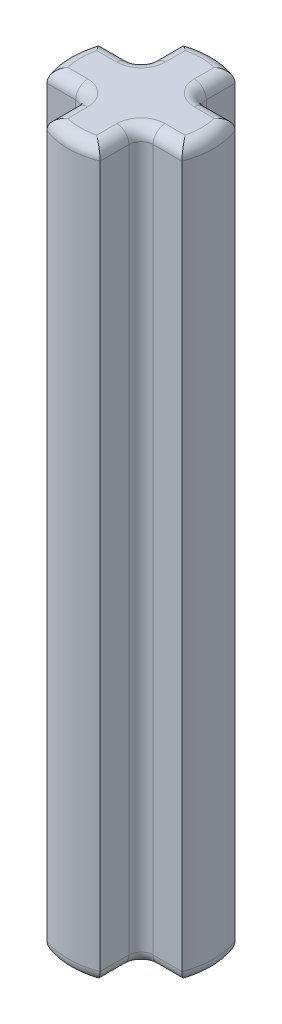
ISO-10303-21;
HEADER;
FILE_DESCRIPTION(('STEP AP214'),'2;1');
FILE_NAME('part.step','',(''),(''),'','','');
FILE_SCHEMA(('AUTOMOTIVE_DESIGN { 1 0 10303 214 1 1 1 1 }'));
ENDSEC;
DATA;
#1=APPLICATION_CONTEXT('core data for automotive mechanical design processes');
#2=APPLICATION_PROTOCOL_DEFINITION('international standard','automotive_design',2000,#1);
#3=PRODUCT_CONTEXT('',#1,'mechanical');
#4=PRODUCT('Part','Part','',(#3));
#5=PRODUCT_RELATED_PRODUCT_CATEGORY('part','',(#4));
#6=PRODUCT_DEFINITION_FORMATION('','',#4);
#7=PRODUCT_DEFINITION_CONTEXT('part definition',#1,'design');
#8=PRODUCT_DEFINITION('design','',#6,#7);
#9=PRODUCT_DEFINITION_SHAPE('','',#8);
#10=(LENGTH_UNIT() NAMED_UNIT(*) SI_UNIT(.MILLI.,.METRE.));
#11=(NAMED_UNIT(*) PLANE_ANGLE_UNIT() SI_UNIT($,.RADIAN.));
#12=(NAMED_UNIT(*) SI_UNIT($,.STERADIAN.) SOLID_ANGLE_UNIT());
#13=UNCERTAINTY_MEASURE_WITH_UNIT(LENGTH_MEASURE(1.E-05),#10,'distance_accuracy_value','');
#14=(GEOMETRIC_REPRESENTATION_CONTEXT(3) GLOBAL_UNCERTAINTY_ASSIGNED_CONTEXT((#13)) GLOBAL_UNIT_ASSIGNED_CONTEXT((#10,
#11,#12)) REPRESENTATION_CONTEXT('',''));
#15=CARTESIAN_POINT('',(0.,0.,0.));
#16=DIRECTION('',(0.,0.,1.));
#17=DIRECTION('',(1.,0.,0.));
#18=AXIS2_PLACEMENT_3D('',#15,#16,#17);
#19=CARTESIAN_POINT('',(0.,0.400000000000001,0.));
#20=DIRECTION('',(0.,1.,0.));
#21=DIRECTION('',(0.,0.,1.));
#22=AXIS2_PLACEMENT_3D('',#19,#20,#21);
#23=TOROIDAL_SURFACE('',#22,2.,0.4);
#24=CARTESIAN_POINT('',(1.94154577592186,0.,-0.48));
#25=CARTESIAN_POINT('',(1.94668411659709,-3.33086131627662E-08,-0.486567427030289));
#26=CARTESIAN_POINT('',(1.95181469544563,0.000161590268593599,-0.49314116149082));
#27=CARTESIAN_POINT('',(1.96197377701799,0.000807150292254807,-0.506195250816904));
#28=CARTESIAN_POINT('',(1.96700266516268,0.00128627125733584,-0.512675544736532));
#29=CARTESIAN_POINT('',(1.97694817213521,0.00255588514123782,-0.525532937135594));
#30=CARTESIAN_POINT('',(1.98186533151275,0.00334150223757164,-0.531910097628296));
#31=CARTESIAN_POINT('',(1.99157831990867,0.00521256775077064,-0.544551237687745));
#32=CARTESIAN_POINT('',(1.99637483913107,0.00629308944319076,-0.550815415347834));
#33=CARTESIAN_POINT('',(2.00583854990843,0.00874196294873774,-0.563220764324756));
#34=CARTESIAN_POINT('',(2.01050657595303,0.0101053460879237,-0.569362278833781));
#35=CARTESIAN_POINT('',(2.01970635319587,0.0131075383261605,-0.581512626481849));
#36=CARTESIAN_POINT('',(2.02423907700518,0.0147413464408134,-0.587521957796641));
#37=CARTESIAN_POINT('',(2.03316231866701,0.0182716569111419,-0.599398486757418));
#38=CARTESIAN_POINT('',(2.03755394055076,0.0201631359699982,-0.605266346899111));
#39=CARTESIAN_POINT('',(2.04619002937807,0.0241957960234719,-0.61685074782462));
#40=CARTESIAN_POINT('',(2.05043572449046,0.0263319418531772,-0.622568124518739));
#41=CARTESIAN_POINT('',(2.05877595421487,0.0308407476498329,-0.633842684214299));
#42=CARTESIAN_POINT('',(2.06287183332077,0.0332083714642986,-0.639400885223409));
#43=CARTESIAN_POINT('',(2.07090932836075,0.0381668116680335,-0.650348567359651));
#44=CARTESIAN_POINT('',(2.07485239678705,0.0407526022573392,-0.655739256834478));
#45=CARTESIAN_POINT('',(2.08258202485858,0.0461339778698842,-0.666343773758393));
#46=CARTESIAN_POINT('',(2.08637013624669,0.0489245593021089,-0.67155900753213));
#47=CARTESIAN_POINT('',(2.09378842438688,0.0547020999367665,-0.681804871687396));
#48=CARTESIAN_POINT('',(2.09742024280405,0.0576840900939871,-0.686837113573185));
#49=CARTESIAN_POINT('',(2.10452526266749,0.0638310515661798,-0.696709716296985));
#50=CARTESIAN_POINT('',(2.10800018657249,0.066991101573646,-0.701551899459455));
#51=CARTESIAN_POINT('',(2.11479153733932,0.0734808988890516,-0.711037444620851));
#52=CARTESIAN_POINT('',(2.11810975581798,0.0768057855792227,-0.715682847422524));
#53=CARTESIAN_POINT('',(2.12458818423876,0.0836119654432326,-0.724768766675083));
#54=CARTESIAN_POINT('',(2.12775025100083,0.087088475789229,-0.729211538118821));
#55=CARTESIAN_POINT('',(2.13391857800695,0.0941852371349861,-0.737885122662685));
#56=CARTESIAN_POINT('',(2.13692672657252,0.0978007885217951,-0.742118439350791));
#57=CARTESIAN_POINT('',(2.14362645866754,0.106217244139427,-0.751555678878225));
#58=CARTESIAN_POINT('',(2.14729074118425,0.111080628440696,-0.756723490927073));
#59=CARTESIAN_POINT('',(2.15440673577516,0.121071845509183,-0.766781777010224));
#60=CARTESIAN_POINT('',(2.15786060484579,0.126195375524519,-0.771674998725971));
#61=CARTESIAN_POINT('',(2.16455057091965,0.136691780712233,-0.781171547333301));
#62=CARTESIAN_POINT('',(2.16778890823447,0.142060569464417,-0.785777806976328));
#63=CARTESIAN_POINT('',(2.17404168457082,0.153030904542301,-0.794689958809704));
#64=CARTESIAN_POINT('',(2.17705844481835,0.15862862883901,-0.798998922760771));
#65=CARTESIAN_POINT('',(2.18286298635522,0.170039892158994,-0.80730629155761));
#66=CARTESIAN_POINT('',(2.18565313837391,0.175849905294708,-0.811307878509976));
#67=CARTESIAN_POINT('',(2.19099992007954,0.187668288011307,-0.81899115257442));
#68=CARTESIAN_POINT('',(2.19355894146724,0.19367345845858,-0.822676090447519));
#69=CARTESIAN_POINT('',(2.19843951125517,0.205864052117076,-0.829717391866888));
#70=CARTESIAN_POINT('',(2.20076343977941,0.212046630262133,-0.833077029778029));
#71=CARTESIAN_POINT('',(2.20517068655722,0.224574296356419,-0.839460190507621));
#72=CARTESIAN_POINT('',(2.20725633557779,0.230916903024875,-0.842486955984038));
#73=CARTESIAN_POINT('',(2.21020935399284,0.240561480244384,-0.846780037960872));
#74=CARTESIAN_POINT('',(2.21116113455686,0.243785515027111,-0.848165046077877));
#75=CARTESIAN_POINT('',(2.21300388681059,0.250266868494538,-0.85084894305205));
#76=CARTESIAN_POINT('',(2.21389513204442,0.253523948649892,-0.852148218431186));
#77=CARTESIAN_POINT('',(2.21561651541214,0.260068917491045,-0.85465985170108));
#78=CARTESIAN_POINT('',(2.21644691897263,0.263356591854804,-0.855872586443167));
#79=CARTESIAN_POINT('',(2.21804641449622,0.269960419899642,-0.858210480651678));
#80=CARTESIAN_POINT('',(2.21881576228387,0.273276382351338,-0.859336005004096));
#81=CARTESIAN_POINT('',(2.22029296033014,0.279934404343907,-0.861498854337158));
#82=CARTESIAN_POINT('',(2.22100105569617,0.283276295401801,-0.862536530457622));
#83=CARTESIAN_POINT('',(2.22235560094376,0.289983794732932,-0.864523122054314));
#84=CARTESIAN_POINT('',(2.22300228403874,0.293349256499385,-0.865472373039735));
#85=CARTESIAN_POINT('',(2.22423388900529,0.300101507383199,-0.867281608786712));
#86=CARTESIAN_POINT('',(2.22481903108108,0.303488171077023,-0.86814191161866));
#87=CARTESIAN_POINT('',(2.22592747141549,0.310280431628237,-0.869772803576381));
#88=CARTESIAN_POINT('',(2.22645097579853,0.313685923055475,-0.870543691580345));
#89=CARTESIAN_POINT('',(2.22743609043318,0.320513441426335,-0.871995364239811));
#90=CARTESIAN_POINT('',(2.22789789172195,0.323935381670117,-0.872676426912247));
#91=CARTESIAN_POINT('',(2.22875958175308,0.330793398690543,-0.873948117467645));
#92=CARTESIAN_POINT('',(2.22915964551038,0.334229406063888,-0.874539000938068));
#93=CARTESIAN_POINT('',(2.22989787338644,0.341113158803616,-0.875630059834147));
#94=CARTESIAN_POINT('',(2.23023619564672,0.344560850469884,-0.876130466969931));
#95=CARTESIAN_POINT('',(2.23085098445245,0.351465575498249,-0.877040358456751));
#96=CARTESIAN_POINT('',(2.23112759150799,0.354922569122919,-0.877450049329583));
#97=CARTESIAN_POINT('',(2.23161902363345,0.361843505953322,-0.878178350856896));
#98=CARTESIAN_POINT('',(2.23183397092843,0.365307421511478,-0.878497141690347));
#99=CARTESIAN_POINT('',(2.23220218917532,0.37223981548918,-0.879043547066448));
#100=CARTESIAN_POINT('',(2.23235556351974,0.375708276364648,-0.879271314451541));
#101=CARTESIAN_POINT('',(2.2326007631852,0.382647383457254,-0.879635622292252));
#102=CARTESIAN_POINT('',(2.23269267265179,0.386118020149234,-0.879772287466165));
#103=CARTESIAN_POINT('',(2.23281512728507,0.393059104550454,-0.879954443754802));
#104=CARTESIAN_POINT('',(2.23284573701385,0.396529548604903,-0.880000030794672));
#105=CARTESIAN_POINT('',(2.23284571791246,0.400000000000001,-0.88));
#106=B_SPLINE_CURVE_WITH_KNOTS('',3,(#24,#25,#26,#27,#28,#29,#30,#31,#32,#33,#34,#35,#36,#37,
#38,#39,#40,#41,#42,#43,#44,#45,#46,#47,#48,#49,#50,#51,#52,#53,#54,#55,#56,#57,#58,#59,#60,#61,
#62,#63,#64,#65,#66,#67,#68,#69,#70,#71,#72,#73,#74,#75,#76,#77,#78,#79,#80,#81,#82,#83,#84,#85,
#86,#87,#88,#89,#90,#91,#92,#93,#94,#95,#96,#97,#98,#99,#100,#101,#102,#103,#104,#105),
.UNSPECIFIED.,.F.,.F.,(4,2,2,2,2,2,2,2,2,2,2,2,2,2,2,2,2,2,2,2,2,2,2,2,2,2,2,2,2,2,2,2,2,2,2,2,
2,2,2,2,4),(0.,0.0250147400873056,0.0496585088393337,0.0739252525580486,0.0978090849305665,
0.121304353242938,0.144405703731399,0.167108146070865,0.189407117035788,0.211298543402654,
0.23277890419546,0.253845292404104,0.274495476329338,0.294727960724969,0.314542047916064,
0.333937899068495,0.352916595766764,0.37686493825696,0.400499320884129,0.423827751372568,
0.446859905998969,0.469607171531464,0.49208266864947,0.514301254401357,0.536279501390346,
0.547185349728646,0.558038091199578,0.56884025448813,0.579594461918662,0.590303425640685,
0.60096994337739,0.611596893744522,0.62218723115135,0.632743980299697,0.643270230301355,
0.653769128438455,0.664243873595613,0.674697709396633,0.685133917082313,0.695555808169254,
0.705966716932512),.UNSPECIFIED.);
#107=CARTESIAN_POINT('',(1.94154577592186,0.,-0.48));
#108=VERTEX_POINT('',#107);
#109=CARTESIAN_POINT('',(2.23284571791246,0.400000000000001,-0.88));
#110=VERTEX_POINT('',#109);
#111=EDGE_CURVE('E246',#108,#110,#106,.T.);
#112=ORIENTED_EDGE('',*,*,#111,.T.);
#113=CARTESIAN_POINT('',(0.,0.400000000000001,0.));
#114=DIRECTION('',(0.,-1.,0.));
#115=DIRECTION('',(0.,0.,-1.));
#116=AXIS2_PLACEMENT_3D('',#113,#114,#115);
#117=CIRCLE('',#116,2.4);
#118=CARTESIAN_POINT('',(2.23284571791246,0.400000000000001,0.880000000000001));
#119=VERTEX_POINT('',#118);
#120=EDGE_CURVE('E262',#119,#110,#117,.F.);
#121=ORIENTED_EDGE('',*,*,#120,.F.);
#122=CARTESIAN_POINT('',(2.23284571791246,0.400000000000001,0.880000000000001));
#123=CARTESIAN_POINT('',(2.23284573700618,0.396530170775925,0.880000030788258));
#124=CARTESIAN_POINT('',(2.23281514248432,0.393060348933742,0.879954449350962));
#125=CARTESIAN_POINT('',(2.23269274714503,0.386120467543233,0.879772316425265));
#126=CARTESIAN_POINT('',(2.2326008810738,0.382650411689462,0.879635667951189));
#127=CARTESIAN_POINT('',(2.232355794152,0.375712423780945,0.87927140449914));
#128=CARTESIAN_POINT('',(2.2322024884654,0.372244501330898,0.879043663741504));
#129=CARTESIAN_POINT('',(2.23183443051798,0.365313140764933,0.878497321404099));
#130=CARTESIAN_POINT('',(2.23161957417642,0.361849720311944,0.878178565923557));
#131=CARTESIAN_POINT('',(2.23112834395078,0.354929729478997,0.877450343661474));
#132=CARTESIAN_POINT('',(2.23085184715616,0.351473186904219,0.877040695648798));
#133=CARTESIAN_POINT('',(2.23023729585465,0.344569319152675,0.876130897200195));
#134=CARTESIAN_POINT('',(2.22989910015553,0.341122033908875,0.875630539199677));
#135=CARTESIAN_POINT('',(2.22916113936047,0.334239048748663,0.874539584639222));
#136=CARTESIAN_POINT('',(2.22876121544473,0.330803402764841,0.873948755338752));
#137=CARTESIAN_POINT('',(2.22789981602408,0.323946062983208,0.87267717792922));
#138=CARTESIAN_POINT('',(2.22743816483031,0.320524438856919,0.871996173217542));
#139=CARTESIAN_POINT('',(2.22645335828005,0.313697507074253,0.870544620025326));
#140=CARTESIAN_POINT('',(2.22593001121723,0.310292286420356,0.86977379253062));
#141=CARTESIAN_POINT('',(2.22482189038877,0.303500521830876,0.868143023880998));
#142=CARTESIAN_POINT('',(2.22423690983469,0.300114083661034,0.867282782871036));
#143=CARTESIAN_POINT('',(2.22300562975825,0.293362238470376,0.86547367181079));
#144=CARTESIAN_POINT('',(2.22235910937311,0.289996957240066,0.86452448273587));
#145=CARTESIAN_POINT('',(2.2210048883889,0.283289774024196,0.862538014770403));
#146=CARTESIAN_POINT('',(2.2202969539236,0.279948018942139,0.86150039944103));
#147=CARTESIAN_POINT('',(2.21882007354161,0.273290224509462,0.859337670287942));
#148=CARTESIAN_POINT('',(2.2180508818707,0.269974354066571,0.858212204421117));
#149=CARTESIAN_POINT('',(2.21645169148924,0.263370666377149,0.855874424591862));
#150=CARTESIAN_POINT('',(2.21562143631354,0.260083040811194,0.854661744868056));
#151=CARTESIAN_POINT('',(2.21390033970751,0.253538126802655,0.852150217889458));
#152=CARTESIAN_POINT('',(2.21300923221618,0.250281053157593,0.850850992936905));
#153=CARTESIAN_POINT('',(2.21116674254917,0.243799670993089,0.848167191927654));
#154=CARTESIAN_POINT('',(2.21021508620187,0.24057560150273,0.846782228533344));
#155=CARTESIAN_POINT('',(2.20726240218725,0.230930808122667,0.842489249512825));
#156=CARTESIAN_POINT('',(2.20517695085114,0.224588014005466,0.83946255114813));
#157=CARTESIAN_POINT('',(2.20077001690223,0.212059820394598,0.833079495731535));
#158=CARTESIAN_POINT('',(2.19844619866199,0.205876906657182,0.829719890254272));
#159=CARTESIAN_POINT('',(2.1935657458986,0.193685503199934,0.822678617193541));
#160=CARTESIAN_POINT('',(2.1910067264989,0.187679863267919,0.818993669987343));
#161=CARTESIAN_POINT('',(2.18565982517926,0.17586041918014,0.811310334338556));
#162=CARTESIAN_POINT('',(2.18286954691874,0.170049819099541,0.807308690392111));
#163=CARTESIAN_POINT('',(2.17706461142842,0.158637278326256,0.799001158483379));
#164=CARTESIAN_POINT('',(2.17404757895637,0.153038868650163,0.794692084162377));
#165=CARTESIAN_POINT('',(2.16779409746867,0.142067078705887,0.78577966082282));
#166=CARTESIAN_POINT('',(2.16455532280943,0.136697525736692,0.781173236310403));
#167=CARTESIAN_POINT('',(2.15786431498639,0.126199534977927,0.77167629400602));
#168=CARTESIAN_POINT('',(2.15440983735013,0.121075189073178,0.766782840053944));
#169=CARTESIAN_POINT('',(2.14729241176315,0.111082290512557,0.756724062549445));
#170=CARTESIAN_POINT('',(2.14362730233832,0.106218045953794,0.751555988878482));
#171=CARTESIAN_POINT('',(2.13692730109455,0.0978017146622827,0.742119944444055));
#172=CARTESIAN_POINT('',(2.13391975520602,0.0941870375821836,0.737888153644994));
#173=CARTESIAN_POINT('',(2.12775265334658,0.0870918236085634,0.729217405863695));
#174=CARTESIAN_POINT('',(2.12459120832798,0.0836159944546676,0.724775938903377));
#175=CARTESIAN_POINT('',(2.11811399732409,0.0768109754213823,0.715692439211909));
#176=CARTESIAN_POINT('',(2.11479637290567,0.0734865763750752,0.711048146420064));
#177=CARTESIAN_POINT('',(2.10800617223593,0.0669975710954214,0.701564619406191));
#178=CARTESIAN_POINT('',(2.1045318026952,0.0638378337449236,0.696723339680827));
#179=CARTESIAN_POINT('',(2.09742783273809,0.0576913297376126,0.686852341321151));
#180=CARTESIAN_POINT('',(2.09379650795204,0.0547094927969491,0.681820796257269));
#181=CARTESIAN_POINT('',(2.08637913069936,0.0489321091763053,0.67157612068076));
#182=CARTESIAN_POINT('',(2.08259143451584,0.0461415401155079,0.666361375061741));
#183=CARTESIAN_POINT('',(2.07486254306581,0.0407600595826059,0.655757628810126));
#184=CARTESIAN_POINT('',(2.07091979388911,0.0381741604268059,0.650367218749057));
#185=CARTESIAN_POINT('',(2.06288282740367,0.033215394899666,0.639419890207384));
#186=CARTESIAN_POINT('',(2.05878715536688,0.0308475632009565,0.633861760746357));
#187=CARTESIAN_POINT('',(2.05044721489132,0.0263382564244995,0.622587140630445));
#188=CARTESIAN_POINT('',(2.04620159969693,0.0242018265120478,0.616869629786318));
#189=CARTESIAN_POINT('',(2.03756553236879,0.0201685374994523,0.605284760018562));
#190=CARTESIAN_POINT('',(2.03317384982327,0.0182767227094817,0.599416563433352));
#191=CARTESIAN_POINT('',(2.02425033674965,0.0147457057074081,0.587539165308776));
#192=CARTESIAN_POINT('',(2.01971740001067,0.0131115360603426,0.581529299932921));
#193=CARTESIAN_POINT('',(2.01051703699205,0.0101086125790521,0.569377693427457));
#194=CARTESIAN_POINT('',(2.00584863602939,0.00874486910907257,0.56323545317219));
#195=CARTESIAN_POINT('',(1.99638400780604,0.00629529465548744,0.550828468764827));
#196=CARTESIAN_POINT('',(1.99158694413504,0.00521444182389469,0.544563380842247));
#197=CARTESIAN_POINT('',(1.98187269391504,0.00334276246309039,0.531920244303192));
#198=CARTESIAN_POINT('',(1.97695481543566,0.00255687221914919,0.525541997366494));
#199=CARTESIAN_POINT('',(1.9670076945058,0.0012867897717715,0.512682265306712));
#200=CARTESIAN_POINT('',(1.96197791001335,0.000807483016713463,0.506200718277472));
#201=CARTESIAN_POINT('',(1.95181686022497,0.000161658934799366,0.493143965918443));
#202=CARTESIAN_POINT('',(1.94668520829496,-3.32388613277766E-08,0.486568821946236));
#203=CARTESIAN_POINT('',(1.94154577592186,0.,0.480000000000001));
#204=B_SPLINE_CURVE_WITH_KNOTS('',3,(#122,#123,#124,#125,#126,#127,#128,#129,#130,#131,#132,
#133,#134,#135,#136,#137,#138,#139,#140,#141,#142,#143,#144,#145,#146,#147,#148,#149,#150,#151,
#152,#153,#154,#155,#156,#157,#158,#159,#160,#161,#162,#163,#164,#165,#166,#167,#168,#169,#170,
#171,#172,#173,#174,#175,#176,#177,#178,#179,#180,#181,#182,#183,#184,#185,#186,#187,#188,#189,
#190,#191,#192,#193,#194,#195,#196,#197,#198,#199,#200,#201,#202,#203),.UNSPECIFIED.,.F.,.F.,(4,
2,2,2,2,2,2,2,2,2,2,2,2,2,2,2,2,2,2,2,2,2,2,2,2,2,2,2,2,2,2,2,2,2,2,2,2,2,2,2,4),(0.,
0.0104090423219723,0.0208291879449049,0.0312637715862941,0.0417161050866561,0.0521894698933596,
0.0626871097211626,0.0732122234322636,0.0837679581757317,0.0943574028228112,0.10498358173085,
0.115649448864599,0.126357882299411,0.137111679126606,0.147913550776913,0.15876611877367,
0.169671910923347,0.191650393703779,0.213869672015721,0.236346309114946,0.259095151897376,
0.282129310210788,0.305460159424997,0.329097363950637,0.353048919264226,0.372022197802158,
0.391413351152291,0.411223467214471,0.431452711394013,0.452100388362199,0.4731650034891,
0.494644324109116,0.516535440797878,0.538834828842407,0.561538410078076,0.5846416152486,
0.608139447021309,0.632026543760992,0.656297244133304,0.680945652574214,0.705965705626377),.UNSPECIFIED.);
#205=CARTESIAN_POINT('',(1.94154577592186,0.,0.480000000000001));
#206=VERTEX_POINT('',#205);
#207=EDGE_CURVE('E247',#119,#206,#204,.T.);
#208=ORIENTED_EDGE('',*,*,#207,.T.);
#209=CARTESIAN_POINT('',(0.,0.,0.));
#210=DIRECTION('',(0.,1.,0.));
#211=DIRECTION('',(0.970772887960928,0.,0.24));
#212=AXIS2_PLACEMENT_3D('',#209,#210,#211);
#213=CIRCLE('',#212,2.);
#214=EDGE_CURVE('E234',#206,#108,#213,.T.);
#215=ORIENTED_EDGE('',*,*,#214,.T.);
#216=EDGE_LOOP('',(#112,#121,#208,#215));
#217=FACE_BOUND('',#216,.T.);
#218=ADVANCED_FACE('F16',(#217),#23,.T.);
#219=CARTESIAN_POINT('',(0.,23.6,0.));
#220=DIRECTION('',(0.,1.,0.));
#221=DIRECTION('',(0.,0.,1.));
#222=AXIS2_PLACEMENT_3D('',#219,#220,#221);
#223=TOROIDAL_SURFACE('',#222,2.,0.4);
#224=CARTESIAN_POINT('',(2.23284571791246,23.6,-0.88));
#225=CARTESIAN_POINT('',(2.23284573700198,23.6034696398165,-0.880000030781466));
#226=CARTESIAN_POINT('',(2.23281514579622,23.6069392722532,-0.879954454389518));
#227=CARTESIAN_POINT('',(2.23269276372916,23.613878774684,-0.879772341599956));
#228=CARTESIAN_POINT('',(2.23260090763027,23.6173486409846,-0.879635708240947));
#229=CARTESIAN_POINT('',(2.23235584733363,23.6242862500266,-0.879271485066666));
#230=CARTESIAN_POINT('',(2.2322025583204,23.6277539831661,-0.879043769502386));
#231=CARTESIAN_POINT('',(2.23183454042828,23.6346849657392,-0.878497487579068));
#232=CARTESIAN_POINT('',(2.23161970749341,23.638148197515,-0.878178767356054));
#233=CARTESIAN_POINT('',(2.23112853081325,23.6450678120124,-0.877450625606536));
#234=CARTESIAN_POINT('',(2.23085206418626,23.6485241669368,-0.877041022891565));
#235=CARTESIAN_POINT('',(2.23023757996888,23.6554276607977,-0.876131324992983));
#236=CARTESIAN_POINT('',(2.229899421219,23.6588747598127,-0.875631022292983));
#237=CARTESIAN_POINT('',(2.22916154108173,23.6657573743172,-0.874540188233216));
#238=CARTESIAN_POINT('',(2.22876166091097,23.6691928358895,-0.873949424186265));
#239=CARTESIAN_POINT('',(2.22790035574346,23.6760498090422,-0.872677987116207));
#240=CARTESIAN_POINT('',(2.2274387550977,23.6794712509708,-0.871997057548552));
#241=CARTESIAN_POINT('',(2.22645405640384,23.686297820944,-0.870545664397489));
#242=CARTESIAN_POINT('',(2.22593076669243,23.6897028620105,-0.86977492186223));
#243=CARTESIAN_POINT('',(2.22482276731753,23.6964942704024,-0.868144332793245));
#244=CARTESIAN_POINT('',(2.22423785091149,23.6998805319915,-0.867284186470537));
#245=CARTESIAN_POINT('',(2.22300670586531,23.7066320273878,-0.865475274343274));
#246=CARTESIAN_POINT('',(2.22236025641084,23.7099971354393,-0.864526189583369));
#247=CARTESIAN_POINT('',(2.22100618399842,23.7167039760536,-0.86253993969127));
#248=CARTESIAN_POINT('',(2.22029832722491,23.7200455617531,-0.861502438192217));
#249=CARTESIAN_POINT('',(2.21882160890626,23.726703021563,-0.85933994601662));
#250=CARTESIAN_POINT('',(2.21805250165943,23.7300187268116,-0.858214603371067));
#251=CARTESIAN_POINT('',(2.21645348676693,23.7366220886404,-0.855877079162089));
#252=CARTESIAN_POINT('',(2.21562332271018,23.7399095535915,-0.854664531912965));
#253=CARTESIAN_POINT('',(2.21390241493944,23.7464541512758,-0.852153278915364));
#254=CARTESIAN_POINT('',(2.21301140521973,23.7497110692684,-0.850854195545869));
#255=CARTESIAN_POINT('',(2.21116911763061,23.7561921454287,-0.848170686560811));
#256=CARTESIAN_POINT('',(2.21021756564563,23.7594160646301,-0.846785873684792));
#257=CARTESIAN_POINT('',(2.20726520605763,23.7690604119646,-0.842493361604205));
#258=CARTESIAN_POINT('',(2.20517998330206,23.775402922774,-0.839466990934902));
#259=CARTESIAN_POINT('',(2.20077353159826,23.7879305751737,-0.833084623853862));
#260=CARTESIAN_POINT('',(2.1984499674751,23.7941132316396,-0.829725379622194));
#261=CARTESIAN_POINT('',(2.19357004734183,23.8063041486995,-0.822684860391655));
#262=CARTESIAN_POINT('',(2.19101130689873,23.8123095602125,-0.8190003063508));
#263=CARTESIAN_POINT('',(2.18566498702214,23.8241285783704,-0.811317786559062));
#264=CARTESIAN_POINT('',(2.18287501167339,23.8299389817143,-0.80731656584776));
#265=CARTESIAN_POINT('',(2.17707070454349,23.8413511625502,-0.799009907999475));
#266=CARTESIAN_POINT('',(2.17405399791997,23.8469494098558,-0.794701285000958));
#267=CARTESIAN_POINT('',(2.16780118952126,23.8579209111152,-0.785789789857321));
#268=CARTESIAN_POINT('',(2.16456276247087,23.8632903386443,-0.781183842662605));
#269=CARTESIAN_POINT('',(2.15787246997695,23.8737881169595,-0.771687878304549));
#270=CARTESIAN_POINT('',(2.15441836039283,23.8789123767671,-0.766794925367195));
#271=CARTESIAN_POINT('',(2.1473016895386,23.8889051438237,-0.756737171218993));
#272=CARTESIAN_POINT('',(2.14363696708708,23.8937693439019,-0.751569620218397));
#273=CARTESIAN_POINT('',(2.13693730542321,23.902186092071,-0.742134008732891));
#274=CARTESIAN_POINT('',(2.13392969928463,23.9058011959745,-0.737902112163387));
#275=CARTESIAN_POINT('',(2.1277624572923,23.9128972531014,-0.729231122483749));
#276=CARTESIAN_POINT('',(2.12460093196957,23.9163734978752,-0.724789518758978));
#277=CARTESIAN_POINT('',(2.11812354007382,23.9231793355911,-0.715705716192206));
#278=CARTESIAN_POINT('',(2.11480581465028,23.9265041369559,-0.711061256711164));
#279=CARTESIAN_POINT('',(2.1080153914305,23.9329939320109,-0.701577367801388));
#280=CARTESIAN_POINT('',(2.10454089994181,23.9361540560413,-0.696735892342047));
#281=CARTESIAN_POINT('',(2.0974366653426,23.9423013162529,-0.686864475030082));
#282=CARTESIAN_POINT('',(2.09380519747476,23.9452835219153,-0.681832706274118));
#283=CARTESIAN_POINT('',(2.08638751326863,23.9510616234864,-0.671587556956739));
#284=CARTESIAN_POINT('',(2.08259965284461,23.9538525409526,-0.666372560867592));
#285=CARTESIAN_POINT('',(2.07487041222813,23.9592346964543,-0.655768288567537));
#286=CARTESIAN_POINT('',(2.07092747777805,23.9618209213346,-0.6503776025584));
#287=CARTESIAN_POINT('',(2.06289012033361,23.9667803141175,-0.639429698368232));
#288=CARTESIAN_POINT('',(2.0587942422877,23.9691484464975,-0.633871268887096));
#289=CARTESIAN_POINT('',(2.05045386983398,23.9736583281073,-0.622596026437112));
#290=CARTESIAN_POINT('',(2.04620802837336,23.9757950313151,-0.616878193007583));
#291=CARTESIAN_POINT('',(2.03757148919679,23.9798288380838,-0.605292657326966));
#292=CARTESIAN_POINT('',(2.03317956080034,23.9817208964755,-0.599424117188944));
#293=CARTESIAN_POINT('',(2.02425553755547,23.9852523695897,-0.587546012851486));
#294=CARTESIAN_POINT('',(2.01972233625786,23.9868867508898,-0.581535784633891));
#295=CARTESIAN_POINT('',(2.01052142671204,23.9898900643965,-0.569383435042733));
#296=CARTESIAN_POINT('',(2.00585274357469,23.9912539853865,-0.563240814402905));
#297=CARTESIAN_POINT('',(1.99638753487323,23.993703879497,-0.550833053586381));
#298=CARTESIAN_POINT('',(1.99159017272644,23.9947848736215,-0.544567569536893));
#299=CARTESIAN_POINT('',(1.98187531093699,23.9966567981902,-0.531923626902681));
#300=CARTESIAN_POINT('',(1.97695711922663,23.9974427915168,-0.525544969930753));
#301=CARTESIAN_POINT('',(1.96700935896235,23.9987130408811,-0.512684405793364));
#302=CARTESIAN_POINT('',(1.96197924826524,23.9991924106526,-0.506202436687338));
#303=CARTESIAN_POINT('',(1.95181753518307,23.9998383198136,-0.493144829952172));
#304=CARTESIAN_POINT('',(1.9466855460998,24.0000000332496,-0.48656925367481));
#305=CARTESIAN_POINT('',(1.94154577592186,24.,-0.48));
#306=B_SPLINE_CURVE_WITH_KNOTS('',3,(#224,#225,#226,#227,#228,#229,#230,#231,#232,#233,#234,
#235,#236,#237,#238,#239,#240,#241,#242,#243,#244,#245,#246,#247,#248,#249,#250,#251,#252,#253,
#254,#255,#256,#257,#258,#259,#260,#261,#262,#263,#264,#265,#266,#267,#268,#269,#270,#271,#272,
#273,#274,#275,#276,#277,#278,#279,#280,#281,#282,#283,#284,#285,#286,#287,#288,#289,#290,#291,
#292,#293,#294,#295,#296,#297,#298,#299,#300,#301,#302,#303,#304,#305),.UNSPECIFIED.,.F.,.F.,(4,
2,2,2,2,2,2,2,2,2,2,2,2,2,2,2,2,2,2,2,2,2,2,2,2,2,2,2,2,2,2,2,2,2,2,2,2,2,2,2,4),(0.,
0.0104084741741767,0.0208280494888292,0.0312620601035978,0.0417138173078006,0.0521866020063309,
0.0626836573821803,0.0732081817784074,0.0837633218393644,0.0943521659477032,0.104977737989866,
0.115642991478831,0.126350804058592,0.137103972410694,0.147905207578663,0.158757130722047,
0.169662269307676,0.191639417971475,0.213857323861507,0.236332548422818,0.259079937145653,
0.282112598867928,0.305441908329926,0.329077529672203,0.353027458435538,0.372001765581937,
0.391393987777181,0.41120521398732,0.431435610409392,0.452084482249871,0.473150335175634,
0.494630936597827,0.516523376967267,0.538824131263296,0.561529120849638,0.584633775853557,
0.608133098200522,0.632021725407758,0.656293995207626,0.680944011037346,0.705965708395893),.UNSPECIFIED.);
#307=CARTESIAN_POINT('',(2.23284571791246,23.6,-0.88));
#308=VERTEX_POINT('',#307);
#309=CARTESIAN_POINT('',(1.94154577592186,24.,-0.48));
#310=VERTEX_POINT('',#309);
#311=EDGE_CURVE('E325',#308,#310,#306,.T.);
#312=ORIENTED_EDGE('',*,*,#311,.T.);
#313=CARTESIAN_POINT('',(0.,24.,0.));
#314=DIRECTION('',(0.,-1.,0.));
#315=DIRECTION('',(0.970772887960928,0.,-0.24));
#316=AXIS2_PLACEMENT_3D('',#313,#314,#315);
#317=CIRCLE('',#316,2.);
#318=CARTESIAN_POINT('',(1.94154577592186,24.,0.480000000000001));
#319=VERTEX_POINT('',#318);
#320=EDGE_CURVE('E289',#310,#319,#317,.T.);
#321=ORIENTED_EDGE('',*,*,#320,.T.);
#322=CARTESIAN_POINT('',(1.94154577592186,24.,0.480000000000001));
#323=CARTESIAN_POINT('',(1.94668445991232,24.000000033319,0.486567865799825));
#324=CARTESIAN_POINT('',(1.95181538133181,23.9998383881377,0.493142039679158));
#325=CARTESIAN_POINT('',(1.96197513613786,23.9991927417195,0.506196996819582));
#326=CARTESIAN_POINT('',(1.96700435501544,23.9987135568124,0.512677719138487));
#327=CARTESIAN_POINT('',(1.97695050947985,23.997443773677,0.525535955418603));
#328=CARTESIAN_POINT('',(1.98186798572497,23.996658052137,0.531913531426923));
#329=CARTESIAN_POINT('',(1.99158159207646,23.9947867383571,0.544555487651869));
#330=CARTESIAN_POINT('',(1.9963784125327,23.9937060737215,0.550820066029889));
#331=CARTESIAN_POINT('',(2.00584270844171,23.9912568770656,0.563226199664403));
#332=CARTESIAN_POINT('',(2.01051101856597,23.9898933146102,0.569368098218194));
#333=CARTESIAN_POINT('',(2.01971134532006,23.9868907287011,0.58151919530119));
#334=CARTESIAN_POINT('',(2.0242443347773,23.9852567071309,0.587528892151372));
#335=CARTESIAN_POINT('',(2.03316808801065,23.9817259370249,0.599406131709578));
#336=CARTESIAN_POINT('',(2.03755995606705,23.9798342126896,0.605274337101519));
#337=CARTESIAN_POINT('',(2.04619651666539,23.975801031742,0.616859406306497));
#338=CARTESIAN_POINT('',(2.05044243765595,23.973664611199,0.62257710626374));
#339=CARTESIAN_POINT('',(2.05878309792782,23.9691552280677,0.633852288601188));
#340=CARTESIAN_POINT('',(2.06287918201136,23.9667873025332,0.639410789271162));
#341=CARTESIAN_POINT('',(2.07091706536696,23.961828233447,0.650359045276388));
#342=CARTESIAN_POINT('',(2.07486031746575,23.9592421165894,0.655750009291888));
#343=CARTESIAN_POINT('',(2.08259029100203,23.9538600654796,0.666355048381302));
#344=CARTESIAN_POINT('',(2.08637856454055,23.9510691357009,0.671570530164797));
#345=CARTESIAN_POINT('',(2.09379715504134,23.9452908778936,0.681816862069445));
#346=CARTESIAN_POINT('',(2.09742911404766,23.9423085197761,0.686849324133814));
#347=CARTESIAN_POINT('',(2.10453439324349,23.9361608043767,0.696722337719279));
#348=CARTESIAN_POINT('',(2.10800943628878,23.9330003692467,0.701564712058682));
#349=CARTESIAN_POINT('',(2.11480100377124,23.9265097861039,0.711050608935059));
#350=CARTESIAN_POINT('',(2.11811932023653,23.9231844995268,0.715696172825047));
#351=CARTESIAN_POINT('',(2.12459792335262,23.916377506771,0.724782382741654));
#352=CARTESIAN_POINT('',(2.12776006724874,23.9129005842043,0.729225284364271));
#353=CARTESIAN_POINT('',(2.13392852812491,23.90580298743,0.73789909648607));
#354=CARTESIAN_POINT('',(2.13693673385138,23.902187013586,0.742132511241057));
#355=CARTESIAN_POINT('',(2.14363612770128,23.8937701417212,0.751569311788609));
#356=CARTESIAN_POINT('',(2.14730002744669,23.8889067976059,0.756736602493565));
#357=CARTESIAN_POINT('',(2.15441527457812,23.8789157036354,0.766793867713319));
#358=CARTESIAN_POINT('',(2.15786877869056,23.8737922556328,0.771686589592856));
#359=CARTESIAN_POINT('',(2.16455803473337,23.8632960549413,0.781182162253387));
#360=CARTESIAN_POINT('',(2.16779602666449,23.857927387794,0.785787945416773));
#361=CARTESIAN_POINT('',(2.17404813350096,23.8469573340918,0.794699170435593));
#362=CARTESIAN_POINT('',(2.17706456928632,23.8413597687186,0.79900768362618));
#363=CARTESIAN_POINT('',(2.1828684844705,23.8299488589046,0.807314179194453));
#364=CARTESIAN_POINT('',(2.1856583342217,23.8241390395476,0.811315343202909));
#365=CARTESIAN_POINT('',(2.19100453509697,23.8123210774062,0.818997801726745));
#366=CARTESIAN_POINT('',(2.19356327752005,23.8063161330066,0.822682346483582));
#367=CARTESIAN_POINT('',(2.19844331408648,23.7941260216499,0.829722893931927));
#368=CARTESIAN_POINT('',(2.20076698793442,23.7879436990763,0.833082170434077));
#369=CARTESIAN_POINT('',(2.20517375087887,23.7754165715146,0.839464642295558));
#370=CARTESIAN_POINT('',(2.20725917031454,23.7690742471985,0.84249107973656));
#371=CARTESIAN_POINT('',(2.21021186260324,23.759430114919,0.846783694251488));
#372=CARTESIAN_POINT('',(2.21116353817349,23.7562062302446,0.848168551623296));
#373=CARTESIAN_POINT('',(2.21300608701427,23.7497251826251,0.850852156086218));
#374=CARTESIAN_POINT('',(2.21389723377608,23.746468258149,0.852151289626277));
#375=CARTESIAN_POINT('',(2.2156184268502,23.7399236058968,0.854662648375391));
#376=CARTESIAN_POINT('',(2.21644873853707,23.736636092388,0.855875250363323));
#377=CARTESIAN_POINT('',(2.21804805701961,23.7300325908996,0.858212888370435));
#378=CARTESIAN_POINT('',(2.21881731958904,23.7267167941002,0.859338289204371));
#379=CARTESIAN_POINT('',(2.22029435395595,23.7200591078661,0.861500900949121));
#380=CARTESIAN_POINT('',(2.2210023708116,23.7167173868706,0.862538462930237));
#381=CARTESIAN_POINT('',(2.22235676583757,23.7100102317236,0.864524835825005));
#382=CARTESIAN_POINT('',(2.223003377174,23.7066449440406,0.865473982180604));
#383=CARTESIAN_POINT('',(2.22423484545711,23.6998930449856,0.867283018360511));
#384=CARTESIAN_POINT('',(2.22481992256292,23.6965065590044,0.868143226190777));
#385=CARTESIAN_POINT('',(2.22592823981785,23.6897146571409,0.869773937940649));
#386=CARTESIAN_POINT('',(2.22645168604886,23.6863093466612,0.870544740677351));
#387=CARTESIAN_POINT('',(2.22743669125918,23.6794821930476,0.87199625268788));
#388=CARTESIAN_POINT('',(2.22789844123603,23.6760604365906,0.872677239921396));
#389=CARTESIAN_POINT('',(2.22876003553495,23.6692027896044,0.873948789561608));
#390=CARTESIAN_POINT('',(2.2291600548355,23.6657669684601,0.874539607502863));
#391=CARTESIAN_POINT('',(2.22989820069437,23.6588835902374,0.875630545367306));
#392=CARTESIAN_POINT('',(2.23023648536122,23.6554360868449,0.876130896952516));
#393=CARTESIAN_POINT('',(2.23085120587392,23.6485317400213,0.87704068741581));
#394=CARTESIAN_POINT('',(2.23112778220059,23.6450749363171,0.877450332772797));
#395=CARTESIAN_POINT('',(2.23161915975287,23.6381543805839,0.878178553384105));
#396=CARTESIAN_POINT('',(2.23183408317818,23.6346906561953,0.878497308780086));
#397=CARTESIAN_POINT('',(2.23220226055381,23.6277586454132,0.879043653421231));
#398=CARTESIAN_POINT('',(2.23235561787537,23.6242903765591,0.879271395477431));
#399=CARTESIAN_POINT('',(2.23260079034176,23.6173516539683,0.879635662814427));
#400=CARTESIAN_POINT('',(2.23269268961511,23.6138812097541,0.879772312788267));
#401=CARTESIAN_POINT('',(2.23281513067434,23.6069405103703,0.879954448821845));
#402=CARTESIAN_POINT('',(2.23284573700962,23.6034702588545,0.880000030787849));
#403=CARTESIAN_POINT('',(2.23284571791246,23.6,0.880000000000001));
#404=B_SPLINE_CURVE_WITH_KNOTS('',3,(#322,#323,#324,#325,#326,#327,#328,#329,#330,#331,#332,
#333,#334,#335,#336,#337,#338,#339,#340,#341,#342,#343,#344,#345,#346,#347,#348,#349,#350,#351,
#352,#353,#354,#355,#356,#357,#358,#359,#360,#361,#362,#363,#364,#365,#366,#367,#368,#369,#370,
#371,#372,#373,#374,#375,#376,#377,#378,#379,#380,#381,#382,#383,#384,#385,#386,#387,#388,#389,
#390,#391,#392,#393,#394,#395,#396,#397,#398,#399,#400,#401,#402,#403),.UNSPECIFIED.,.F.,.F.,(4,
2,2,2,2,2,2,2,2,2,2,2,2,2,2,2,2,2,2,2,2,2,2,2,2,2,2,2,2,2,2,2,2,2,2,2,2,2,2,2,4),(0.,
0.0250164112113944,0.0496618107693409,0.0739301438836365,0.097815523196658,0.121312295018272,
0.144415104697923,0.167118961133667,0.189419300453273,0.21131204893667,0.23279368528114,
0.253861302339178,0.274512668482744,0.29474628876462,0.314561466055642,0.333958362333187,
0.352938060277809,0.376884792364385,0.400517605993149,0.423844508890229,0.446875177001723,
0.469620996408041,0.492095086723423,0.514312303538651,0.536289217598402,0.547194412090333,
0.558046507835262,0.568848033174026,0.579601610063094,0.590309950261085,0.600975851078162,
0.61160219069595,0.622191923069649,0.632748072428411,0.643273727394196,0.653772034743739,
0.664246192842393,0.674699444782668,0.685135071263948,0.695556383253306,0.705966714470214),.UNSPECIFIED.);
#405=CARTESIAN_POINT('',(2.23284571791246,23.6,0.880000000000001));
#406=VERTEX_POINT('',#405);
#407=EDGE_CURVE('E314',#319,#406,#404,.T.);
#408=ORIENTED_EDGE('',*,*,#407,.T.);
#409=CARTESIAN_POINT('',(0.,23.6,0.));
#410=DIRECTION('',(0.,-1.,0.));
#411=DIRECTION('',(0.,0.,-1.));
#412=AXIS2_PLACEMENT_3D('',#409,#410,#411);
#413=CIRCLE('',#412,2.4);
#414=EDGE_CURVE('E336',#308,#406,#413,.T.);
#415=ORIENTED_EDGE('',*,*,#414,.F.);
#416=EDGE_LOOP('',(#312,#321,#408,#415));
#417=FACE_BOUND('',#416,.T.);
#418=ADVANCED_FACE('F293',(#417),#223,.T.);
#419=CARTESIAN_POINT('',(0.880000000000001,24.,-0.88));
#420=DIRECTION('',(0.,0.,1.));
#421=DIRECTION('',(1.,0.,0.));
#422=AXIS2_PLACEMENT_3D('',#419,#420,#421);
#423=PLANE('',#422);
#424=DIRECTION('',(1.,0.,0.));
#425=VECTOR('',#424,1.);
#426=CARTESIAN_POINT('',(0.880000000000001,0.400000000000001,-0.88));
#427=LINE('',#426,#425);
#428=CARTESIAN_POINT('',(1.28,0.400000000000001,-0.88));
#429=VERTEX_POINT('',#428);
#430=EDGE_CURVE('E342',#429,#110,#427,.T.);
#431=ORIENTED_EDGE('',*,*,#430,.F.);
#432=DIRECTION('',(0.,1.,0.));
#433=VECTOR('',#432,1.);
#434=CARTESIAN_POINT('',(1.28,24.,-0.88));
#435=LINE('',#434,#433);
#436=CARTESIAN_POINT('',(1.28,23.6,-0.88));
#437=VERTEX_POINT('',#436);
#438=EDGE_CURVE('E353',#429,#437,#435,.T.);
#439=ORIENTED_EDGE('',*,*,#438,.T.);
#440=DIRECTION('',(1.,0.,0.));
#441=VECTOR('',#440,1.);
#442=CARTESIAN_POINT('',(0.880000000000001,23.6,-0.88));
#443=LINE('',#442,#441);
#444=EDGE_CURVE('E344',#308,#437,#443,.F.);
#445=ORIENTED_EDGE('',*,*,#444,.F.);
#446=DIRECTION('',(0.,-1.,0.));
#447=VECTOR('',#446,1.);
#448=CARTESIAN_POINT('',(2.23284571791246,24.,-0.88));
#449=LINE('',#448,#447);
#450=EDGE_CURVE('E329',#110,#308,#449,.F.);
#451=ORIENTED_EDGE('',*,*,#450,.F.);
#452=EDGE_LOOP('',(#431,#439,#445,#451));
#453=FACE_BOUND('',#452,.T.);
#454=ADVANCED_FACE('F303',(#453),#423,.F.);
#455=CARTESIAN_POINT('',(0.,24.,0.));
#456=DIRECTION('',(0.,-1.,0.));
#457=DIRECTION('',(0.,0.,-1.));
#458=AXIS2_PLACEMENT_3D('',#455,#456,#457);
#459=CYLINDRICAL_SURFACE('',#458,2.4);
#460=ORIENTED_EDGE('',*,*,#450,.T.);
#461=ORIENTED_EDGE('',*,*,#414,.T.);
#462=DIRECTION('',(0.,1.,0.));
#463=VECTOR('',#462,1.);
#464=CARTESIAN_POINT('',(2.23284571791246,24.,0.880000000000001));
#465=LINE('',#464,#463);
#466=EDGE_CURVE('E392',#406,#119,#465,.F.);
#467=ORIENTED_EDGE('',*,*,#466,.T.);
#468=ORIENTED_EDGE('',*,*,#120,.T.);
#469=EDGE_LOOP('',(#460,#461,#467,#468));
#470=FACE_BOUND('',#469,.T.);
#471=ADVANCED_FACE('F543',(#470),#459,.T.);
#472=CARTESIAN_POINT('',(1.28,24.,-1.28));
#473=DIRECTION('',(0.,1.,0.));
#474=DIRECTION('',(0.,0.,1.));
#475=AXIS2_PLACEMENT_3D('',#472,#473,#474);
#476=CYLINDRICAL_SURFACE('',#475,0.4);
#477=ORIENTED_EDGE('',*,*,#438,.F.);
#478=CARTESIAN_POINT('',(1.28,0.400000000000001,-1.28));
#479=DIRECTION('',(0.,1.,0.));
#480=DIRECTION('',(0.,0.,1.));
#481=AXIS2_PLACEMENT_3D('',#478,#479,#480);
#482=CIRCLE('',#481,0.4);
#483=CARTESIAN_POINT('',(0.880000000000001,0.400000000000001,-1.28));
#484=VERTEX_POINT('',#483);
#485=EDGE_CURVE('E340',#484,#429,#482,.T.);
#486=ORIENTED_EDGE('',*,*,#485,.F.);
#487=DIRECTION('',(0.,1.,0.));
#488=VECTOR('',#487,1.);
#489=CARTESIAN_POINT('',(0.880000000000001,24.,-1.28));
#490=LINE('',#489,#488);
#491=CARTESIAN_POINT('',(0.880000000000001,23.6,-1.28));
#492=VERTEX_POINT('',#491);
#493=EDGE_CURVE('E388',#484,#492,#490,.T.);
#494=ORIENTED_EDGE('',*,*,#493,.T.);
#495=CARTESIAN_POINT('',(1.28,23.6,-1.28));
#496=DIRECTION('',(0.,1.,0.));
#497=DIRECTION('',(0.,0.,1.));
#498=AXIS2_PLACEMENT_3D('',#495,#496,#497);
#499=CIRCLE('',#498,0.4);
#500=EDGE_CURVE('E356',#437,#492,#499,.F.);
#501=ORIENTED_EDGE('',*,*,#500,.F.);
#502=EDGE_LOOP('',(#477,#486,#494,#501));
#503=FACE_BOUND('',#502,.T.);
#504=ADVANCED_FACE('F386',(#503),#476,.F.);
#505=CARTESIAN_POINT('',(2.23284571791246,24.,0.880000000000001));
#506=DIRECTION('',(0.,0.,-1.));
#507=DIRECTION('',(-1.,0.,0.));
#508=AXIS2_PLACEMENT_3D('',#505,#506,#507);
#509=PLANE('',#508);
#510=DIRECTION('',(-1.,0.,0.));
#511=VECTOR('',#510,1.);
#512=CARTESIAN_POINT('',(2.23284571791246,0.400000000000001,0.880000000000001));
#513=LINE('',#512,#511);
#514=CARTESIAN_POINT('',(1.28,0.400000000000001,0.880000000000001));
#515=VERTEX_POINT('',#514);
#516=EDGE_CURVE('E399',#119,#515,#513,.T.);
#517=ORIENTED_EDGE('',*,*,#516,.F.);
#518=ORIENTED_EDGE('',*,*,#466,.F.);
#519=DIRECTION('',(-1.,0.,0.));
#520=VECTOR('',#519,1.);
#521=CARTESIAN_POINT('',(2.23284571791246,23.6,0.880000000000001));
#522=LINE('',#521,#520);
#523=CARTESIAN_POINT('',(1.28,23.6,0.880000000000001));
#524=VERTEX_POINT('',#523);
#525=EDGE_CURVE('E390',#524,#406,#522,.F.);
#526=ORIENTED_EDGE('',*,*,#525,.F.);
#527=DIRECTION('',(0.,1.,0.));
#528=VECTOR('',#527,1.);
#529=CARTESIAN_POINT('',(1.28,24.,0.880000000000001));
#530=LINE('',#529,#528);
#531=EDGE_CURVE('E415',#524,#515,#530,.F.);
#532=ORIENTED_EDGE('',*,*,#531,.T.);
#533=EDGE_LOOP('',(#517,#518,#526,#532));
#534=FACE_BOUND('',#533,.T.);
#535=ADVANCED_FACE('F537',(#534),#509,.F.);
#536=CARTESIAN_POINT('',(0.880000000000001,24.,-0.88));
#537=DIRECTION('',(-1.,0.,0.));
#538=DIRECTION('',(0.,0.,1.));
#539=AXIS2_PLACEMENT_3D('',#536,#537,#538);
#540=PLANE('',#539);
#541=DIRECTION('',(0.,0.,1.));
#542=VECTOR('',#541,1.);
#543=CARTESIAN_POINT('',(0.880000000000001,0.400000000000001,-0.88));
#544=LINE('',#543,#542);
#545=CARTESIAN_POINT('',(0.880000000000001,0.400000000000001,-2.23284571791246));
#546=VERTEX_POINT('',#545);
#547=EDGE_CURVE('E406',#546,#484,#544,.T.);
#548=ORIENTED_EDGE('',*,*,#547,.F.);
#549=DIRECTION('',(0.,-1.,0.));
#550=VECTOR('',#549,1.);
#551=CARTESIAN_POINT('',(0.880000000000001,24.,-2.23284571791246));
#552=LINE('',#551,#550);
#553=CARTESIAN_POINT('',(0.880000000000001,23.6,-2.23284571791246));
#554=VERTEX_POINT('',#553);
#555=EDGE_CURVE('E433',#554,#546,#552,.T.);
#556=ORIENTED_EDGE('',*,*,#555,.F.);
#557=DIRECTION('',(0.,0.,1.));
#558=VECTOR('',#557,1.);
#559=CARTESIAN_POINT('',(0.880000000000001,23.6,-0.88));
#560=LINE('',#559,#558);
#561=EDGE_CURVE('E402',#492,#554,#560,.F.);
#562=ORIENTED_EDGE('',*,*,#561,.F.);
#563=ORIENTED_EDGE('',*,*,#493,.F.);
#564=EDGE_LOOP('',(#548,#556,#562,#563));
#565=FACE_BOUND('',#564,.T.);
#566=ADVANCED_FACE('F533',(#565),#540,.F.);
#567=CARTESIAN_POINT('',(1.28,24.,1.28));
#568=DIRECTION('',(0.,1.,0.));
#569=DIRECTION('',(0.,0.,1.));
#570=AXIS2_PLACEMENT_3D('',#567,#568,#569);
#571=CYLINDRICAL_SURFACE('',#570,0.4);
#572=DIRECTION('',(0.,1.,0.));
#573=VECTOR('',#572,1.);
#574=CARTESIAN_POINT('',(0.880000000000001,24.,1.28));
#575=LINE('',#574,#573);
#576=CARTESIAN_POINT('',(0.880000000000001,23.6,1.28));
#577=VERTEX_POINT('',#576);
#578=CARTESIAN_POINT('',(0.880000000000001,0.400000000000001,1.28));
#579=VERTEX_POINT('',#578);
#580=EDGE_CURVE('E447',#577,#579,#575,.F.);
#581=ORIENTED_EDGE('',*,*,#580,.T.);
#582=CARTESIAN_POINT('',(1.28,0.400000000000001,1.28));
#583=DIRECTION('',(0.,1.,0.));
#584=DIRECTION('',(0.,0.,1.));
#585=AXIS2_PLACEMENT_3D('',#582,#583,#584);
#586=CIRCLE('',#585,0.4);
#587=EDGE_CURVE('E416',#515,#579,#586,.T.);
#588=ORIENTED_EDGE('',*,*,#587,.F.);
#589=ORIENTED_EDGE('',*,*,#531,.F.);
#590=CARTESIAN_POINT('',(1.28,23.6,1.28));
#591=DIRECTION('',(0.,1.,0.));
#592=DIRECTION('',(0.,0.,1.));
#593=AXIS2_PLACEMENT_3D('',#590,#591,#592);
#594=CIRCLE('',#593,0.4);
#595=EDGE_CURVE('E437',#577,#524,#594,.F.);
#596=ORIENTED_EDGE('',*,*,#595,.F.);
#597=EDGE_LOOP('',(#581,#588,#589,#596));
#598=FACE_BOUND('',#597,.T.);
#599=ADVANCED_FACE('F529',(#598),#571,.F.);
#600=CARTESIAN_POINT('',(0.880000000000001,24.,2.23284571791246));
#601=DIRECTION('',(-1.,0.,0.));
#602=DIRECTION('',(0.,0.,1.));
#603=AXIS2_PLACEMENT_3D('',#600,#601,#602);
#604=PLANE('',#603);
#605=DIRECTION('',(0.,0.,1.));
#606=VECTOR('',#605,1.);
#607=CARTESIAN_POINT('',(0.880000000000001,0.400000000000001,2.23284571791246));
#608=LINE('',#607,#606);
#609=CARTESIAN_POINT('',(0.88,0.400000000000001,2.23284571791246));
#610=VERTEX_POINT('',#609);
#611=EDGE_CURVE('E450',#579,#610,#608,.T.);
#612=ORIENTED_EDGE('',*,*,#611,.F.);
#613=ORIENTED_EDGE('',*,*,#580,.F.);
#614=DIRECTION('',(0.,0.,1.));
#615=VECTOR('',#614,1.);
#616=CARTESIAN_POINT('',(0.880000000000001,23.6,2.23284571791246));
#617=LINE('',#616,#615);
#618=CARTESIAN_POINT('',(0.88,23.6,2.23284571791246));
#619=VERTEX_POINT('',#618);
#620=EDGE_CURVE('E436',#619,#577,#617,.F.);
#621=ORIENTED_EDGE('',*,*,#620,.F.);
#622=DIRECTION('',(0.,-1.,0.));
#623=VECTOR('',#622,1.);
#624=CARTESIAN_POINT('',(0.88,24.,2.23284571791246));
#625=LINE('',#624,#623);
#626=EDGE_CURVE('E465',#610,#619,#625,.F.);
#627=ORIENTED_EDGE('',*,*,#626,.F.);
#628=EDGE_LOOP('',(#612,#613,#621,#627));
#629=FACE_BOUND('',#628,.T.);
#630=ADVANCED_FACE('F525',(#629),#604,.F.);
#631=CARTESIAN_POINT('',(0.,24.,0.));
#632=DIRECTION('',(0.,-1.,0.));
#633=DIRECTION('',(0.,0.,-1.));
#634=AXIS2_PLACEMENT_3D('',#631,#632,#633);
#635=CYLINDRICAL_SURFACE('',#634,2.4);
#636=CARTESIAN_POINT('',(0.,0.400000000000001,0.));
#637=DIRECTION('',(0.,-1.,0.));
#638=DIRECTION('',(0.,0.,-1.));
#639=AXIS2_PLACEMENT_3D('',#636,#637,#638);
#640=CIRCLE('',#639,2.4);
#641=CARTESIAN_POINT('',(-0.88,0.400000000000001,-2.23284571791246));
#642=VERTEX_POINT('',#641);
#643=EDGE_CURVE('E461',#546,#642,#640,.F.);
#644=ORIENTED_EDGE('',*,*,#643,.T.);
#645=DIRECTION('',(0.,1.,0.));
#646=VECTOR('',#645,1.);
#647=CARTESIAN_POINT('',(-0.88,24.,-2.23284571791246));
#648=LINE('',#647,#646);
#649=CARTESIAN_POINT('',(-0.88,23.6,-2.23284571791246));
#650=VERTEX_POINT('',#649);
#651=EDGE_CURVE('E474',#642,#650,#648,.T.);
#652=ORIENTED_EDGE('',*,*,#651,.T.);
#653=CARTESIAN_POINT('',(0.,23.6,0.));
#654=DIRECTION('',(0.,-1.,0.));
#655=DIRECTION('',(0.,0.,-1.));
#656=AXIS2_PLACEMENT_3D('',#653,#654,#655);
#657=CIRCLE('',#656,2.4);
#658=EDGE_CURVE('E457',#650,#554,#657,.T.);
#659=ORIENTED_EDGE('',*,*,#658,.T.);
#660=ORIENTED_EDGE('',*,*,#555,.T.);
#661=EDGE_LOOP('',(#644,#652,#659,#660));
#662=FACE_BOUND('',#661,.T.);
#663=ADVANCED_FACE('F521',(#662),#635,.T.);
#664=CARTESIAN_POINT('',(0.,24.,0.));
#665=DIRECTION('',(0.,-1.,0.));
#666=DIRECTION('',(0.,0.,-1.));
#667=AXIS2_PLACEMENT_3D('',#664,#665,#666);
#668=CYLINDRICAL_SURFACE('',#667,2.4);
#669=ORIENTED_EDGE('',*,*,#626,.T.);
#670=CARTESIAN_POINT('',(0.,23.6,0.));
#671=DIRECTION('',(0.,-1.,0.));
#672=DIRECTION('',(0.,0.,-1.));
#673=AXIS2_PLACEMENT_3D('',#670,#671,#672);
#674=CIRCLE('',#673,2.4);
#675=CARTESIAN_POINT('',(-0.88,23.6,2.23284571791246));
#676=VERTEX_POINT('',#675);
#677=EDGE_CURVE('E470',#619,#676,#674,.T.);
#678=ORIENTED_EDGE('',*,*,#677,.T.);
#679=DIRECTION('',(0.,1.,0.));
#680=VECTOR('',#679,1.);
#681=CARTESIAN_POINT('',(-0.88,24.,2.23284571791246));
#682=LINE('',#681,#680);
#683=CARTESIAN_POINT('',(-0.88,0.400000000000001,2.23284571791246));
#684=VERTEX_POINT('',#683);
#685=EDGE_CURVE('E482',#676,#684,#682,.F.);
#686=ORIENTED_EDGE('',*,*,#685,.T.);
#687=CARTESIAN_POINT('',(0.,0.400000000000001,0.));
#688=DIRECTION('',(0.,1.,0.));
#689=DIRECTION('',(0.,0.,1.));
#690=AXIS2_PLACEMENT_3D('',#687,#688,#689);
#691=CIRCLE('',#690,2.4);
#692=EDGE_CURVE('E1312',#610,#684,#691,.F.);
#693=ORIENTED_EDGE('',*,*,#692,.F.);
#694=EDGE_LOOP('',(#669,#678,#686,#693));
#695=FACE_BOUND('',#694,.T.);
#696=ADVANCED_FACE('F517',(#695),#668,.T.);
#697=CARTESIAN_POINT('',(-0.88,24.,-2.23284571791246));
#698=DIRECTION('',(1.,0.,0.));
#699=DIRECTION('',(0.,0.,-1.));
#700=AXIS2_PLACEMENT_3D('',#697,#698,#699);
#701=PLANE('',#700);
#702=DIRECTION('',(0.,0.,1.));
#703=VECTOR('',#702,1.);
#704=CARTESIAN_POINT('',(-0.88,0.400000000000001,-2.23284571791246));
#705=LINE('',#704,#703);
#706=CARTESIAN_POINT('',(-0.88,0.400000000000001,-1.28));
#707=VERTEX_POINT('',#706);
#708=EDGE_CURVE('E1152',#707,#642,#705,.F.);
#709=ORIENTED_EDGE('',*,*,#708,.F.);
#710=DIRECTION('',(0.,1.,0.));
#711=VECTOR('',#710,1.);
#712=CARTESIAN_POINT('',(-0.88,24.,-1.28));
#713=LINE('',#712,#711);
#714=CARTESIAN_POINT('',(-0.88,23.6,-1.28));
#715=VERTEX_POINT('',#714);
#716=EDGE_CURVE('E489',#707,#715,#713,.T.);
#717=ORIENTED_EDGE('',*,*,#716,.T.);
#718=DIRECTION('',(0.,0.,-1.));
#719=VECTOR('',#718,1.);
#720=CARTESIAN_POINT('',(-0.88,23.6,0.));
#721=LINE('',#720,#719);
#722=EDGE_CURVE('E1011',#650,#715,#721,.F.);
#723=ORIENTED_EDGE('',*,*,#722,.F.);
#724=ORIENTED_EDGE('',*,*,#651,.F.);
#725=EDGE_LOOP('',(#709,#717,#723,#724));
#726=FACE_BOUND('',#725,.T.);
#727=ADVANCED_FACE('F510',(#726),#701,.F.);
#728=CARTESIAN_POINT('',(-0.48,0.400000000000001,0.880000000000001));
#729=DIRECTION('',(0.,0.,1.));
#730=DIRECTION('',(1.,0.,0.));
#731=AXIS2_PLACEMENT_3D('',#728,#729,#730);
#732=CYLINDRICAL_SURFACE('',#731,0.4);
#733=CARTESIAN_POINT('',(-0.48,0.400000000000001,1.28));
#734=DIRECTION('',(0.,0.,-1.));
#735=DIRECTION('',(1.,0.,0.));
#736=AXIS2_PLACEMENT_3D('',#733,#734,#735);
#737=CIRCLE('',#736,0.4);
#738=CARTESIAN_POINT('',(-0.48,0.,1.28));
#739=VERTEX_POINT('',#738);
#740=CARTESIAN_POINT('',(-0.88,0.400000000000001,1.28));
#741=VERTEX_POINT('',#740);
#742=EDGE_CURVE('E383',#739,#741,#737,.T.);
#743=ORIENTED_EDGE('',*,*,#742,.F.);
#744=DIRECTION('',(0.,0.,1.));
#745=VECTOR('',#744,1.);
#746=CARTESIAN_POINT('',(-0.48,0.,0.));
#747=LINE('',#746,#745);
#748=CARTESIAN_POINT('',(-0.48,0.,1.94154577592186));
#749=VERTEX_POINT('',#748);
#750=EDGE_CURVE('E888',#739,#749,#747,.T.);
#751=ORIENTED_EDGE('',*,*,#750,.T.);
#752=CARTESIAN_POINT('',(-0.88,0.400000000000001,2.23284571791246));
#753=CARTESIAN_POINT('',(-0.880000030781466,0.396530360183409,2.23284573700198));
#754=CARTESIAN_POINT('',(-0.879954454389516,0.393060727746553,2.23281514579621));
#755=CARTESIAN_POINT('',(-0.87977234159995,0.386121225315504,2.23269276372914));
#756=CARTESIAN_POINT('',(-0.879635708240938,0.382651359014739,2.23260090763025));
#757=CARTESIAN_POINT('',(-0.879271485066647,0.37571374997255,2.23235584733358));
#758=CARTESIAN_POINT('',(-0.879043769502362,0.372246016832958,2.23220255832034));
#759=CARTESIAN_POINT('',(-0.878497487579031,0.365315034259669,2.23183454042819));
#760=CARTESIAN_POINT('',(-0.878178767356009,0.361851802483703,2.23161970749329));
#761=CARTESIAN_POINT('',(-0.877450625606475,0.354932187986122,2.2311285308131));
#762=CARTESIAN_POINT('',(-0.877041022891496,0.351475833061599,2.23085206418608));
#763=CARTESIAN_POINT('',(-0.876131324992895,0.344572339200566,2.23023757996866));
#764=CARTESIAN_POINT('',(-0.875631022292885,0.341125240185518,2.22989942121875));
#765=CARTESIAN_POINT('',(-0.874540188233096,0.334242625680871,2.22916154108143));
#766=CARTESIAN_POINT('',(-0.873949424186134,0.330807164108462,2.22876166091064));
#767=CARTESIAN_POINT('',(-0.872677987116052,0.323950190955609,2.22790035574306));
#768=CARTESIAN_POINT('',(-0.871997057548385,0.320528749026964,2.22743875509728));
#769=CARTESIAN_POINT('',(-0.8705456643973,0.313702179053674,2.22645405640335));
#770=CARTESIAN_POINT('',(-0.86977492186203,0.310297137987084,2.22593076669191));
#771=CARTESIAN_POINT('',(-0.868144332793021,0.303505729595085,2.22482276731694));
#772=CARTESIAN_POINT('',(-0.867284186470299,0.300119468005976,2.22423785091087));
#773=CARTESIAN_POINT('',(-0.865475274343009,0.293367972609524,2.22300670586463));
#774=CARTESIAN_POINT('',(-0.86452618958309,0.290002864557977,2.22236025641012));
#775=CARTESIAN_POINT('',(-0.862539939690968,0.283296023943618,2.22100618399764));
#776=CARTESIAN_POINT('',(-0.861502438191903,0.279954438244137,2.2202983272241));
#777=CARTESIAN_POINT('',(-0.859339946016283,0.27329697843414,2.21882160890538));
#778=CARTESIAN_POINT('',(-0.858214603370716,0.26998127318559,2.21805250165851));
#779=CARTESIAN_POINT('',(-0.855877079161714,0.263377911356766,2.21645348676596));
#780=CARTESIAN_POINT('',(-0.854664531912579,0.260090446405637,2.21562332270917));
#781=CARTESIAN_POINT('',(-0.852153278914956,0.253545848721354,2.21390241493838));
#782=CARTESIAN_POINT('',(-0.850854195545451,0.250288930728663,2.21301140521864));
#783=CARTESIAN_POINT('',(-0.848170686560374,0.243807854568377,2.21116911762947));
#784=CARTESIAN_POINT('',(-0.846785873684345,0.240583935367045,2.21021756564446));
#785=CARTESIAN_POINT('',(-0.842493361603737,0.230939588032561,2.20726520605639));
#786=CARTESIAN_POINT('',(-0.83946699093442,0.224597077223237,2.20517998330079));
#787=CARTESIAN_POINT('',(-0.833084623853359,0.212069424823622,2.20077353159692));
#788=CARTESIAN_POINT('',(-0.829725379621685,0.205886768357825,2.19844996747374));
#789=CARTESIAN_POINT('',(-0.822684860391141,0.193695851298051,2.19357004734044));
#790=CARTESIAN_POINT('',(-0.819000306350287,0.187690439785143,2.19101130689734));
#791=CARTESIAN_POINT('',(-0.811317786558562,0.175871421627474,2.18566498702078));
#792=CARTESIAN_POINT('',(-0.807316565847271,0.170061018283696,2.18287501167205));
#793=CARTESIAN_POINT('',(-0.79900990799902,0.158648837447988,2.17707070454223));
#794=CARTESIAN_POINT('',(-0.794701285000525,0.153050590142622,2.17405399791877));
#795=CARTESIAN_POINT('',(-0.785789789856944,0.142079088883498,2.1678011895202));
#796=CARTESIAN_POINT('',(-0.781183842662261,0.136709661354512,2.16456276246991));
#797=CARTESIAN_POINT('',(-0.771687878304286,0.1262118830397,2.15787246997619));
#798=CARTESIAN_POINT('',(-0.766794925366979,0.121087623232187,2.1544183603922));
#799=CARTESIAN_POINT('',(-0.756737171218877,0.111094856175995,2.14730168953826));
#800=CARTESIAN_POINT('',(-0.751569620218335,0.106230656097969,2.14363696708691));
#801=CARTESIAN_POINT('',(-0.742134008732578,0.097813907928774,2.13693730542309));
#802=CARTESIAN_POINT('',(-0.737902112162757,0.0941988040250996,2.13392969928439));
#803=CARTESIAN_POINT('',(-0.729231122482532,0.0871027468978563,2.1277624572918));
#804=CARTESIAN_POINT('',(-0.724789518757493,0.0836265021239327,2.12460093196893));
#805=CARTESIAN_POINT('',(-0.71570571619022,0.0768206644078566,2.11812354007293));
#806=CARTESIAN_POINT('',(-0.711061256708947,0.0734958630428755,2.11480581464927));
#807=CARTESIAN_POINT('',(-0.701577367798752,0.0670060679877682,2.10801539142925));
#808=CARTESIAN_POINT('',(-0.696735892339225,0.063845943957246,2.10454089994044));
#809=CARTESIAN_POINT('',(-0.686864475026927,0.0576986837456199,2.09743666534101));
#810=CARTESIAN_POINT('',(-0.681832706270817,0.0547164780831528,2.09380519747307));
#811=CARTESIAN_POINT('',(-0.671587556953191,0.0489383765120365,2.08638751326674));
#812=CARTESIAN_POINT('',(-0.666372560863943,0.0461474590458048,2.08259965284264));
#813=CARTESIAN_POINT('',(-0.655768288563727,0.0407653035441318,2.07487041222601));
#814=CARTESIAN_POINT('',(-0.650377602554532,0.0381790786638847,2.07092747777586));
#815=CARTESIAN_POINT('',(-0.63942969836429,0.0332196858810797,2.06289012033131));
#816=CARTESIAN_POINT('',(-0.633871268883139,0.0308515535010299,2.05879424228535));
#817=CARTESIAN_POINT('',(-0.622596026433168,0.0263416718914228,2.05045386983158));
#818=CARTESIAN_POINT('',(-0.616878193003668,0.0242049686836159,2.04620802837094));
#819=CARTESIAN_POINT('',(-0.605292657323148,0.0201711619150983,2.03757148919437));
#820=CARTESIAN_POINT('',(-0.599424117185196,0.0182791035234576,2.03317956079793));
#821=CARTESIAN_POINT('',(-0.587546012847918,0.0147476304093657,2.02425553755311));
#822=CARTESIAN_POINT('',(-0.581535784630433,0.0131132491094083,2.01972233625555));
#823=CARTESIAN_POINT('',(-0.569383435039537,0.0101099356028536,2.01052142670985));
#824=CARTESIAN_POINT('',(-0.56324081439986,0.00874601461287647,2.00585274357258));
#825=CARTESIAN_POINT('',(-0.550833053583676,0.0062961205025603,1.99638753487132));
#826=CARTESIAN_POINT('',(-0.544567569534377,0.00521512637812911,1.99159017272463));
#827=CARTESIAN_POINT('',(-0.531923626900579,0.00334320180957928,1.98187531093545));
#828=CARTESIAN_POINT('',(-0.525544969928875,0.0025572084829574,1.97695711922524));
#829=CARTESIAN_POINT('',(-0.512684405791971,0.00128695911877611,1.9670093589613));
#830=CARTESIAN_POINT('',(-0.506202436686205,0.000807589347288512,1.96197924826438));
#831=CARTESIAN_POINT('',(-0.493144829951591,0.00016168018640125,1.95181753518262));
#832=CARTESIAN_POINT('',(-0.486569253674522,-3.32496043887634E-08,1.94668554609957));
#833=CARTESIAN_POINT('',(-0.48,0.,1.94154577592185));
#834=B_SPLINE_CURVE_WITH_KNOTS('',3,(#752,#753,#754,#755,#756,#757,#758,#759,#760,#761,#762,
#763,#764,#765,#766,#767,#768,#769,#770,#771,#772,#773,#774,#775,#776,#777,#778,#779,#780,#781,
#782,#783,#784,#785,#786,#787,#788,#789,#790,#791,#792,#793,#794,#795,#796,#797,#798,#799,#800,
#801,#802,#803,#804,#805,#806,#807,#808,#809,#810,#811,#812,#813,#814,#815,#816,#817,#818,#819,
#820,#821,#822,#823,#824,#825,#826,#827,#828,#829,#830,#831,#832,#833),.UNSPECIFIED.,.F.,.F.,(4,
2,2,2,2,2,2,2,2,2,2,2,2,2,2,2,2,2,2,2,2,2,2,2,2,2,2,2,2,2,2,2,2,2,2,2,2,2,2,2,4),(0.,
0.0104084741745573,0.0208280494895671,0.0312620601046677,0.041713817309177,0.0521866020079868,
0.0626836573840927,0.0732081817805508,0.083763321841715,0.0943521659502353,0.104977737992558,
0.115642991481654,0.126350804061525,0.137103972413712,0.147905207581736,0.158757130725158,
0.169662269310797,0.191639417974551,0.213857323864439,0.236332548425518,0.25907993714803,
0.282112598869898,0.305441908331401,0.329077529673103,0.353027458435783,0.37200176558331,
0.39139398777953,0.411205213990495,0.43143561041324,0.452084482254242,0.473150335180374,
0.494630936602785,0.51652337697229,0.53882413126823,0.561529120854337,0.584633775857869,
0.6081330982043,0.632021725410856,0.656293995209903,0.680944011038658,0.7059657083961),.UNSPECIFIED.);
#835=EDGE_CURVE('E479',#684,#749,#834,.T.);
#836=ORIENTED_EDGE('',*,*,#835,.F.);
#837=DIRECTION('',(0.,0.,-1.));
#838=VECTOR('',#837,1.);
#839=CARTESIAN_POINT('',(-0.88,0.400000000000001,0.880000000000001));
#840=LINE('',#839,#838);
#841=EDGE_CURVE('E485',#684,#741,#840,.T.);
#842=ORIENTED_EDGE('',*,*,#841,.T.);
#843=EDGE_LOOP('',(#743,#751,#836,#842));
#844=FACE_BOUND('',#843,.T.);
#845=ADVANCED_FACE('F500',(#844),#732,.T.);
#846=CARTESIAN_POINT('',(0.,0.400000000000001,0.));
#847=DIRECTION('',(0.,1.,0.));
#848=DIRECTION('',(0.,0.,1.));
#849=AXIS2_PLACEMENT_3D('',#846,#847,#848);
#850=TOROIDAL_SURFACE('',#849,2.,0.4);
#851=CARTESIAN_POINT('',(0.480000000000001,0.,1.94154577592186));
#852=CARTESIAN_POINT('',(0.486567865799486,-3.33190089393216E-08,1.94668445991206));
#853=CARTESIAN_POINT('',(0.493142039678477,0.000161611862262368,1.95181538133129));
#854=CARTESIAN_POINT('',(0.506196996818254,0.000807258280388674,1.96197513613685));
#855=CARTESIAN_POINT('',(0.512677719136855,0.00128644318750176,1.96700435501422));
#856=CARTESIAN_POINT('',(0.525535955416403,0.0025562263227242,1.97695050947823));
#857=CARTESIAN_POINT('',(0.531913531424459,0.00334194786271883,1.98186798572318));
#858=CARTESIAN_POINT('',(0.544555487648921,0.00521326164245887,1.99158159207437));
#859=CARTESIAN_POINT('',(0.550820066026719,0.00629392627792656,1.99637841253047));
#860=CARTESIAN_POINT('',(0.563226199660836,0.00874312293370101,2.00584270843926));
#861=CARTESIAN_POINT('',(0.56936809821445,0.0101066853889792,2.01051101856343));
#862=CARTESIAN_POINT('',(0.58151919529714,0.0131092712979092,2.01971134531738));
#863=CARTESIAN_POINT('',(0.587528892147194,0.014743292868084,2.02424433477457));
#864=CARTESIAN_POINT('',(0.599406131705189,0.0182740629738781,2.03316808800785));
#865=CARTESIAN_POINT('',(0.605274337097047,0.0201657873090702,2.03755995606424));
#866=CARTESIAN_POINT('',(0.616859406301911,0.02419896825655,2.04619651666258));
#867=CARTESIAN_POINT('',(0.622577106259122,0.0263353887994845,2.05044243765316));
#868=CARTESIAN_POINT('',(0.633852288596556,0.0308447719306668,2.0587830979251));
#869=CARTESIAN_POINT('',(0.639410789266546,0.0332126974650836,2.06287918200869));
#870=CARTESIAN_POINT('',(0.650359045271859,0.038171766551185,2.07091706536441));
#871=CARTESIAN_POINT('',(0.655750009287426,0.0407578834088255,2.07486031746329));
#872=CARTESIAN_POINT('',(0.666355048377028,0.0461399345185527,2.08259029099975));
#873=CARTESIAN_POINT('',(0.671570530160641,0.0489308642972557,2.08637856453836));
#874=CARTESIAN_POINT('',(0.681816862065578,0.0547091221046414,2.09379715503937));
#875=CARTESIAN_POINT('',(0.686849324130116,0.0576914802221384,2.09742911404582));
#876=CARTESIAN_POINT('',(0.696722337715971,0.0638391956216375,2.1045343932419));
#877=CARTESIAN_POINT('',(0.701564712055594,0.0669996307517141,2.10800943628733));
#878=CARTESIAN_POINT('',(0.711050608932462,0.0734902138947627,2.11480100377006));
#879=CARTESIAN_POINT('',(0.715696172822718,0.0768155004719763,2.1181193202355));
#880=CARTESIAN_POINT('',(0.724782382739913,0.0836224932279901,2.12459792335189));
#881=CARTESIAN_POINT('',(0.729225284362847,0.0870994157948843,2.12776006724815));
#882=CARTESIAN_POINT('',(0.737899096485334,0.0941970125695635,2.13392852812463));
#883=CARTESIAN_POINT('',(0.742132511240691,0.0978129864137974,2.13693673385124));
#884=CARTESIAN_POINT('',(0.751569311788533,0.106229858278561,2.14363612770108));
#885=CARTESIAN_POINT('',(0.756736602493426,0.111093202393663,2.14730002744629));
#886=CARTESIAN_POINT('',(0.766793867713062,0.121084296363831,2.15441527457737));
#887=CARTESIAN_POINT('',(0.771686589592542,0.126207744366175,2.15786877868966));
#888=CARTESIAN_POINT('',(0.781182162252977,0.136703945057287,2.16455803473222));
#889=CARTESIAN_POINT('',(0.785787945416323,0.142072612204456,2.16779602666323));
#890=CARTESIAN_POINT('',(0.794699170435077,0.153042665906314,2.17404813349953));
#891=CARTESIAN_POINT('',(0.799007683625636,0.158640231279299,2.17706456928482));
#892=CARTESIAN_POINT('',(0.80731417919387,0.170051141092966,2.18286848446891));
#893=CARTESIAN_POINT('',(0.811315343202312,0.175860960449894,2.18565833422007));
#894=CARTESIAN_POINT('',(0.818997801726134,0.187678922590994,2.19100453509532));
#895=CARTESIAN_POINT('',(0.822682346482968,0.193683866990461,2.1935632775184));
#896=CARTESIAN_POINT('',(0.829722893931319,0.205873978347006,2.19844331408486));
#897=CARTESIAN_POINT('',(0.833082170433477,0.212056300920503,2.20076698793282));
#898=CARTESIAN_POINT('',(0.839464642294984,0.224583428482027,2.20517375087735));
#899=CARTESIAN_POINT('',(0.842491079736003,0.230925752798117,2.20725917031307));
#900=CARTESIAN_POINT('',(0.846783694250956,0.240569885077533,2.21021186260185));
#901=CARTESIAN_POINT('',(0.848168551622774,0.243793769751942,2.21116353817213));
#902=CARTESIAN_POINT('',(0.85085215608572,0.250274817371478,2.21300608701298));
#903=CARTESIAN_POINT('',(0.852151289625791,0.253531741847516,2.21389723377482));
#904=CARTESIAN_POINT('',(0.854662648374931,0.260076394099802,2.21561842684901));
#905=CARTESIAN_POINT('',(0.855875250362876,0.263363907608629,2.21644873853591));
#906=CARTESIAN_POINT('',(0.858212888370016,0.26996740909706,2.21804805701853));
#907=CARTESIAN_POINT('',(0.859338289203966,0.273283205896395,2.21881731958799));
#908=CARTESIAN_POINT('',(0.861500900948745,0.279940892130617,2.22029435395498));
#909=CARTESIAN_POINT('',(0.862538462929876,0.283282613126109,2.22100237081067));
#910=CARTESIAN_POINT('',(0.864524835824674,0.289989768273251,2.22235676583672));
#911=CARTESIAN_POINT('',(0.865473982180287,0.293355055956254,2.22300337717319));
#912=CARTESIAN_POINT('',(0.867283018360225,0.300106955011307,2.22423484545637));
#913=CARTESIAN_POINT('',(0.868143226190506,0.303493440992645,2.22481992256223));
#914=CARTESIAN_POINT('',(0.869773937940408,0.310285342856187,2.22592823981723));
#915=CARTESIAN_POINT('',(0.870544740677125,0.313690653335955,2.22645168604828));
#916=CARTESIAN_POINT('',(0.871996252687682,0.320517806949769,2.22743669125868));
#917=CARTESIAN_POINT('',(0.872677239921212,0.323939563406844,2.22789844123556));
#918=CARTESIAN_POINT('',(0.873948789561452,0.33079721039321,2.22876003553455));
#919=CARTESIAN_POINT('',(0.87453960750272,0.334233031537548,2.22916005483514));
#920=CARTESIAN_POINT('',(0.875630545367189,0.34111640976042,2.22989820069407));
#921=CARTESIAN_POINT('',(0.87613089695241,0.344563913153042,2.23023648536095));
#922=CARTESIAN_POINT('',(0.877040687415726,0.351468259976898,2.23085120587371));
#923=CARTESIAN_POINT('',(0.877450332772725,0.354925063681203,2.23112778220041));
#924=CARTESIAN_POINT('',(0.878178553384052,0.361845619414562,2.23161915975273));
#925=CARTESIAN_POINT('',(0.878497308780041,0.365309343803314,2.23183408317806));
#926=CARTESIAN_POINT('',(0.879043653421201,0.372241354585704,2.23220226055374));
#927=CARTESIAN_POINT('',(0.879271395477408,0.375709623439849,2.23235561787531));
#928=CARTESIAN_POINT('',(0.879635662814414,0.382648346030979,2.23260079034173));
#929=CARTESIAN_POINT('',(0.879772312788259,0.386118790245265,2.23269268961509));
#930=CARTESIAN_POINT('',(0.879954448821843,0.393059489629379,2.23281513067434));
#931=CARTESIAN_POINT('',(0.880000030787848,0.396529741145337,2.23284573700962));
#932=CARTESIAN_POINT('',(0.88,0.400000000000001,2.23284571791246));
#933=B_SPLINE_CURVE_WITH_KNOTS('',3,(#851,#852,#853,#854,#855,#856,#857,#858,#859,#860,#861,
#862,#863,#864,#865,#866,#867,#868,#869,#870,#871,#872,#873,#874,#875,#876,#877,#878,#879,#880,
#881,#882,#883,#884,#885,#886,#887,#888,#889,#890,#891,#892,#893,#894,#895,#896,#897,#898,#899,
#900,#901,#902,#903,#904,#905,#906,#907,#908,#909,#910,#911,#912,#913,#914,#915,#916,#917,#918,
#919,#920,#921,#922,#923,#924,#925,#926,#927,#928,#929,#930,#931,#932),.UNSPECIFIED.,.F.,.F.,(4,
2,2,2,2,2,2,2,2,2,2,2,2,2,2,2,2,2,2,2,2,2,2,2,2,2,2,2,2,2,2,2,2,2,2,2,2,2,2,2,4),(0.,
0.0250164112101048,0.0496618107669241,0.0739301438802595,0.0978155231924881,0.12131229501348,
0.14441510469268,0.167118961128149,0.189419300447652,0.211312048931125,0.232793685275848,
0.253861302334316,0.274512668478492,0.294746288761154,0.314561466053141,0.333958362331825,
0.352938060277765,0.37688479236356,0.400517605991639,0.423844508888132,0.446875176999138,
0.469620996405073,0.492095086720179,0.514312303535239,0.536289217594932,0.547194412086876,
0.558046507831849,0.568848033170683,0.57960161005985,0.590309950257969,0.600975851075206,
0.611602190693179,0.622191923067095,0.632748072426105,0.643273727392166,0.653772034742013,
0.664246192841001,0.674699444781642,0.685135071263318,0.695556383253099,0.705966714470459),.UNSPECIFIED.);
#934=CARTESIAN_POINT('',(0.480000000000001,0.,1.94154577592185));
#935=VERTEX_POINT('',#934);
#936=EDGE_CURVE('E1292',#610,#935,#933,.F.);
#937=ORIENTED_EDGE('',*,*,#936,.F.);
#938=ORIENTED_EDGE('',*,*,#692,.T.);
#939=ORIENTED_EDGE('',*,*,#835,.T.);
#940=CARTESIAN_POINT('',(0.,0.,0.));
#941=DIRECTION('',(0.,1.,0.));
#942=DIRECTION('',(-0.24,0.,0.970772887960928));
#943=AXIS2_PLACEMENT_3D('',#940,#941,#942);
#944=CIRCLE('',#943,2.);
#945=CARTESIAN_POINT('',(0.,0.,2.));
#946=VERTEX_POINT('',#945);
#947=EDGE_CURVE('E918',#749,#946,#944,.T.);
#948=ORIENTED_EDGE('',*,*,#947,.T.);
#949=CARTESIAN_POINT('',(0.,0.,0.));
#950=DIRECTION('',(0.,1.,0.));
#951=DIRECTION('',(0.,0.,1.));
#952=AXIS2_PLACEMENT_3D('',#949,#950,#951);
#953=CIRCLE('',#952,2.);
#954=EDGE_CURVE('E920',#946,#935,#953,.T.);
#955=ORIENTED_EDGE('',*,*,#954,.T.);
#956=EDGE_LOOP('',(#937,#938,#939,#948,#955));
#957=FACE_BOUND('',#956,.T.);
#958=ADVANCED_FACE('F509',(#957),#850,.T.);
#959=CARTESIAN_POINT('',(0.480000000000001,0.400000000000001,2.23284571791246));
#960=DIRECTION('',(0.,0.,-1.));
#961=DIRECTION('',(-1.,0.,0.));
#962=AXIS2_PLACEMENT_3D('',#959,#960,#961);
#963=CYLINDRICAL_SURFACE('',#962,0.4);
#964=ORIENTED_EDGE('',*,*,#936,.T.);
#965=DIRECTION('',(0.,0.,1.));
#966=VECTOR('',#965,1.);
#967=CARTESIAN_POINT('',(0.480000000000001,0.,0.));
#968=LINE('',#967,#966);
#969=CARTESIAN_POINT('',(0.480000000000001,0.,1.28));
#970=VERTEX_POINT('',#969);
#971=EDGE_CURVE('E923',#935,#970,#968,.F.);
#972=ORIENTED_EDGE('',*,*,#971,.T.);
#973=CARTESIAN_POINT('',(0.480000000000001,0.400000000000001,1.28));
#974=DIRECTION('',(0.,0.,1.));
#975=DIRECTION('',(-1.,0.,0.));
#976=AXIS2_PLACEMENT_3D('',#973,#974,#975);
#977=CIRCLE('',#976,0.4);
#978=EDGE_CURVE('E1285',#579,#970,#977,.F.);
#979=ORIENTED_EDGE('',*,*,#978,.F.);
#980=ORIENTED_EDGE('',*,*,#611,.T.);
#981=EDGE_LOOP('',(#964,#972,#979,#980));
#982=FACE_BOUND('',#981,.T.);
#983=ADVANCED_FACE('F1274',(#982),#963,.T.);
#984=CARTESIAN_POINT('',(1.28,0.400000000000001,1.28));
#985=DIRECTION('',(0.,1.,0.));
#986=DIRECTION('',(0.,0.,1.));
#987=AXIS2_PLACEMENT_3D('',#984,#985,#986);
#988=TOROIDAL_SURFACE('',#987,0.8,0.4);
#989=ORIENTED_EDGE('',*,*,#978,.T.);
#990=CARTESIAN_POINT('',(1.28,0.,1.28));
#991=DIRECTION('',(0.,-1.,0.));
#992=DIRECTION('',(-1.,0.,0.));
#993=AXIS2_PLACEMENT_3D('',#990,#991,#992);
#994=CIRCLE('',#993,0.8);
#995=CARTESIAN_POINT('',(1.28,0.,0.480000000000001));
#996=VERTEX_POINT('',#995);
#997=EDGE_CURVE('E258',#970,#996,#994,.T.);
#998=ORIENTED_EDGE('',*,*,#997,.T.);
#999=CARTESIAN_POINT('',(1.28,0.400000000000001,0.480000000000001));
#1000=DIRECTION('',(1.,0.,0.));
#1001=DIRECTION('',(0.,0.,-1.));
#1002=AXIS2_PLACEMENT_3D('',#999,#1000,#1001);
#1003=CIRCLE('',#1002,0.4);
#1004=EDGE_CURVE('E257',#515,#996,#1003,.T.);
#1005=ORIENTED_EDGE('',*,*,#1004,.F.);
#1006=ORIENTED_EDGE('',*,*,#587,.T.);
#1007=EDGE_LOOP('',(#989,#998,#1005,#1006));
#1008=FACE_BOUND('',#1007,.T.);
#1009=ADVANCED_FACE('F1270',(#1008),#988,.T.);
#1010=CARTESIAN_POINT('',(2.23284571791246,0.400000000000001,0.480000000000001));
#1011=DIRECTION('',(1.,0.,0.));
#1012=DIRECTION('',(0.,0.,-1.));
#1013=AXIS2_PLACEMENT_3D('',#1010,#1011,#1012);
#1014=CYLINDRICAL_SURFACE('',#1013,0.4);
#1015=ORIENTED_EDGE('',*,*,#207,.F.);
#1016=ORIENTED_EDGE('',*,*,#516,.T.);
#1017=ORIENTED_EDGE('',*,*,#1004,.T.);
#1018=DIRECTION('',(1.,0.,0.));
#1019=VECTOR('',#1018,1.);
#1020=CARTESIAN_POINT('',(0.,0.,0.480000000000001));
#1021=LINE('',#1020,#1019);
#1022=EDGE_CURVE('E239',#996,#206,#1021,.T.);
#1023=ORIENTED_EDGE('',*,*,#1022,.T.);
#1024=EDGE_LOOP('',(#1015,#1016,#1017,#1023));
#1025=FACE_BOUND('',#1024,.T.);
#1026=ADVANCED_FACE('F253',(#1025),#1014,.T.);
#1027=CARTESIAN_POINT('',(0.880000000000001,0.400000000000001,-0.48));
#1028=DIRECTION('',(-1.,0.,0.));
#1029=DIRECTION('',(0.,0.,1.));
#1030=AXIS2_PLACEMENT_3D('',#1027,#1028,#1029);
#1031=CYLINDRICAL_SURFACE('',#1030,0.4);
#1032=CARTESIAN_POINT('',(1.28,0.400000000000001,-0.48));
#1033=DIRECTION('',(1.,0.,0.));
#1034=DIRECTION('',(0.,0.,1.));
#1035=AXIS2_PLACEMENT_3D('',#1032,#1033,#1034);
#1036=CIRCLE('',#1035,0.4);
#1037=CARTESIAN_POINT('',(1.28,0.,-0.48));
#1038=VERTEX_POINT('',#1037);
#1039=EDGE_CURVE('E1222',#429,#1038,#1036,.F.);
#1040=ORIENTED_EDGE('',*,*,#1039,.F.);
#1041=ORIENTED_EDGE('',*,*,#430,.T.);
#1042=ORIENTED_EDGE('',*,*,#111,.F.);
#1043=DIRECTION('',(1.,0.,0.));
#1044=VECTOR('',#1043,1.);
#1045=CARTESIAN_POINT('',(0.,0.,-0.48));
#1046=LINE('',#1045,#1044);
#1047=EDGE_CURVE('E241',#108,#1038,#1046,.F.);
#1048=ORIENTED_EDGE('',*,*,#1047,.T.);
#1049=EDGE_LOOP('',(#1040,#1041,#1042,#1048));
#1050=FACE_BOUND('',#1049,.T.);
#1051=ADVANCED_FACE('F1232',(#1050),#1031,.T.);
#1052=CARTESIAN_POINT('',(1.28,0.400000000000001,-1.28));
#1053=DIRECTION('',(0.,1.,0.));
#1054=DIRECTION('',(0.,0.,1.));
#1055=AXIS2_PLACEMENT_3D('',#1052,#1053,#1054);
#1056=TOROIDAL_SURFACE('',#1055,0.8,0.4);
#1057=CARTESIAN_POINT('',(0.480000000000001,0.400000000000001,-1.28));
#1058=DIRECTION('',(0.,0.,-1.));
#1059=DIRECTION('',(-1.,0.,0.));
#1060=AXIS2_PLACEMENT_3D('',#1057,#1058,#1059);
#1061=CIRCLE('',#1060,0.4);
#1062=CARTESIAN_POINT('',(0.480000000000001,0.,-1.28));
#1063=VERTEX_POINT('',#1062);
#1064=EDGE_CURVE('E1215',#484,#1063,#1061,.T.);
#1065=ORIENTED_EDGE('',*,*,#1064,.F.);
#1066=ORIENTED_EDGE('',*,*,#485,.T.);
#1067=ORIENTED_EDGE('',*,*,#1039,.T.);
#1068=CARTESIAN_POINT('',(1.28,0.,-1.28));
#1069=DIRECTION('',(0.,-1.,0.));
#1070=DIRECTION('',(0.,0.,1.));
#1071=AXIS2_PLACEMENT_3D('',#1068,#1069,#1070);
#1072=CIRCLE('',#1071,0.8);
#1073=EDGE_CURVE('E1690',#1038,#1063,#1072,.T.);
#1074=ORIENTED_EDGE('',*,*,#1073,.T.);
#1075=EDGE_LOOP('',(#1065,#1066,#1067,#1074));
#1076=FACE_BOUND('',#1075,.T.);
#1077=ADVANCED_FACE('F1228',(#1076),#1056,.T.);
#1078=CARTESIAN_POINT('',(0.480000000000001,0.400000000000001,-0.88));
#1079=DIRECTION('',(0.,0.,-1.));
#1080=DIRECTION('',(-1.,0.,0.));
#1081=AXIS2_PLACEMENT_3D('',#1078,#1079,#1080);
#1082=CYLINDRICAL_SURFACE('',#1081,0.4);
#1083=CARTESIAN_POINT('',(0.88,0.400000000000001,-2.23284571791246));
#1084=CARTESIAN_POINT('',(0.880000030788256,0.396530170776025,-2.23284573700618));
#1085=CARTESIAN_POINT('',(0.879954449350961,0.393060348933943,-2.23281514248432));
#1086=CARTESIAN_POINT('',(0.879772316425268,0.386120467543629,-2.23269274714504));
#1087=CARTESIAN_POINT('',(0.879635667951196,0.382650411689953,-2.23260088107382));
#1088=CARTESIAN_POINT('',(0.879271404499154,0.375712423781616,-2.23235579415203));
#1089=CARTESIAN_POINT('',(0.879043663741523,0.372244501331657,-2.23220248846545));
#1090=CARTESIAN_POINT('',(0.878497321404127,0.365313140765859,-2.23183443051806));
#1091=CARTESIAN_POINT('',(0.878178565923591,0.361849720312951,-2.23161957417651));
#1092=CARTESIAN_POINT('',(0.877450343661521,0.354929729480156,-2.23112834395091));
#1093=CARTESIAN_POINT('',(0.877040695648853,0.351473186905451,-2.2308518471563));
#1094=CARTESIAN_POINT('',(0.876130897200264,0.344569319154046,-2.23023729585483));
#1095=CARTESIAN_POINT('',(0.875630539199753,0.341122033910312,-2.22989910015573));
#1096=CARTESIAN_POINT('',(0.874539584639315,0.334239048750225,-2.22916113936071));
#1097=CARTESIAN_POINT('',(0.873948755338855,0.330803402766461,-2.228761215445));
#1098=CARTESIAN_POINT('',(0.872677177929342,0.323946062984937,-2.2278998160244));
#1099=CARTESIAN_POINT('',(0.871996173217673,0.320524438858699,-2.22743816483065));
#1100=CARTESIAN_POINT('',(0.870544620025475,0.313697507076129,-2.22645335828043));
#1101=CARTESIAN_POINT('',(0.86977379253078,0.310292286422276,-2.22593001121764));
#1102=CARTESIAN_POINT('',(0.868143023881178,0.303500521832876,-2.22482189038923));
#1103=CARTESIAN_POINT('',(0.867282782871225,0.30011408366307,-2.22423690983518));
#1104=CARTESIAN_POINT('',(0.865473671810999,0.293362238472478,-2.2230056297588));
#1105=CARTESIAN_POINT('',(0.864524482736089,0.289996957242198,-2.22235910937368));
#1106=CARTESIAN_POINT('',(0.862538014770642,0.283289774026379,-2.22100488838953));
#1107=CARTESIAN_POINT('',(0.86150039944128,0.279948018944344,-2.22029695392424));
#1108=CARTESIAN_POINT('',(0.859337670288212,0.273290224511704,-2.21882007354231));
#1109=CARTESIAN_POINT('',(0.858212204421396,0.269974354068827,-2.21805088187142));
#1110=CARTESIAN_POINT('',(0.855874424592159,0.263370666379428,-2.21645169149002));
#1111=CARTESIAN_POINT('',(0.854661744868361,0.26008304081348,-2.21562143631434));
#1112=CARTESIAN_POINT('',(0.85215021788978,0.253538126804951,-2.21390033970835));
#1113=CARTESIAN_POINT('',(0.850850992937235,0.25028105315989,-2.21300923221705));
#1114=CARTESIAN_POINT('',(0.848167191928,0.243799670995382,-2.21116674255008));
#1115=CARTESIAN_POINT('',(0.846782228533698,0.240575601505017,-2.2102150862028));
#1116=CARTESIAN_POINT('',(0.842489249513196,0.230930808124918,-2.20726240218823));
#1117=CARTESIAN_POINT('',(0.839462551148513,0.224588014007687,-2.20517695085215));
#1118=CARTESIAN_POINT('',(0.833079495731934,0.212059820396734,-2.2007700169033));
#1119=CARTESIAN_POINT('',(0.829719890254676,0.205876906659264,-2.19844619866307));
#1120=CARTESIAN_POINT('',(0.822678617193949,0.193685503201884,-2.1935657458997));
#1121=CARTESIAN_POINT('',(0.81899366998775,0.187679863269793,-2.1910067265));
#1122=CARTESIAN_POINT('',(0.811310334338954,0.175860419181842,-2.18565982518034));
#1123=CARTESIAN_POINT('',(0.807308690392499,0.170049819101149,-2.1828695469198));
#1124=CARTESIAN_POINT('',(0.79900115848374,0.158637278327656,-2.17706461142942));
#1125=CARTESIAN_POINT('',(0.79469208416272,0.153038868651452,-2.17404757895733));
#1126=CARTESIAN_POINT('',(0.78577966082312,0.142067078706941,-2.16779409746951));
#1127=CARTESIAN_POINT('',(0.781173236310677,0.136697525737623,-2.1645553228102));
#1128=CARTESIAN_POINT('',(0.771676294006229,0.1261995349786,-2.15786431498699));
#1129=CARTESIAN_POINT('',(0.766782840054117,0.12107518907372,-2.15440983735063));
#1130=CARTESIAN_POINT('',(0.756724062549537,0.111082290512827,-2.14729241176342));
#1131=CARTESIAN_POINT('',(0.751555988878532,0.106218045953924,-2.14362730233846));
#1132=CARTESIAN_POINT('',(0.742119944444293,0.0978017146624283,-2.13692730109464));
#1133=CARTESIAN_POINT('',(0.737888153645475,0.0941870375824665,-2.13391975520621));
#1134=CARTESIAN_POINT('',(0.729217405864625,0.0870918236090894,-2.12775265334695));
#1135=CARTESIAN_POINT('',(0.724775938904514,0.0836159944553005,-2.12459120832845));
#1136=CARTESIAN_POINT('',(0.71569243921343,0.0768109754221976,-2.11811399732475));
#1137=CARTESIAN_POINT('',(0.71104814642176,0.0734865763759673,-2.11479637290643));
#1138=CARTESIAN_POINT('',(0.701564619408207,0.0669975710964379,-2.10800617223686));
#1139=CARTESIAN_POINT('',(0.696723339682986,0.0638378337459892,-2.10453180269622));
#1140=CARTESIAN_POINT('',(0.686852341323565,0.0576913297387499,-2.09742783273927));
#1141=CARTESIAN_POINT('',(0.681820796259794,0.0547094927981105,-2.0937965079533));
#1142=CARTESIAN_POINT('',(0.671576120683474,0.0489321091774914,-2.08637913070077));
#1143=CARTESIAN_POINT('',(0.666361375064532,0.0461415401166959,-2.08259143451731));
#1144=CARTESIAN_POINT('',(0.655757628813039,0.0407600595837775,-2.07486254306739));
#1145=CARTESIAN_POINT('',(0.650367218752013,0.0381741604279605,-2.07091979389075));
#1146=CARTESIAN_POINT('',(0.639419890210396,0.0332153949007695,-2.06288282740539));
#1147=CARTESIAN_POINT('',(0.633861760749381,0.0308475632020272,-2.05878715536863));
#1148=CARTESIAN_POINT('',(0.62258714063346,0.0263382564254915,-2.05044721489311));
#1149=CARTESIAN_POINT('',(0.616869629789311,0.0242018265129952,-2.04620159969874));
#1150=CARTESIAN_POINT('',(0.605284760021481,0.0201685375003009,-2.0375655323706));
#1151=CARTESIAN_POINT('',(0.599416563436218,0.0182767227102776,-2.03317384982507));
#1152=CARTESIAN_POINT('',(0.587539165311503,0.014745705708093,-2.02425033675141));
#1153=CARTESIAN_POINT('',(0.581529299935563,0.0131115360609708,-2.0197174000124));
#1154=CARTESIAN_POINT('',(0.5693776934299,0.0101086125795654,-2.01051703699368));
#1155=CARTESIAN_POINT('',(0.563235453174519,0.00874486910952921,-2.00584863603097));
#1156=CARTESIAN_POINT('',(0.550828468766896,0.00629529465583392,-1.99638400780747));
#1157=CARTESIAN_POINT('',(0.544563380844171,0.00521444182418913,-1.99158694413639));
#1158=CARTESIAN_POINT('',(0.5319202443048,0.00334276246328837,-1.98187269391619));
#1159=CARTESIAN_POINT('',(0.52554199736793,0.00255687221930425,-1.9769548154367));
#1160=CARTESIAN_POINT('',(0.512682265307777,0.00128678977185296,-1.96700769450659));
#1161=CARTESIAN_POINT('',(0.506200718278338,0.000807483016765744,-1.96197791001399));
#1162=CARTESIAN_POINT('',(0.493143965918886,0.000161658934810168,-1.95181686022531));
#1163=CARTESIAN_POINT('',(0.486568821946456,-3.32388613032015E-08,-1.94668520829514));
#1164=CARTESIAN_POINT('',(0.48,0.,-1.94154577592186));
#1165=B_SPLINE_CURVE_WITH_KNOTS('',3,(#1083,#1084,#1085,#1086,#1087,#1088,#1089,#1090,#1091,
#1092,#1093,#1094,#1095,#1096,#1097,#1098,#1099,#1100,#1101,#1102,#1103,#1104,#1105,#1106,#1107,
#1108,#1109,#1110,#1111,#1112,#1113,#1114,#1115,#1116,#1117,#1118,#1119,#1120,#1121,#1122,#1123,
#1124,#1125,#1126,#1127,#1128,#1129,#1130,#1131,#1132,#1133,#1134,#1135,#1136,#1137,#1138,#1139,
#1140,#1141,#1142,#1143,#1144,#1145,#1146,#1147,#1148,#1149,#1150,#1151,#1152,#1153,#1154,#1155,
#1156,#1157,#1158,#1159,#1160,#1161,#1162,#1163,#1164),.UNSPECIFIED.,.F.,.F.,(4,2,2,2,2,2,2,2,2,
2,2,2,2,2,2,2,2,2,2,2,2,2,2,2,2,2,2,2,2,2,2,2,2,2,2,2,2,2,2,2,4),(0.,0.0104090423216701,
0.02082918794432,0.0312637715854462,0.041716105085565,0.0521894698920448,0.0626871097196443,
0.0732122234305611,0.083767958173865,0.0943574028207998,0.104983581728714,0.115649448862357,
0.126357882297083,0.137111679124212,0.147913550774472,0.158766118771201,0.169671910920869,
0.191650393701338,0.213869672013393,0.236346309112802,0.259095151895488,0.282129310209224,
0.305460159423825,0.329097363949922,0.353048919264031,0.372022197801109,0.3914133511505,
0.411223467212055,0.431452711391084,0.452100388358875,0.473165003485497,0.494644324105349,
0.516535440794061,0.538834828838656,0.561538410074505,0.584641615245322,0.608139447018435,
0.632026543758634,0.65629724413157,0.680945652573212,0.705965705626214),.UNSPECIFIED.);
#1166=CARTESIAN_POINT('',(0.48,0.,-1.94154577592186));
#1167=VERTEX_POINT('',#1166);
#1168=EDGE_CURVE('E1211',#546,#1167,#1165,.T.);
#1169=ORIENTED_EDGE('',*,*,#1168,.F.);
#1170=ORIENTED_EDGE('',*,*,#547,.T.);
#1171=ORIENTED_EDGE('',*,*,#1064,.T.);
#1172=DIRECTION('',(0.,0.,1.));
#1173=VECTOR('',#1172,1.);
#1174=CARTESIAN_POINT('',(0.480000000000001,0.,0.));
#1175=LINE('',#1174,#1173);
#1176=EDGE_CURVE('E1683',#1063,#1167,#1175,.F.);
#1177=ORIENTED_EDGE('',*,*,#1176,.T.);
#1178=EDGE_LOOP('',(#1169,#1170,#1171,#1177));
#1179=FACE_BOUND('',#1178,.T.);
#1180=ADVANCED_FACE('F1181',(#1179),#1082,.T.);
#1181=CARTESIAN_POINT('',(0.,0.400000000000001,0.));
#1182=DIRECTION('',(0.,1.,0.));
#1183=DIRECTION('',(0.,0.,1.));
#1184=AXIS2_PLACEMENT_3D('',#1181,#1182,#1183);
#1185=TOROIDAL_SURFACE('',#1184,2.,0.4);
#1186=ORIENTED_EDGE('',*,*,#643,.F.);
#1187=ORIENTED_EDGE('',*,*,#1168,.T.);
#1188=CARTESIAN_POINT('',(0.,0.,0.));
#1189=DIRECTION('',(0.,1.,0.));
#1190=DIRECTION('',(0.24,0.,-0.970772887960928));
#1191=AXIS2_PLACEMENT_3D('',#1188,#1189,#1190);
#1192=CIRCLE('',#1191,2.);
#1193=CARTESIAN_POINT('',(-0.48,0.,-1.94154577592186));
#1194=VERTEX_POINT('',#1193);
#1195=EDGE_CURVE('E1201',#1167,#1194,#1192,.T.);
#1196=ORIENTED_EDGE('',*,*,#1195,.T.);
#1197=CARTESIAN_POINT('',(-0.48,0.,-1.94154577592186));
#1198=CARTESIAN_POINT('',(-0.486567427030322,-3.33086132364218E-08,-1.94668411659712));
#1199=CARTESIAN_POINT('',(-0.493141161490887,0.000161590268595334,-1.95181469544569));
#1200=CARTESIAN_POINT('',(-0.506195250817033,0.000807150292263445,-1.9619737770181));
#1201=CARTESIAN_POINT('',(-0.512675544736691,0.00128627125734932,-1.96700266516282));
#1202=CARTESIAN_POINT('',(-0.52553293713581,0.00255588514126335,-1.97694817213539));
#1203=CARTESIAN_POINT('',(-0.531910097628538,0.00334150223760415,-1.98186533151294));
#1204=CARTESIAN_POINT('',(-0.544551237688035,0.00521256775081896,-1.9915783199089));
#1205=CARTESIAN_POINT('',(-0.550815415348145,0.00629308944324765,-1.99637483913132));
#1206=CARTESIAN_POINT('',(-0.563220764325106,0.0087419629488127,-2.0058385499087));
#1207=CARTESIAN_POINT('',(-0.569362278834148,0.010105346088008,-2.01050657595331));
#1208=CARTESIAN_POINT('',(-0.581512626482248,0.0131075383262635,-2.01970635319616));
#1209=CARTESIAN_POINT('',(-0.587521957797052,0.0147413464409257,-2.02423907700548));
#1210=CARTESIAN_POINT('',(-0.599398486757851,0.0182716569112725,-2.03316231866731));
#1211=CARTESIAN_POINT('',(-0.605266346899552,0.0201631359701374,-2.03755394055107));
#1212=CARTESIAN_POINT('',(-0.616850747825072,0.0241957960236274,-2.04619002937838));
#1213=CARTESIAN_POINT('',(-0.622568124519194,0.02633194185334,-2.05043572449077));
#1214=CARTESIAN_POINT('',(-0.633842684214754,0.0308407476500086,-2.05877595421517));
#1215=CARTESIAN_POINT('',(-0.639400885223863,0.0332083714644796,-2.06287183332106));
#1216=CARTESIAN_POINT('',(-0.650348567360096,0.0381668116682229,-2.07090932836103));
#1217=CARTESIAN_POINT('',(-0.655739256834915,0.0407526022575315,-2.07485239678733));
#1218=CARTESIAN_POINT('',(-0.666343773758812,0.0461339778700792,-2.08258202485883));
#1219=CARTESIAN_POINT('',(-0.671559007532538,0.0489245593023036,-2.08637013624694));
#1220=CARTESIAN_POINT('',(-0.681804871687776,0.0547020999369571,-2.0937884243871));
#1221=CARTESIAN_POINT('',(-0.686837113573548,0.0576840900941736,-2.09742024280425));
#1222=CARTESIAN_POINT('',(-0.69670971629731,0.0638310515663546,-2.10452526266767));
#1223=CARTESIAN_POINT('',(-0.701551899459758,0.0669911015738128,-2.10800018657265));
#1224=CARTESIAN_POINT('',(-0.711037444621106,0.0734808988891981,-2.11479153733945));
#1225=CARTESIAN_POINT('',(-0.715682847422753,0.0768057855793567,-2.1181097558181));
#1226=CARTESIAN_POINT('',(-0.724768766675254,0.0836119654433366,-2.12458818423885));
#1227=CARTESIAN_POINT('',(-0.729211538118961,0.0870884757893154,-2.1277502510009));
#1228=CARTESIAN_POINT('',(-0.737885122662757,0.0941852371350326,-2.13391857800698));
#1229=CARTESIAN_POINT('',(-0.742118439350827,0.0978007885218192,-2.13692672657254));
#1230=CARTESIAN_POINT('',(-0.751555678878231,0.106217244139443,-2.14362645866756));
#1231=CARTESIAN_POINT('',(-0.756723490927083,0.111080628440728,-2.14729074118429));
#1232=CARTESIAN_POINT('',(-0.766781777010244,0.121071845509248,-2.15440673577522));
#1233=CARTESIAN_POINT('',(-0.771674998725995,0.126195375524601,-2.15786060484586));
#1234=CARTESIAN_POINT('',(-0.781171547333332,0.136691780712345,-2.16455057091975));
#1235=CARTESIAN_POINT('',(-0.785777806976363,0.142060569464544,-2.16778890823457));
#1236=CARTESIAN_POINT('',(-0.794689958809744,0.153030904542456,-2.17404168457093));
#1237=CARTESIAN_POINT('',(-0.798998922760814,0.158628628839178,-2.17705844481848));
#1238=CARTESIAN_POINT('',(-0.807306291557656,0.170039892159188,-2.18286298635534));
#1239=CARTESIAN_POINT('',(-0.811307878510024,0.175849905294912,-2.18565313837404));
#1240=CARTESIAN_POINT('',(-0.818991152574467,0.187668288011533,-2.19099992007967));
#1241=CARTESIAN_POINT('',(-0.822676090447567,0.193673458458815,-2.19355894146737));
#1242=CARTESIAN_POINT('',(-0.829717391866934,0.205864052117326,-2.1984395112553));
#1243=CARTESIAN_POINT('',(-0.833077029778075,0.21204663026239,-2.20076343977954));
#1244=CARTESIAN_POINT('',(-0.839460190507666,0.224574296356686,-2.20517068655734));
#1245=CARTESIAN_POINT('',(-0.842486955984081,0.230916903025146,-2.20725633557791));
#1246=CARTESIAN_POINT('',(-0.846780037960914,0.240561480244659,-2.21020935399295));
#1247=CARTESIAN_POINT('',(-0.848165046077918,0.243785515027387,-2.21116113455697));
#1248=CARTESIAN_POINT('',(-0.850848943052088,0.250266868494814,-2.21300388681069));
#1249=CARTESIAN_POINT('',(-0.852148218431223,0.253523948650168,-2.21389513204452));
#1250=CARTESIAN_POINT('',(-0.854659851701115,0.26006891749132,-2.21561651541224));
#1251=CARTESIAN_POINT('',(-0.855872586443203,0.263356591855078,-2.21644691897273));
#1252=CARTESIAN_POINT('',(-0.858210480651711,0.269960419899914,-2.21804641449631));
#1253=CARTESIAN_POINT('',(-0.859336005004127,0.273276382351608,-2.21881576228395));
#1254=CARTESIAN_POINT('',(-0.861498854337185,0.279934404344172,-2.22029296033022));
#1255=CARTESIAN_POINT('',(-0.862536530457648,0.283276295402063,-2.22100105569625));
#1256=CARTESIAN_POINT('',(-0.864523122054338,0.289983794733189,-2.22235560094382));
#1257=CARTESIAN_POINT('',(-0.865472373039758,0.293349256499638,-2.22300228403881));
#1258=CARTESIAN_POINT('',(-0.867281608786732,0.300101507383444,-2.22423388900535));
#1259=CARTESIAN_POINT('',(-0.86814191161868,0.303488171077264,-2.22481903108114));
#1260=CARTESIAN_POINT('',(-0.869772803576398,0.310280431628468,-2.22592747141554));
#1261=CARTESIAN_POINT('',(-0.870543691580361,0.313685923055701,-2.22645097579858));
#1262=CARTESIAN_POINT('',(-0.871995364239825,0.320513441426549,-2.22743609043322));
#1263=CARTESIAN_POINT('',(-0.87267642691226,0.323935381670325,-2.22789789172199));
#1264=CARTESIAN_POINT('',(-0.873948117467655,0.330793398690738,-2.22875958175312));
#1265=CARTESIAN_POINT('',(-0.874539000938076,0.334229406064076,-2.22915964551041));
#1266=CARTESIAN_POINT('',(-0.875630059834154,0.341113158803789,-2.22989787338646));
#1267=CARTESIAN_POINT('',(-0.876130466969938,0.344560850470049,-2.23023619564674));
#1268=CARTESIAN_POINT('',(-0.877040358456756,0.351465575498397,-2.23085098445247));
#1269=CARTESIAN_POINT('',(-0.877450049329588,0.354922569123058,-2.23112759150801));
#1270=CARTESIAN_POINT('',(-0.878178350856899,0.361843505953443,-2.23161902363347));
#1271=CARTESIAN_POINT('',(-0.878497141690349,0.365307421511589,-2.23183397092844));
#1272=CARTESIAN_POINT('',(-0.879043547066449,0.372239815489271,-2.23220218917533));
#1273=CARTESIAN_POINT('',(-0.879271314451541,0.375708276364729,-2.23235556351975));
#1274=CARTESIAN_POINT('',(-0.879635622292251,0.382647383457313,-2.2326007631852));
#1275=CARTESIAN_POINT('',(-0.879772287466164,0.386118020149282,-2.23269267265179));
#1276=CARTESIAN_POINT('',(-0.879954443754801,0.393059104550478,-2.23281512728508));
#1277=CARTESIAN_POINT('',(-0.880000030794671,0.396529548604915,-2.23284573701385));
#1278=CARTESIAN_POINT('',(-0.879999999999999,0.400000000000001,-2.23284571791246));
#1279=B_SPLINE_CURVE_WITH_KNOTS('',3,(#1197,#1198,#1199,#1200,#1201,#1202,#1203,#1204,#1205,
#1206,#1207,#1208,#1209,#1210,#1211,#1212,#1213,#1214,#1215,#1216,#1217,#1218,#1219,#1220,#1221,
#1222,#1223,#1224,#1225,#1226,#1227,#1228,#1229,#1230,#1231,#1232,#1233,#1234,#1235,#1236,#1237,
#1238,#1239,#1240,#1241,#1242,#1243,#1244,#1245,#1246,#1247,#1248,#1249,#1250,#1251,#1252,#1253,
#1254,#1255,#1256,#1257,#1258,#1259,#1260,#1261,#1262,#1263,#1264,#1265,#1266,#1267,#1268,#1269,
#1270,#1271,#1272,#1273,#1274,#1275,#1276,#1277,#1278),.UNSPECIFIED.,.F.,.F.,(4,2,2,2,2,2,2,2,2,
2,2,2,2,2,2,2,2,2,2,2,2,2,2,2,2,2,2,2,2,2,2,2,2,2,2,2,2,2,2,2,4),(0.,0.0250147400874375,
0.0496585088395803,0.0739252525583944,0.0978090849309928,0.121304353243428,0.144405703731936,
0.16710814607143,0.189407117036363,0.211298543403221,0.232778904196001,0.253845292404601,
0.274495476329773,0.294727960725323,0.31454204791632,0.333937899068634,0.352916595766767,
0.376864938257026,0.400499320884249,0.423827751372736,0.446859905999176,0.469607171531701,
0.492082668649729,0.51430125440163,0.536279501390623,0.547185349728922,0.558038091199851,
0.568840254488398,0.579594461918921,0.590303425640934,0.600969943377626,0.611596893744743,
0.622187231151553,0.632743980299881,0.643270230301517,0.653769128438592,0.664243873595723,
0.674697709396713,0.685133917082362,0.695555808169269,0.705966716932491),.UNSPECIFIED.);
#1280=EDGE_CURVE('E1160',#642,#1194,#1279,.F.);
#1281=ORIENTED_EDGE('',*,*,#1280,.F.);
#1282=EDGE_LOOP('',(#1186,#1187,#1196,#1281));
#1283=FACE_BOUND('',#1282,.T.);
#1284=ADVANCED_FACE('F1177',(#1283),#1185,.T.);
#1285=CARTESIAN_POINT('',(-0.48,0.400000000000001,-2.23284571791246));
#1286=DIRECTION('',(0.,0.,1.));
#1287=DIRECTION('',(1.,0.,0.));
#1288=AXIS2_PLACEMENT_3D('',#1285,#1286,#1287);
#1289=CYLINDRICAL_SURFACE('',#1288,0.4);
#1290=CARTESIAN_POINT('',(-0.48,0.400000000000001,-1.28));
#1291=DIRECTION('',(0.,0.,-1.));
#1292=DIRECTION('',(1.,0.,0.));
#1293=AXIS2_PLACEMENT_3D('',#1290,#1291,#1292);
#1294=CIRCLE('',#1293,0.4);
#1295=CARTESIAN_POINT('',(-0.48,0.,-1.28));
#1296=VERTEX_POINT('',#1295);
#1297=EDGE_CURVE('E486',#707,#1296,#1294,.F.);
#1298=ORIENTED_EDGE('',*,*,#1297,.F.);
#1299=ORIENTED_EDGE('',*,*,#708,.T.);
#1300=ORIENTED_EDGE('',*,*,#1280,.T.);
#1301=DIRECTION('',(0.,0.,1.));
#1302=VECTOR('',#1301,1.);
#1303=CARTESIAN_POINT('',(-0.48,0.,0.));
#1304=LINE('',#1303,#1302);
#1305=EDGE_CURVE('E1681',#1194,#1296,#1304,.T.);
#1306=ORIENTED_EDGE('',*,*,#1305,.T.);
#1307=EDGE_LOOP('',(#1298,#1299,#1300,#1306));
#1308=FACE_BOUND('',#1307,.T.);
#1309=ADVANCED_FACE('F1138',(#1308),#1289,.T.);
#1310=CARTESIAN_POINT('',(-1.28,0.400000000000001,-1.28));
#1311=DIRECTION('',(0.,1.,0.));
#1312=DIRECTION('',(0.,0.,1.));
#1313=AXIS2_PLACEMENT_3D('',#1310,#1311,#1312);
#1314=TOROIDAL_SURFACE('',#1313,0.8,0.4);
#1315=CARTESIAN_POINT('',(-1.28,0.400000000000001,-0.48));
#1316=DIRECTION('',(-1.,0.,0.));
#1317=DIRECTION('',(0.,0.,1.));
#1318=AXIS2_PLACEMENT_3D('',#1315,#1316,#1317);
#1319=CIRCLE('',#1318,0.4);
#1320=CARTESIAN_POINT('',(-1.28,0.400000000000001,-0.88));
#1321=VERTEX_POINT('',#1320);
#1322=CARTESIAN_POINT('',(-1.28,0.,-0.48));
#1323=VERTEX_POINT('',#1322);
#1324=EDGE_CURVE('E924',#1321,#1323,#1319,.T.);
#1325=ORIENTED_EDGE('',*,*,#1324,.F.);
#1326=CARTESIAN_POINT('',(-1.28,0.400000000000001,-1.28));
#1327=DIRECTION('',(0.,1.,0.));
#1328=DIRECTION('',(0.,0.,1.));
#1329=AXIS2_PLACEMENT_3D('',#1326,#1327,#1328);
#1330=CIRCLE('',#1329,0.4);
#1331=EDGE_CURVE('E493',#1321,#707,#1330,.T.);
#1332=ORIENTED_EDGE('',*,*,#1331,.T.);
#1333=ORIENTED_EDGE('',*,*,#1297,.T.);
#1334=CARTESIAN_POINT('',(-1.28,0.,-1.28));
#1335=DIRECTION('',(0.,-1.,0.));
#1336=DIRECTION('',(1.,0.,0.));
#1337=AXIS2_PLACEMENT_3D('',#1334,#1335,#1336);
#1338=CIRCLE('',#1337,0.8);
#1339=EDGE_CURVE('E1680',#1296,#1323,#1338,.T.);
#1340=ORIENTED_EDGE('',*,*,#1339,.T.);
#1341=EDGE_LOOP('',(#1325,#1332,#1333,#1340));
#1342=FACE_BOUND('',#1341,.T.);
#1343=ADVANCED_FACE('F1134',(#1342),#1314,.T.);
#1344=CARTESIAN_POINT('',(-0.88,24.,0.880000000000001));
#1345=DIRECTION('',(1.,0.,0.));
#1346=DIRECTION('',(0.,0.,-1.));
#1347=AXIS2_PLACEMENT_3D('',#1344,#1345,#1346);
#1348=PLANE('',#1347);
#1349=ORIENTED_EDGE('',*,*,#841,.F.);
#1350=ORIENTED_EDGE('',*,*,#685,.F.);
#1351=DIRECTION('',(0.,0.,-1.));
#1352=VECTOR('',#1351,1.);
#1353=CARTESIAN_POINT('',(-0.88,23.6,0.));
#1354=LINE('',#1353,#1352);
#1355=CARTESIAN_POINT('',(-0.88,23.6,1.28));
#1356=VERTEX_POINT('',#1355);
#1357=EDGE_CURVE('E1725',#1356,#676,#1354,.F.);
#1358=ORIENTED_EDGE('',*,*,#1357,.F.);
#1359=DIRECTION('',(0.,1.,0.));
#1360=VECTOR('',#1359,1.);
#1361=CARTESIAN_POINT('',(-0.88,24.,1.28));
#1362=LINE('',#1361,#1360);
#1363=EDGE_CURVE('E892',#1356,#741,#1362,.F.);
#1364=ORIENTED_EDGE('',*,*,#1363,.T.);
#1365=EDGE_LOOP('',(#1349,#1350,#1358,#1364));
#1366=FACE_BOUND('',#1365,.T.);
#1367=ADVANCED_FACE('F1119',(#1366),#1348,.F.);
#1368=CARTESIAN_POINT('',(-1.28,0.400000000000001,1.28));
#1369=DIRECTION('',(0.,1.,0.));
#1370=DIRECTION('',(0.,0.,1.));
#1371=AXIS2_PLACEMENT_3D('',#1368,#1369,#1370);
#1372=TOROIDAL_SURFACE('',#1371,0.8,0.4);
#1373=CARTESIAN_POINT('',(-1.28,0.400000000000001,0.480000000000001));
#1374=DIRECTION('',(1.,0.,0.));
#1375=DIRECTION('',(0.,0.,-1.));
#1376=AXIS2_PLACEMENT_3D('',#1373,#1374,#1375);
#1377=CIRCLE('',#1376,0.4);
#1378=CARTESIAN_POINT('',(-1.28,0.,0.480000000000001));
#1379=VERTEX_POINT('',#1378);
#1380=CARTESIAN_POINT('',(-1.28,0.400000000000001,0.880000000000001));
#1381=VERTEX_POINT('',#1380);
#1382=EDGE_CURVE('E895',#1379,#1381,#1377,.F.);
#1383=ORIENTED_EDGE('',*,*,#1382,.F.);
#1384=CARTESIAN_POINT('',(-1.28,0.,1.28));
#1385=DIRECTION('',(0.,-1.,0.));
#1386=DIRECTION('',(0.,0.,-1.));
#1387=AXIS2_PLACEMENT_3D('',#1384,#1385,#1386);
#1388=CIRCLE('',#1387,0.8);
#1389=EDGE_CURVE('E886',#1379,#739,#1388,.T.);
#1390=ORIENTED_EDGE('',*,*,#1389,.T.);
#1391=ORIENTED_EDGE('',*,*,#742,.T.);
#1392=CARTESIAN_POINT('',(-1.28,0.400000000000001,1.28));
#1393=DIRECTION('',(0.,1.,0.));
#1394=DIRECTION('',(0.,0.,1.));
#1395=AXIS2_PLACEMENT_3D('',#1392,#1393,#1394);
#1396=CIRCLE('',#1395,0.4);
#1397=EDGE_CURVE('E901',#741,#1381,#1396,.T.);
#1398=ORIENTED_EDGE('',*,*,#1397,.T.);
#1399=EDGE_LOOP('',(#1383,#1390,#1391,#1398));
#1400=FACE_BOUND('',#1399,.T.);
#1401=ADVANCED_FACE('F1115',(#1400),#1372,.T.);
#1402=CARTESIAN_POINT('',(0.,23.6,-0.48));
#1403=DIRECTION('',(1.,0.,0.));
#1404=DIRECTION('',(0.,0.,-1.));
#1405=AXIS2_PLACEMENT_3D('',#1402,#1403,#1404);
#1406=CYLINDRICAL_SURFACE('',#1405,0.4);
#1407=CARTESIAN_POINT('',(1.28,23.6,-0.48));
#1408=DIRECTION('',(1.,0.,0.));
#1409=DIRECTION('',(0.,0.,1.));
#1410=AXIS2_PLACEMENT_3D('',#1407,#1408,#1409);
#1411=CIRCLE('',#1410,0.4);
#1412=CARTESIAN_POINT('',(1.28,24.,-0.48));
#1413=VERTEX_POINT('',#1412);
#1414=EDGE_CURVE('E366',#1413,#437,#1411,.F.);
#1415=ORIENTED_EDGE('',*,*,#1414,.F.);
#1416=DIRECTION('',(1.,0.,0.));
#1417=VECTOR('',#1416,1.);
#1418=CARTESIAN_POINT('',(0.,24.,-0.48));
#1419=LINE('',#1418,#1417);
#1420=EDGE_CURVE('E774',#310,#1413,#1419,.F.);
#1421=ORIENTED_EDGE('',*,*,#1420,.F.);
#1422=ORIENTED_EDGE('',*,*,#311,.F.);
#1423=ORIENTED_EDGE('',*,*,#444,.T.);
#1424=EDGE_LOOP('',(#1415,#1421,#1422,#1423));
#1425=FACE_BOUND('',#1424,.T.);
#1426=ADVANCED_FACE('F363',(#1425),#1406,.T.);
#1427=CARTESIAN_POINT('',(1.28,23.6,-1.28));
#1428=DIRECTION('',(0.,1.,0.));
#1429=DIRECTION('',(0.,0.,1.));
#1430=AXIS2_PLACEMENT_3D('',#1427,#1428,#1429);
#1431=TOROIDAL_SURFACE('',#1430,0.8,0.4);
#1432=ORIENTED_EDGE('',*,*,#500,.T.);
#1433=CARTESIAN_POINT('',(0.480000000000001,23.6,-1.28));
#1434=DIRECTION('',(0.,0.,1.));
#1435=DIRECTION('',(1.,0.,0.));
#1436=AXIS2_PLACEMENT_3D('',#1433,#1434,#1435);
#1437=CIRCLE('',#1436,0.4);
#1438=CARTESIAN_POINT('',(0.480000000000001,24.,-1.28));
#1439=VERTEX_POINT('',#1438);
#1440=EDGE_CURVE('E382',#1439,#492,#1437,.F.);
#1441=ORIENTED_EDGE('',*,*,#1440,.F.);
#1442=CARTESIAN_POINT('',(1.28,24.,-1.28));
#1443=DIRECTION('',(0.,1.,0.));
#1444=DIRECTION('',(-1.,0.,0.));
#1445=AXIS2_PLACEMENT_3D('',#1442,#1443,#1444);
#1446=CIRCLE('',#1445,0.8);
#1447=EDGE_CURVE('E379',#1413,#1439,#1446,.F.);
#1448=ORIENTED_EDGE('',*,*,#1447,.F.);
#1449=ORIENTED_EDGE('',*,*,#1414,.T.);
#1450=EDGE_LOOP('',(#1432,#1441,#1448,#1449));
#1451=FACE_BOUND('',#1450,.T.);
#1452=ADVANCED_FACE('F376',(#1451),#1431,.T.);
#1453=CARTESIAN_POINT('',(0.480000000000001,23.6,0.));
#1454=DIRECTION('',(0.,0.,1.));
#1455=DIRECTION('',(1.,0.,0.));
#1456=AXIS2_PLACEMENT_3D('',#1453,#1454,#1455);
#1457=CYLINDRICAL_SURFACE('',#1456,0.4);
#1458=CARTESIAN_POINT('',(0.48,24.,-1.94154577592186));
#1459=CARTESIAN_POINT('',(0.486567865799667,24.000000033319,-1.9466844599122));
#1460=CARTESIAN_POINT('',(0.49314203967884,23.9998383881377,-1.95181538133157));
#1461=CARTESIAN_POINT('',(0.506196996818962,23.9991927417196,-1.96197513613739));
#1462=CARTESIAN_POINT('',(0.512677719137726,23.9987135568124,-1.96700435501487));
#1463=CARTESIAN_POINT('',(0.525535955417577,23.9974437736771,-1.9769505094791));
#1464=CARTESIAN_POINT('',(0.531913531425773,23.9966580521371,-1.98186798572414));
#1465=CARTESIAN_POINT('',(0.544555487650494,23.9947867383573,-1.99158159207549));
#1466=CARTESIAN_POINT('',(0.55082006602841,23.9937060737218,-1.99637841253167));
#1467=CARTESIAN_POINT('',(0.563226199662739,23.9912568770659,-2.00584270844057));
#1468=CARTESIAN_POINT('',(0.569368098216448,23.9898933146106,-2.01051101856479));
#1469=CARTESIAN_POINT('',(0.581519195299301,23.9868907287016,-2.01971134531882));
#1470=CARTESIAN_POINT('',(0.587528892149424,23.9852567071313,-2.02424433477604));
#1471=CARTESIAN_POINT('',(0.599406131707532,23.9817259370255,-2.03316808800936));
#1472=CARTESIAN_POINT('',(0.605274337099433,23.9798342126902,-2.03755995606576));
#1473=CARTESIAN_POINT('',(0.616859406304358,23.9758010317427,-2.0461965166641));
#1474=CARTESIAN_POINT('',(0.622577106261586,23.9736646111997,-2.05044243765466));
#1475=CARTESIAN_POINT('',(0.633852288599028,23.9691552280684,-2.05878309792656));
#1476=CARTESIAN_POINT('',(0.639410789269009,23.966787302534,-2.06287918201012));
#1477=CARTESIAN_POINT('',(0.650359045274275,23.9618282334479,-2.07091706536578));
#1478=CARTESIAN_POINT('',(0.655750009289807,23.9592421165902,-2.07486031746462));
#1479=CARTESIAN_POINT('',(0.666355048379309,23.9538600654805,-2.08259029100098));
#1480=CARTESIAN_POINT('',(0.671570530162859,23.9510691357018,-2.08637856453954));
#1481=CARTESIAN_POINT('',(0.681816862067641,23.9452908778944,-2.09379715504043));
#1482=CARTESIAN_POINT('',(0.686849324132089,23.9423085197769,-2.09742911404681));
#1483=CARTESIAN_POINT('',(0.696722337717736,23.9361608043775,-2.10453439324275));
#1484=CARTESIAN_POINT('',(0.701564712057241,23.9330003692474,-2.10800943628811));
#1485=CARTESIAN_POINT('',(0.711050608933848,23.9265097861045,-2.11480100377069));
#1486=CARTESIAN_POINT('',(0.715696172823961,23.9231844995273,-2.11811932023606));
#1487=CARTESIAN_POINT('',(0.724782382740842,23.9163775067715,-2.12459792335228));
#1488=CARTESIAN_POINT('',(0.729225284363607,23.9129005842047,-2.12776006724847));
#1489=CARTESIAN_POINT('',(0.737899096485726,23.9058029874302,-2.13392852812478));
#1490=CARTESIAN_POINT('',(0.742132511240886,23.9021870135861,-2.13693673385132));
#1491=CARTESIAN_POINT('',(0.751569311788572,23.8937701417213,-2.14363612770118));
#1492=CARTESIAN_POINT('',(0.756736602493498,23.8889067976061,-2.1473000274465));
#1493=CARTESIAN_POINT('',(0.766793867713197,23.8789157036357,-2.15441527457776));
#1494=CARTESIAN_POINT('',(0.771686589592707,23.8737922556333,-2.15786877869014));
#1495=CARTESIAN_POINT('',(0.781182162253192,23.863296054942,-2.16455803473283));
#1496=CARTESIAN_POINT('',(0.78578794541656,23.8579273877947,-2.16779602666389));
#1497=CARTESIAN_POINT('',(0.794699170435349,23.8469573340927,-2.17404813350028));
#1498=CARTESIAN_POINT('',(0.799007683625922,23.8413597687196,-2.17706456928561));
#1499=CARTESIAN_POINT('',(0.807314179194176,23.8299488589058,-2.18286848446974));
#1500=CARTESIAN_POINT('',(0.811315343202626,23.8241390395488,-2.18565833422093));
#1501=CARTESIAN_POINT('',(0.818997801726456,23.8123210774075,-2.19100453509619));
#1502=CARTESIAN_POINT('',(0.822682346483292,23.806316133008,-2.19356327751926));
#1503=CARTESIAN_POINT('',(0.829722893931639,23.7941260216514,-2.19844331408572));
#1504=CARTESIAN_POINT('',(0.833082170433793,23.7879436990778,-2.20076698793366));
#1505=CARTESIAN_POINT('',(0.839464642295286,23.7754165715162,-2.20517375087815));
#1506=CARTESIAN_POINT('',(0.842491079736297,23.7690742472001,-2.20725917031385));
#1507=CARTESIAN_POINT('',(0.846783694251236,23.7594301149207,-2.21021186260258));
#1508=CARTESIAN_POINT('',(0.848168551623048,23.7562062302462,-2.21116353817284));
#1509=CARTESIAN_POINT('',(0.850852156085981,23.7497251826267,-2.21300608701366));
#1510=CARTESIAN_POINT('',(0.852151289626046,23.7464682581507,-2.21389723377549));
#1511=CARTESIAN_POINT('',(0.854662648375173,23.7399236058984,-2.21561842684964));
#1512=CARTESIAN_POINT('',(0.855875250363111,23.7366360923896,-2.21644873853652));
#1513=CARTESIAN_POINT('',(0.858212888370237,23.7300325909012,-2.2180480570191));
#1514=CARTESIAN_POINT('',(0.85933828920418,23.7267167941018,-2.21881731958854));
#1515=CARTESIAN_POINT('',(0.861500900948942,23.7200591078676,-2.22029435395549));
#1516=CARTESIAN_POINT('',(0.862538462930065,23.7167173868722,-2.22100237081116));
#1517=CARTESIAN_POINT('',(0.864524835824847,23.7100102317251,-2.22235676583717));
#1518=CARTESIAN_POINT('',(0.865473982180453,23.7066449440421,-2.22300337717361));
#1519=CARTESIAN_POINT('',(0.867283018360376,23.6998930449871,-2.22423484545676));
#1520=CARTESIAN_POINT('',(0.868143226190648,23.6965065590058,-2.2248199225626));
#1521=CARTESIAN_POINT('',(0.869773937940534,23.6897146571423,-2.22592823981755));
#1522=CARTESIAN_POINT('',(0.870544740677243,23.6863093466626,-2.22645168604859));
#1523=CARTESIAN_POINT('',(0.871996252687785,23.6794821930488,-2.22743669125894));
#1524=CARTESIAN_POINT('',(0.872677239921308,23.6760604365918,-2.22789844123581));
#1525=CARTESIAN_POINT('',(0.873948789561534,23.6692027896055,-2.22876003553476));
#1526=CARTESIAN_POINT('',(0.874539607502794,23.6657669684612,-2.22916005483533));
#1527=CARTESIAN_POINT('',(0.87563054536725,23.6588835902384,-2.22989820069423));
#1528=CARTESIAN_POINT('',(0.876130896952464,23.6554360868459,-2.23023648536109));
#1529=CARTESIAN_POINT('',(0.87704068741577,23.6485317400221,-2.23085120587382));
#1530=CARTESIAN_POINT('',(0.877450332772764,23.6450749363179,-2.2311277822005));
#1531=CARTESIAN_POINT('',(0.87817855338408,23.6381543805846,-2.2316191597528));
#1532=CARTESIAN_POINT('',(0.878497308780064,23.634690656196,-2.23183408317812));
#1533=CARTESIAN_POINT('',(0.879043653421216,23.6277586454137,-2.23220226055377));
#1534=CARTESIAN_POINT('',(0.879271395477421,23.6242903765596,-2.23235561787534));
#1535=CARTESIAN_POINT('',(0.879635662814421,23.6173516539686,-2.23260079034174));
#1536=CARTESIAN_POINT('',(0.879772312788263,23.6138812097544,-2.2326926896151));
#1537=CARTESIAN_POINT('',(0.879954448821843,23.6069405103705,-2.23281513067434));
#1538=CARTESIAN_POINT('',(0.880000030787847,23.6034702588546,-2.23284573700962));
#1539=CARTESIAN_POINT('',(0.88,23.6,-2.23284571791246));
#1540=B_SPLINE_CURVE_WITH_KNOTS('',3,(#1458,#1459,#1460,#1461,#1462,#1463,#1464,#1465,#1466,
#1467,#1468,#1469,#1470,#1471,#1472,#1473,#1474,#1475,#1476,#1477,#1478,#1479,#1480,#1481,#1482,
#1483,#1484,#1485,#1486,#1487,#1488,#1489,#1490,#1491,#1492,#1493,#1494,#1495,#1496,#1497,#1498,
#1499,#1500,#1501,#1502,#1503,#1504,#1505,#1506,#1507,#1508,#1509,#1510,#1511,#1512,#1513,#1514,
#1515,#1516,#1517,#1518,#1519,#1520,#1521,#1522,#1523,#1524,#1525,#1526,#1527,#1528,#1529,#1530,
#1531,#1532,#1533,#1534,#1535,#1536,#1537,#1538,#1539),.UNSPECIFIED.,.F.,.F.,(4,2,2,2,2,2,2,2,2,
2,2,2,2,2,2,2,2,2,2,2,2,2,2,2,2,2,2,2,2,2,2,2,2,2,2,2,2,2,2,2,4),(0.,0.0250164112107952,
0.0496618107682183,0.0739301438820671,0.0978155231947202,0.121312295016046,0.144415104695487,
0.167118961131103,0.189419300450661,0.211312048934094,0.232793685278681,0.253861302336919,
0.274512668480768,0.294746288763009,0.314561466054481,0.333958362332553,0.35293806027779,
0.376884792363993,0.400517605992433,0.423844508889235,0.446875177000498,0.469620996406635,
0.492095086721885,0.514312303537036,0.536289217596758,0.547194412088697,0.558046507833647,
0.568848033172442,0.579601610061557,0.59030995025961,0.600975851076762,0.611602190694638,
0.622191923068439,0.63274807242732,0.643273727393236,0.653772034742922,0.664246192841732,
0.674699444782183,0.685135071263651,0.695556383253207,0.70596671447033),.UNSPECIFIED.);
#1541=CARTESIAN_POINT('',(0.48,24.,-1.94154577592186));
#1542=VERTEX_POINT('',#1541);
#1543=EDGE_CURVE('E1044',#1542,#554,#1540,.T.);
#1544=ORIENTED_EDGE('',*,*,#1543,.F.);
#1545=DIRECTION('',(0.,0.,1.));
#1546=VECTOR('',#1545,1.);
#1547=CARTESIAN_POINT('',(0.480000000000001,24.,0.));
#1548=LINE('',#1547,#1546);
#1549=EDGE_CURVE('E769',#1439,#1542,#1548,.F.);
#1550=ORIENTED_EDGE('',*,*,#1549,.F.);
#1551=ORIENTED_EDGE('',*,*,#1440,.T.);
#1552=ORIENTED_EDGE('',*,*,#561,.T.);
#1553=EDGE_LOOP('',(#1544,#1550,#1551,#1552));
#1554=FACE_BOUND('',#1553,.T.);
#1555=ADVANCED_FACE('F1032',(#1554),#1457,.T.);
#1556=CARTESIAN_POINT('',(0.,23.6,0.));
#1557=DIRECTION('',(0.,1.,0.));
#1558=DIRECTION('',(0.,0.,1.));
#1559=AXIS2_PLACEMENT_3D('',#1556,#1557,#1558);
#1560=TOROIDAL_SURFACE('',#1559,2.,0.4);
#1561=CARTESIAN_POINT('',(-0.879999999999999,23.6,-2.23284571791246));
#1562=CARTESIAN_POINT('',(-0.880000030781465,23.6034696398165,-2.23284573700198));
#1563=CARTESIAN_POINT('',(-0.879954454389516,23.6069392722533,-2.23281514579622));
#1564=CARTESIAN_POINT('',(-0.879772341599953,23.6138787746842,-2.23269276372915));
#1565=CARTESIAN_POINT('',(-0.879635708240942,23.6173486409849,-2.23260090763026));
#1566=CARTESIAN_POINT('',(-0.879271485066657,23.624286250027,-2.23235584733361));
#1567=CARTESIAN_POINT('',(-0.879043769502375,23.6277539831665,-2.23220255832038));
#1568=CARTESIAN_POINT('',(-0.878497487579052,23.6346849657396,-2.23183454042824));
#1569=CARTESIAN_POINT('',(-0.878178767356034,23.6381481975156,-2.23161970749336));
#1570=CARTESIAN_POINT('',(-0.87745062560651,23.645067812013,-2.23112853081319));
#1571=CARTESIAN_POINT('',(-0.877041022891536,23.6485241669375,-2.23085206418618));
#1572=CARTESIAN_POINT('',(-0.876131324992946,23.6554276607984,-2.23023757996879));
#1573=CARTESIAN_POINT('',(-0.875631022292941,23.6588747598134,-2.2298994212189));
#1574=CARTESIAN_POINT('',(-0.874540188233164,23.665757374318,-2.22916154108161));
#1575=CARTESIAN_POINT('',(-0.873949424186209,23.6691928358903,-2.22876166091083));
#1576=CARTESIAN_POINT('',(-0.872677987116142,23.6760498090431,-2.2279003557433));
#1577=CARTESIAN_POINT('',(-0.871997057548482,23.6794712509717,-2.22743875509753));
#1578=CARTESIAN_POINT('',(-0.870545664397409,23.6862978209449,-2.22645405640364));
#1579=CARTESIAN_POINT('',(-0.869774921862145,23.6897028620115,-2.22593076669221));
#1580=CARTESIAN_POINT('',(-0.86814433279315,23.6964942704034,-2.22482276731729));
#1581=CARTESIAN_POINT('',(-0.867284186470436,23.6998805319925,-2.22423785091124));
#1582=CARTESIAN_POINT('',(-0.865475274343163,23.7066320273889,-2.22300670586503));
#1583=CARTESIAN_POINT('',(-0.864526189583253,23.7099971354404,-2.22236025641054));
#1584=CARTESIAN_POINT('',(-0.862539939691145,23.7167039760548,-2.2210061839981));
#1585=CARTESIAN_POINT('',(-0.861502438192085,23.7200455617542,-2.22029832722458));
#1586=CARTESIAN_POINT('',(-0.859339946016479,23.7267030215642,-2.2188216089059));
#1587=CARTESIAN_POINT('',(-0.858214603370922,23.7300187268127,-2.21805250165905));
#1588=CARTESIAN_POINT('',(-0.855877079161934,23.7366220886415,-2.21645348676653));
#1589=CARTESIAN_POINT('',(-0.854664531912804,23.7399095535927,-2.21562332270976));
#1590=CARTESIAN_POINT('',(-0.852153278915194,23.7464541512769,-2.21390241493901));
#1591=CARTESIAN_POINT('',(-0.850854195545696,23.7497110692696,-2.21301140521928));
#1592=CARTESIAN_POINT('',(-0.84817068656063,23.7561921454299,-2.21116911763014));
#1593=CARTESIAN_POINT('',(-0.846785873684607,23.7594160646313,-2.21021756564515));
#1594=CARTESIAN_POINT('',(-0.842493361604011,23.7690604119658,-2.20726520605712));
#1595=CARTESIAN_POINT('',(-0.839466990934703,23.7754029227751,-2.20517998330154));
#1596=CARTESIAN_POINT('',(-0.833084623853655,23.7879305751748,-2.20077353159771));
#1597=CARTESIAN_POINT('',(-0.829725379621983,23.7941132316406,-2.19844996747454));
#1598=CARTESIAN_POINT('',(-0.822684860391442,23.8063041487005,-2.19357004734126));
#1599=CARTESIAN_POINT('',(-0.819000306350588,23.8123095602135,-2.19101130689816));
#1600=CARTESIAN_POINT('',(-0.811317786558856,23.8241285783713,-2.18566498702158));
#1601=CARTESIAN_POINT('',(-0.807316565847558,23.8299389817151,-2.18287501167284));
#1602=CARTESIAN_POINT('',(-0.799009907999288,23.841351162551,-2.17707070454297));
#1603=CARTESIAN_POINT('',(-0.79470128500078,23.8469494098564,-2.17405399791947));
#1604=CARTESIAN_POINT('',(-0.785789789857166,23.8579209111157,-2.16780118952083));
#1605=CARTESIAN_POINT('',(-0.781183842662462,23.8632903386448,-2.16456276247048));
#1606=CARTESIAN_POINT('',(-0.77168787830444,23.8737881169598,-2.15787246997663));
#1607=CARTESIAN_POINT('',(-0.766794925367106,23.8789123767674,-2.15441836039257));
#1608=CARTESIAN_POINT('',(-0.756737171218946,23.8889051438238,-2.14730168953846));
#1609=CARTESIAN_POINT('',(-0.751569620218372,23.8937693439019,-2.14363696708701));
#1610=CARTESIAN_POINT('',(-0.742134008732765,23.9021860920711,-2.13693730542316));
#1611=CARTESIAN_POINT('',(-0.737902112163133,23.9058011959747,-2.13392969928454));
#1612=CARTESIAN_POINT('',(-0.729231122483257,23.9128972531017,-2.1277624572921));
#1613=CARTESIAN_POINT('',(-0.724789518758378,23.9163734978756,-2.12460093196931));
#1614=CARTESIAN_POINT('',(-0.715705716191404,23.9231793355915,-2.11812354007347));
#1615=CARTESIAN_POINT('',(-0.711061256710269,23.9265041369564,-2.11480581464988));
#1616=CARTESIAN_POINT('',(-0.701577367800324,23.9329939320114,-2.10801539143));
#1617=CARTESIAN_POINT('',(-0.696735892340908,23.9361540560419,-2.10454089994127));
#1618=CARTESIAN_POINT('',(-0.686864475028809,23.9423013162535,-2.09743666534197));
#1619=CARTESIAN_POINT('',(-0.681832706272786,23.9452835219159,-2.09380519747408));
#1620=CARTESIAN_POINT('',(-0.671587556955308,23.951061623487,-2.08638751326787));
#1621=CARTESIAN_POINT('',(-0.66637256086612,23.9538525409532,-2.08259965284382));
#1622=CARTESIAN_POINT('',(-0.655768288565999,23.9592346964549,-2.07487041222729));
#1623=CARTESIAN_POINT('',(-0.650377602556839,23.9618209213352,-2.07092747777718));
#1624=CARTESIAN_POINT('',(-0.639429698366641,23.966780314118,-2.06289012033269));
#1625=CARTESIAN_POINT('',(-0.633871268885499,23.9691484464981,-2.05879424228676));
#1626=CARTESIAN_POINT('',(-0.622596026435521,23.9736583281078,-2.05045386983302));
#1627=CARTESIAN_POINT('',(-0.616878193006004,23.9757950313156,-2.04620802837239));
#1628=CARTESIAN_POINT('',(-0.605292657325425,23.9798288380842,-2.03757148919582));
#1629=CARTESIAN_POINT('',(-0.599424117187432,23.9817208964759,-2.03317956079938));
#1630=CARTESIAN_POINT('',(-0.587546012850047,23.9852523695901,-2.02425553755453));
#1631=CARTESIAN_POINT('',(-0.581535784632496,23.9868867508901,-2.01972233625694));
#1632=CARTESIAN_POINT('',(-0.569383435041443,23.9898900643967,-2.01052142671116));
#1633=CARTESIAN_POINT('',(-0.563240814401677,23.9912539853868,-2.00585274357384));
#1634=CARTESIAN_POINT('',(-0.55083305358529,23.9937038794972,-1.99638753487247));
#1635=CARTESIAN_POINT('',(-0.544567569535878,23.9947848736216,-1.99159017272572));
#1636=CARTESIAN_POINT('',(-0.531923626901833,23.9966567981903,-1.98187531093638));
#1637=CARTESIAN_POINT('',(-0.525544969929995,23.9974427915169,-1.97695711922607));
#1638=CARTESIAN_POINT('',(-0.512684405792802,23.9987130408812,-1.96700935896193));
#1639=CARTESIAN_POINT('',(-0.50620243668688,23.9991924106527,-1.9619792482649));
#1640=CARTESIAN_POINT('',(-0.493144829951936,23.9998383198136,-1.95181753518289));
#1641=CARTESIAN_POINT('',(-0.486569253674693,24.0000000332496,-1.94668554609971));
#1642=CARTESIAN_POINT('',(-0.48,24.,-1.94154577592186));
#1643=B_SPLINE_CURVE_WITH_KNOTS('',3,(#1561,#1562,#1563,#1564,#1565,#1566,#1567,#1568,#1569,
#1570,#1571,#1572,#1573,#1574,#1575,#1576,#1577,#1578,#1579,#1580,#1581,#1582,#1583,#1584,#1585,
#1586,#1587,#1588,#1589,#1590,#1591,#1592,#1593,#1594,#1595,#1596,#1597,#1598,#1599,#1600,#1601,
#1602,#1603,#1604,#1605,#1606,#1607,#1608,#1609,#1610,#1611,#1612,#1613,#1614,#1615,#1616,#1617,
#1618,#1619,#1620,#1621,#1622,#1623,#1624,#1625,#1626,#1627,#1628,#1629,#1630,#1631,#1632,#1633,
#1634,#1635,#1636,#1637,#1638,#1639,#1640,#1641,#1642),.UNSPECIFIED.,.F.,.F.,(4,2,2,2,2,2,2,2,2,
2,2,2,2,2,2,2,2,2,2,2,2,2,2,2,2,2,2,2,2,2,2,2,2,2,2,2,2,2,2,2,4),(0.,0.0104084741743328,
0.0208280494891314,0.0312620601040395,0.0417138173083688,0.0521866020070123,0.0626836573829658,
0.0732081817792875,0.0837633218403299,0.0943521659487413,0.104977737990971,0.11564299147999,
0.126350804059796,0.137103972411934,0.147905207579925,0.158757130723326,0.169662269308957,
0.191639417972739,0.213857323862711,0.236332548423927,0.259079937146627,0.28211259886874,
0.30544190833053,0.329077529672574,0.35302745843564,0.372001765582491,0.391393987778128,
0.411205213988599,0.43143561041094,0.452084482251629,0.473150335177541,0.494630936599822,
0.516523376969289,0.53882413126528,0.561529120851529,0.584633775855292,0.608133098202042,
0.632021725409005,0.656293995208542,0.680944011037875,0.705965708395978),.UNSPECIFIED.);
#1644=CARTESIAN_POINT('',(-0.48,24.,-1.94154577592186));
#1645=VERTEX_POINT('',#1644);
#1646=EDGE_CURVE('E1006',#1645,#650,#1643,.F.);
#1647=ORIENTED_EDGE('',*,*,#1646,.F.);
#1648=CARTESIAN_POINT('',(0.,24.,0.));
#1649=DIRECTION('',(0.,-1.,0.));
#1650=DIRECTION('',(-0.239999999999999,0.,-0.970772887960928));
#1651=AXIS2_PLACEMENT_3D('',#1648,#1649,#1650);
#1652=CIRCLE('',#1651,2.);
#1653=EDGE_CURVE('E766',#1542,#1645,#1652,.F.);
#1654=ORIENTED_EDGE('',*,*,#1653,.F.);
#1655=ORIENTED_EDGE('',*,*,#1543,.T.);
#1656=ORIENTED_EDGE('',*,*,#658,.F.);
#1657=EDGE_LOOP('',(#1647,#1654,#1655,#1656));
#1658=FACE_BOUND('',#1657,.T.);
#1659=ADVANCED_FACE('F1024',(#1658),#1560,.T.);
#1660=CARTESIAN_POINT('',(-0.48,23.6,0.));
#1661=DIRECTION('',(0.,0.,-1.));
#1662=DIRECTION('',(-1.,0.,0.));
#1663=AXIS2_PLACEMENT_3D('',#1660,#1661,#1662);
#1664=CYLINDRICAL_SURFACE('',#1663,0.4);
#1665=CARTESIAN_POINT('',(-0.48,23.6,-1.28));
#1666=DIRECTION('',(0.,0.,-1.));
#1667=DIRECTION('',(1.,0.,0.));
#1668=AXIS2_PLACEMENT_3D('',#1665,#1666,#1667);
#1669=CIRCLE('',#1668,0.4);
#1670=CARTESIAN_POINT('',(-0.48,24.,-1.28));
#1671=VERTEX_POINT('',#1670);
#1672=EDGE_CURVE('E958',#1671,#715,#1669,.F.);
#1673=ORIENTED_EDGE('',*,*,#1672,.F.);
#1674=DIRECTION('',(0.,0.,1.));
#1675=VECTOR('',#1674,1.);
#1676=CARTESIAN_POINT('',(-0.48,24.,0.));
#1677=LINE('',#1676,#1675);
#1678=EDGE_CURVE('E763',#1645,#1671,#1677,.T.);
#1679=ORIENTED_EDGE('',*,*,#1678,.F.);
#1680=ORIENTED_EDGE('',*,*,#1646,.T.);
#1681=ORIENTED_EDGE('',*,*,#722,.T.);
#1682=EDGE_LOOP('',(#1673,#1679,#1680,#1681));
#1683=FACE_BOUND('',#1682,.T.);
#1684=ADVANCED_FACE('F1013',(#1683),#1664,.T.);
#1685=CARTESIAN_POINT('',(-1.28,23.6,1.28));
#1686=DIRECTION('',(0.,1.,0.));
#1687=DIRECTION('',(0.,0.,1.));
#1688=AXIS2_PLACEMENT_3D('',#1685,#1686,#1687);
#1689=TOROIDAL_SURFACE('',#1688,0.8,0.4);
#1690=CARTESIAN_POINT('',(-1.28,23.6,1.28));
#1691=DIRECTION('',(0.,1.,0.));
#1692=DIRECTION('',(0.,0.,1.));
#1693=AXIS2_PLACEMENT_3D('',#1690,#1691,#1692);
#1694=CIRCLE('',#1693,0.4);
#1695=CARTESIAN_POINT('',(-1.28,23.6,0.880000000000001));
#1696=VERTEX_POINT('',#1695);
#1697=EDGE_CURVE('E898',#1696,#1356,#1694,.F.);
#1698=ORIENTED_EDGE('',*,*,#1697,.T.);
#1699=CARTESIAN_POINT('',(-0.48,23.6,1.28));
#1700=DIRECTION('',(0.,0.,-1.));
#1701=DIRECTION('',(-1.,0.,0.));
#1702=AXIS2_PLACEMENT_3D('',#1699,#1700,#1701);
#1703=CIRCLE('',#1702,0.4);
#1704=CARTESIAN_POINT('',(-0.48,24.,1.28));
#1705=VERTEX_POINT('',#1704);
#1706=EDGE_CURVE('E1723',#1705,#1356,#1703,.F.);
#1707=ORIENTED_EDGE('',*,*,#1706,.F.);
#1708=CARTESIAN_POINT('',(-1.28,24.,1.28));
#1709=DIRECTION('',(0.,1.,0.));
#1710=DIRECTION('',(1.,0.,0.));
#1711=AXIS2_PLACEMENT_3D('',#1708,#1709,#1710);
#1712=CIRCLE('',#1711,0.8);
#1713=CARTESIAN_POINT('',(-1.28,24.,0.480000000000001));
#1714=VERTEX_POINT('',#1713);
#1715=EDGE_CURVE('E754',#1714,#1705,#1712,.F.);
#1716=ORIENTED_EDGE('',*,*,#1715,.F.);
#1717=CARTESIAN_POINT('',(-1.28,23.6,0.480000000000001));
#1718=DIRECTION('',(-1.,0.,0.));
#1719=DIRECTION('',(0.,0.,1.));
#1720=AXIS2_PLACEMENT_3D('',#1717,#1718,#1719);
#1721=CIRCLE('',#1720,0.4);
#1722=EDGE_CURVE('E776',#1696,#1714,#1721,.T.);
#1723=ORIENTED_EDGE('',*,*,#1722,.F.);
#1724=EDGE_LOOP('',(#1698,#1707,#1716,#1723));
#1725=FACE_BOUND('',#1724,.T.);
#1726=ADVANCED_FACE('F1023',(#1725),#1689,.T.);
#1727=CARTESIAN_POINT('',(-0.48,23.6,0.));
#1728=DIRECTION('',(0.,0.,-1.));
#1729=DIRECTION('',(-1.,0.,0.));
#1730=AXIS2_PLACEMENT_3D('',#1727,#1728,#1729);
#1731=CYLINDRICAL_SURFACE('',#1730,0.4);
#1732=ORIENTED_EDGE('',*,*,#1706,.T.);
#1733=ORIENTED_EDGE('',*,*,#1357,.T.);
#1734=CARTESIAN_POINT('',(-0.48,24.,1.94154577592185));
#1735=CARTESIAN_POINT('',(-0.486567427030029,24.0000000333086,1.94668411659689));
#1736=CARTESIAN_POINT('',(-0.493141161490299,23.9998384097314,1.95181469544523));
#1737=CARTESIAN_POINT('',(-0.506195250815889,23.9991928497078,1.96197377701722));
#1738=CARTESIAN_POINT('',(-0.512675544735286,23.9987137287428,1.96700266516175));
#1739=CARTESIAN_POINT('',(-0.525532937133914,23.9974441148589,1.97694817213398));
#1740=CARTESIAN_POINT('',(-0.531910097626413,23.9966584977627,1.98186533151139));
#1741=CARTESIAN_POINT('',(-0.544551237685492,23.9947874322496,1.99157831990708));
#1742=CARTESIAN_POINT('',(-0.550815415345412,23.9937069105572,1.99637483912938));
#1743=CARTESIAN_POINT('',(-0.563220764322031,23.9912580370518,2.00583854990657));
#1744=CARTESIAN_POINT('',(-0.569362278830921,23.9898946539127,2.0105065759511));
#1745=CARTESIAN_POINT('',(-0.581512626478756,23.9868924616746,2.01970635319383));
#1746=CARTESIAN_POINT('',(-0.587521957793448,23.98525865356,2.0242390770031));
#1747=CARTESIAN_POINT('',(-0.599398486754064,23.9817283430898,2.03316231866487));
#1748=CARTESIAN_POINT('',(-0.605266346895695,23.979836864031,2.03755394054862));
#1749=CARTESIAN_POINT('',(-0.616850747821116,23.9758042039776,2.04619002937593));
#1750=CARTESIAN_POINT('',(-0.62256812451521,23.973668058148,2.05043572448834));
#1751=CARTESIAN_POINT('',(-0.633842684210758,23.9691592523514,2.0587759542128));
#1752=CARTESIAN_POINT('',(-0.639400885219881,23.966791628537,2.06287183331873));
#1753=CARTESIAN_POINT('',(-0.65034856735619,23.9618331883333,2.07090932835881));
#1754=CARTESIAN_POINT('',(-0.655739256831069,23.959247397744,2.07485239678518));
#1755=CARTESIAN_POINT('',(-0.666343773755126,23.9538660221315,2.08258202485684));
#1756=CARTESIAN_POINT('',(-0.671559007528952,23.9510754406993,2.08637013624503));
#1757=CARTESIAN_POINT('',(-0.681804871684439,23.9452979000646,2.09378842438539));
#1758=CARTESIAN_POINT('',(-0.686837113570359,23.9423159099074,2.09742024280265));
#1759=CARTESIAN_POINT('',(-0.696709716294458,23.9361689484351,2.10452526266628));
#1760=CARTESIAN_POINT('',(-0.701551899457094,23.9330088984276,2.10800018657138));
#1761=CARTESIAN_POINT('',(-0.711037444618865,23.926519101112,2.11479153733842));
#1762=CARTESIAN_POINT('',(-0.715682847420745,23.9231942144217,2.1181097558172));
#1763=CARTESIAN_POINT('',(-0.724768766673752,23.9163880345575,2.1245881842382));
#1764=CARTESIAN_POINT('',(-0.729211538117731,23.9129115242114,2.12775025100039));
#1765=CARTESIAN_POINT('',(-0.737885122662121,23.9058147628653,2.13391857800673));
#1766=CARTESIAN_POINT('',(-0.742118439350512,23.9021992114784,2.13692672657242));
#1767=CARTESIAN_POINT('',(-0.751555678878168,23.8937827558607,2.14362645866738));
#1768=CARTESIAN_POINT('',(-0.756723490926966,23.8889193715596,2.14729074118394));
#1769=CARTESIAN_POINT('',(-0.766781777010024,23.8789281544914,2.15440673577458));
#1770=CARTESIAN_POINT('',(-0.771674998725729,23.8738046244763,2.15786060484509));
#1771=CARTESIAN_POINT('',(-0.781171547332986,23.8633082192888,2.16455057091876));
#1772=CARTESIAN_POINT('',(-0.785777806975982,23.8579394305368,2.1677889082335));
#1773=CARTESIAN_POINT('',(-0.794689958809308,23.8469690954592,2.17404168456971));
#1774=CARTESIAN_POINT('',(-0.798998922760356,23.8413713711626,2.1770584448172));
#1775=CARTESIAN_POINT('',(-0.807306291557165,23.8299601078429,2.18286298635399));
#1776=CARTESIAN_POINT('',(-0.811307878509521,23.8241500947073,2.18565313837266));
#1777=CARTESIAN_POINT('',(-0.818991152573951,23.8123317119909,2.19099992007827));
#1778=CARTESIAN_POINT('',(-0.822676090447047,23.8063265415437,2.19355894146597));
#1779=CARTESIAN_POINT('',(-0.829717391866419,23.7941359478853,2.19843951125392));
#1780=CARTESIAN_POINT('',(-0.833077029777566,23.7879533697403,2.20076343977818));
#1781=CARTESIAN_POINT('',(-0.839460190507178,23.7754257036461,2.20517068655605));
#1782=CARTESIAN_POINT('',(-0.842486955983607,23.7690830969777,2.20725633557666));
#1783=CARTESIAN_POINT('',(-0.846780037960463,23.7594385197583,2.21020935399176));
#1784=CARTESIAN_POINT('',(-0.848165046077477,23.7562144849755,2.21116113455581));
#1785=CARTESIAN_POINT('',(-0.850848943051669,23.7497331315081,2.21300388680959));
#1786=CARTESIAN_POINT('',(-0.852148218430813,23.7464760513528,2.21389513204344));
#1787=CARTESIAN_POINT('',(-0.854659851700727,23.7399310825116,2.21561651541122));
#1788=CARTESIAN_POINT('',(-0.855872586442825,23.7366434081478,2.21644691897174));
#1789=CARTESIAN_POINT('',(-0.858210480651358,23.730039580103,2.21804641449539));
#1790=CARTESIAN_POINT('',(-0.859336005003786,23.7267236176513,2.21881576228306));
#1791=CARTESIAN_POINT('',(-0.861498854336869,23.7200655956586,2.22029296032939));
#1792=CARTESIAN_POINT('',(-0.862536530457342,23.7167237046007,2.22100105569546));
#1793=CARTESIAN_POINT('',(-0.864523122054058,23.7100162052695,2.2223556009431));
#1794=CARTESIAN_POINT('',(-0.865472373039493,23.706650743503,2.22300228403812));
#1795=CARTESIAN_POINT('',(-0.867281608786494,23.6998984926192,2.22423388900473));
#1796=CARTESIAN_POINT('',(-0.868141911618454,23.6965118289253,2.22481903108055));
#1797=CARTESIAN_POINT('',(-0.869772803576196,23.689719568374,2.22592747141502));
#1798=CARTESIAN_POINT('',(-0.870543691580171,23.6863140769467,2.22645097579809));
#1799=CARTESIAN_POINT('',(-0.871995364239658,23.6794865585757,2.22743609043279));
#1800=CARTESIAN_POINT('',(-0.872676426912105,23.6760646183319,2.22789789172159));
#1801=CARTESIAN_POINT('',(-0.873948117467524,23.6692066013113,2.22875958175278));
#1802=CARTESIAN_POINT('',(-0.874539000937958,23.6657705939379,2.2291596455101));
#1803=CARTESIAN_POINT('',(-0.875630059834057,23.658886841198,2.22989787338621));
#1804=CARTESIAN_POINT('',(-0.87613046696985,23.6554391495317,2.23023619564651));
#1805=CARTESIAN_POINT('',(-0.877040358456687,23.6485344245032,2.23085098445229));
#1806=CARTESIAN_POINT('',(-0.877450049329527,23.6450774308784,2.23112759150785));
#1807=CARTESIAN_POINT('',(-0.878178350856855,23.6381564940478,2.23161902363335));
#1808=CARTESIAN_POINT('',(-0.878497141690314,23.6346925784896,2.23183397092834));
#1809=CARTESIAN_POINT('',(-0.879043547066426,23.6277601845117,2.23220218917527));
#1810=CARTESIAN_POINT('',(-0.879271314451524,23.6242917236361,2.2323555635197));
#1811=CARTESIAN_POINT('',(-0.879635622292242,23.6173526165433,2.23260076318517));
#1812=CARTESIAN_POINT('',(-0.87977228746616,23.6138819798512,2.23269267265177));
#1813=CARTESIAN_POINT('',(-0.879954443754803,23.6069408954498,2.23281512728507));
#1814=CARTESIAN_POINT('',(-0.880000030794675,23.6034704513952,2.23284573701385));
#1815=CARTESIAN_POINT('',(-0.88,23.6,2.23284571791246));
#1816=B_SPLINE_CURVE_WITH_KNOTS('',3,(#1734,#1735,#1736,#1737,#1738,#1739,#1740,#1741,#1742,
#1743,#1744,#1745,#1746,#1747,#1748,#1749,#1750,#1751,#1752,#1753,#1754,#1755,#1756,#1757,#1758,
#1759,#1760,#1761,#1762,#1763,#1764,#1765,#1766,#1767,#1768,#1769,#1770,#1771,#1772,#1773,#1774,
#1775,#1776,#1777,#1778,#1779,#1780,#1781,#1782,#1783,#1784,#1785,#1786,#1787,#1788,#1789,#1790,
#1791,#1792,#1793,#1794,#1795,#1796,#1797,#1798,#1799,#1800,#1801,#1802,#1803,#1804,#1805,#1806,
#1807,#1808,#1809,#1810,#1811,#1812,#1813,#1814,#1815),.UNSPECIFIED.,.F.,.F.,(4,2,2,2,2,2,2,2,2,
2,2,2,2,2,2,2,2,2,2,2,2,2,2,2,2,2,2,2,2,2,2,2,2,2,2,2,2,2,2,2,4),(0.,0.0250147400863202,
0.0496585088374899,0.0739252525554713,0.0978090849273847,0.121304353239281,0.144405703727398,
0.167108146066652,0.189407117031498,0.211298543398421,0.232778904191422,0.253845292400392,
0.274495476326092,0.294727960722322,0.314542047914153,0.333937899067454,0.352916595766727,
0.376864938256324,0.400499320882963,0.423827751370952,0.446859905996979,0.469607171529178,
0.49208266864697,0.514301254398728,0.536279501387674,0.547185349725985,0.558038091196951,
0.568840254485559,0.579594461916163,0.590303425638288,0.600969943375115,0.61159689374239,
0.622187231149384,0.632743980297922,0.643270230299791,0.653769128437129,0.664243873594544,
0.674697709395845,0.685133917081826,0.695555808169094,0.705966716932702),.UNSPECIFIED.);
#1817=CARTESIAN_POINT('',(-0.48,24.,1.94154577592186));
#1818=VERTEX_POINT('',#1817);
#1819=EDGE_CURVE('E1729',#1818,#676,#1816,.T.);
#1820=ORIENTED_EDGE('',*,*,#1819,.F.);
#1821=DIRECTION('',(0.,0.,1.));
#1822=VECTOR('',#1821,1.);
#1823=CARTESIAN_POINT('',(-0.48,24.,0.));
#1824=LINE('',#1823,#1822);
#1825=EDGE_CURVE('E750',#1705,#1818,#1824,.T.);
#1826=ORIENTED_EDGE('',*,*,#1825,.F.);
#1827=EDGE_LOOP('',(#1732,#1733,#1820,#1826));
#1828=FACE_BOUND('',#1827,.T.);
#1829=ADVANCED_FACE('F1409',(#1828),#1731,.T.);
#1830=CARTESIAN_POINT('',(0.,23.6,0.));
#1831=DIRECTION('',(0.,1.,0.));
#1832=DIRECTION('',(0.,0.,1.));
#1833=AXIS2_PLACEMENT_3D('',#1830,#1831,#1832);
#1834=TOROIDAL_SURFACE('',#1833,2.,0.4);
#1835=CARTESIAN_POINT('',(0.88,23.6,2.23284571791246));
#1836=CARTESIAN_POINT('',(0.880000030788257,23.6034698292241,2.23284573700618));
#1837=CARTESIAN_POINT('',(0.87995444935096,23.6069396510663,2.23281514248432));
#1838=CARTESIAN_POINT('',(0.879772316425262,23.6138795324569,2.23269274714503));
#1839=CARTESIAN_POINT('',(0.879635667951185,23.6173495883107,2.2326008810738));
#1840=CARTESIAN_POINT('',(0.879271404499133,23.6242875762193,2.23235579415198));
#1841=CARTESIAN_POINT('',(0.879043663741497,23.6277554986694,2.23220248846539));
#1842=CARTESIAN_POINT('',(0.878497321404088,23.6346868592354,2.23183443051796));
#1843=CARTESIAN_POINT('',(0.878178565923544,23.6381502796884,2.23161957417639));
#1844=CARTESIAN_POINT('',(0.877450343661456,23.6450702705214,2.23112834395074));
#1845=CARTESIAN_POINT('',(0.877040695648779,23.6485268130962,2.23085184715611));
#1846=CARTESIAN_POINT('',(0.876130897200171,23.6554306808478,2.23023729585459));
#1847=CARTESIAN_POINT('',(0.87563053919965,23.6588779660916,2.22989910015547));
#1848=CARTESIAN_POINT('',(0.87453958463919,23.6657609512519,2.22916113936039));
#1849=CARTESIAN_POINT('',(0.873948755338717,23.6691965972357,2.22876121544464));
#1850=CARTESIAN_POINT('',(0.872677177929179,23.6760539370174,2.22789981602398));
#1851=CARTESIAN_POINT('',(0.871996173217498,23.6794755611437,2.2274381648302));
#1852=CARTESIAN_POINT('',(0.870544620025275,23.6863024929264,2.22645335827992));
#1853=CARTESIAN_POINT('',(0.869773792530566,23.6897077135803,2.22593001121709));
#1854=CARTESIAN_POINT('',(0.868143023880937,23.6964994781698,2.22482189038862));
#1855=CARTESIAN_POINT('',(0.867282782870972,23.6998859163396,2.22423690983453));
#1856=CARTESIAN_POINT('',(0.865473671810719,23.7066377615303,2.22300562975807));
#1857=CARTESIAN_POINT('',(0.864524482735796,23.7100030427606,2.22235910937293));
#1858=CARTESIAN_POINT('',(0.862538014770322,23.7167102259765,2.2210048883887));
#1859=CARTESIAN_POINT('',(0.861500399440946,23.7200519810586,2.22029695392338));
#1860=CARTESIAN_POINT('',(0.859337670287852,23.7267097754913,2.21882007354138));
#1861=CARTESIAN_POINT('',(0.858212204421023,23.7300256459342,2.21805088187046));
#1862=CARTESIAN_POINT('',(0.855874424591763,23.7366293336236,2.21645169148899));
#1863=CARTESIAN_POINT('',(0.854661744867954,23.7399169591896,2.21562143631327));
#1864=CARTESIAN_POINT('',(0.85215021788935,23.7464618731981,2.21390033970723));
#1865=CARTESIAN_POINT('',(0.850850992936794,23.7497189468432,2.2130092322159));
#1866=CARTESIAN_POINT('',(0.848167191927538,23.7562003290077,2.21116674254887));
#1867=CARTESIAN_POINT('',(0.846782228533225,23.759424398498,2.21021508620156));
#1868=CARTESIAN_POINT('',(0.842489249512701,23.7690691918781,2.20726240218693));
#1869=CARTESIAN_POINT('',(0.839462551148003,23.7754119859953,2.2051769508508));
#1870=CARTESIAN_POINT('',(0.833079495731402,23.7879401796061,2.20077001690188));
#1871=CARTESIAN_POINT('',(0.829719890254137,23.7941230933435,2.19844619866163));
#1872=CARTESIAN_POINT('',(0.822678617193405,23.8063144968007,2.19356574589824));
#1873=CARTESIAN_POINT('',(0.818993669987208,23.8123201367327,2.19100672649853));
#1874=CARTESIAN_POINT('',(0.811310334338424,23.8241395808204,2.1856598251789));
#1875=CARTESIAN_POINT('',(0.807308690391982,23.829950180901,2.18286954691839));
#1876=CARTESIAN_POINT('',(0.799001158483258,23.8413627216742,2.17706461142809));
#1877=CARTESIAN_POINT('',(0.794692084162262,23.8469611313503,2.17404757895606));
#1878=CARTESIAN_POINT('',(0.785779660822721,23.8579329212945,2.16779409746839));
#1879=CARTESIAN_POINT('',(0.781173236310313,23.8633024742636,2.16455532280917));
#1880=CARTESIAN_POINT('',(0.77167629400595,23.8738004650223,2.15786431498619));
#1881=CARTESIAN_POINT('',(0.766782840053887,23.878924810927,2.15440983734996));
#1882=CARTESIAN_POINT('',(0.756724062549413,23.8889177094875,2.14729241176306));
#1883=CARTESIAN_POINT('',(0.751555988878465,23.8937819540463,2.14362730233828));
#1884=CARTESIAN_POINT('',(0.742119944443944,23.9021982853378,2.1369273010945));
#1885=CARTESIAN_POINT('',(0.737888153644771,23.905812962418,2.13391975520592));
#1886=CARTESIAN_POINT('',(0.729217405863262,23.9129081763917,2.12775265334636));
#1887=CARTESIAN_POINT('',(0.724775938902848,23.9163840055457,2.1245912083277));
#1888=CARTESIAN_POINT('',(0.715692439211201,23.923189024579,2.11811399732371));
#1889=CARTESIAN_POINT('',(0.711048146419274,23.9265134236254,2.11479637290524));
#1890=CARTESIAN_POINT('',(0.701564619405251,23.9330024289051,2.1080061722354));
#1891=CARTESIAN_POINT('',(0.69672333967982,23.9361621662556,2.10453180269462));
#1892=CARTESIAN_POINT('',(0.686852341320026,23.942308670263,2.09742783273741));
#1893=CARTESIAN_POINT('',(0.681820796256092,23.9452905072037,2.09379650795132));
#1894=CARTESIAN_POINT('',(0.671576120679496,23.9510678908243,2.08637913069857));
#1895=CARTESIAN_POINT('',(0.66636137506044,23.9538584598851,2.08259143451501));
#1896=CARTESIAN_POINT('',(0.655757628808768,23.959239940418,2.07486254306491));
#1897=CARTESIAN_POINT('',(0.650367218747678,23.9618258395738,2.07091979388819));
#1898=CARTESIAN_POINT('',(0.639419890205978,23.9667846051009,2.06288282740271));
#1899=CARTESIAN_POINT('',(0.633861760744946,23.9691524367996,2.0587871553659));
#1900=CARTESIAN_POINT('',(0.622587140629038,23.973661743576,2.05044721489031));
#1901=CARTESIAN_POINT('',(0.616869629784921,23.9757981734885,2.04620159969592));
#1902=CARTESIAN_POINT('',(0.6052847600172,23.979831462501,2.03756553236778));
#1903=CARTESIAN_POINT('',(0.599416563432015,23.9817232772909,2.03317384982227));
#1904=CARTESIAN_POINT('',(0.587539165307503,23.985254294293,2.02425033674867));
#1905=CARTESIAN_POINT('',(0.581529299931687,23.98688846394,2.01971740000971));
#1906=CARTESIAN_POINT('',(0.569377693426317,23.9898913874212,2.01051703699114));
#1907=CARTESIAN_POINT('',(0.563235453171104,23.9912551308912,2.00584863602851));
#1908=CARTESIAN_POINT('',(0.550828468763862,23.9937047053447,1.99638400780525));
#1909=CARTESIAN_POINT('',(0.544563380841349,23.9947855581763,1.99158694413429));
#1910=CARTESIAN_POINT('',(0.531920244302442,23.996657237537,1.9818726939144));
#1911=CARTESIAN_POINT('',(0.525541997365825,23.9974431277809,1.97695481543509));
#1912=CARTESIAN_POINT('',(0.512682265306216,23.9987132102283,1.96700769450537));
#1913=CARTESIAN_POINT('',(0.506200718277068,23.9991925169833,1.96197791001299));
#1914=CARTESIAN_POINT('',(0.493143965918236,23.9998383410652,1.95181686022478));
#1915=CARTESIAN_POINT('',(0.486568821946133,24.0000000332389,1.94668520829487));
#1916=CARTESIAN_POINT('',(0.48,24.,1.94154577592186));
#1917=B_SPLINE_CURVE_WITH_KNOTS('',3,(#1835,#1836,#1837,#1838,#1839,#1840,#1841,#1842,#1843,
#1844,#1845,#1846,#1847,#1848,#1849,#1850,#1851,#1852,#1853,#1854,#1855,#1856,#1857,#1858,#1859,
#1860,#1861,#1862,#1863,#1864,#1865,#1866,#1867,#1868,#1869,#1870,#1871,#1872,#1873,#1874,#1875,
#1876,#1877,#1878,#1879,#1880,#1881,#1882,#1883,#1884,#1885,#1886,#1887,#1888,#1889,#1890,#1891,
#1892,#1893,#1894,#1895,#1896,#1897,#1898,#1899,#1900,#1901,#1902,#1903,#1904,#1905,#1906,#1907,
#1908,#1909,#1910,#1911,#1912,#1913,#1914,#1915,#1916),.UNSPECIFIED.,.F.,.F.,(4,2,2,2,2,2,2,2,2,
2,2,2,2,2,2,2,2,2,2,2,2,2,2,2,2,2,2,2,2,2,2,2,2,2,2,2,2,2,2,2,4),(0.,0.0104090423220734,
0.0208291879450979,0.031263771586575,0.041716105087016,0.0521894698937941,0.0626871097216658,
0.0732122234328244,0.0837679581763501,0.094357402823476,0.104983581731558,0.115649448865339,
0.12635788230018,0.137111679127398,0.147913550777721,0.158766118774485,0.169671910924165,
0.191650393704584,0.213869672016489,0.236346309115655,0.259095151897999,0.282129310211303,
0.305460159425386,0.329097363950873,0.353048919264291,0.372022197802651,0.391413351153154,
0.411223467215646,0.431452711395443,0.452100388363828,0.473165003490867,0.494644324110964,
0.516535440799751,0.538834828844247,0.561538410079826,0.584641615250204,0.608139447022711,
0.632026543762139,0.65629724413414,0.680945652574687,0.705965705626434),.UNSPECIFIED.);
#1918=CARTESIAN_POINT('',(0.48,24.,1.94154577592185));
#1919=VERTEX_POINT('',#1918);
#1920=EDGE_CURVE('E1756',#1919,#619,#1917,.F.);
#1921=ORIENTED_EDGE('',*,*,#1920,.F.);
#1922=CARTESIAN_POINT('',(0.,24.,0.));
#1923=DIRECTION('',(0.,-1.,0.));
#1924=DIRECTION('',(0.24,0.,0.970772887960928));
#1925=AXIS2_PLACEMENT_3D('',#1922,#1923,#1924);
#1926=CIRCLE('',#1925,2.);
#1927=CARTESIAN_POINT('',(0.,24.,2.));
#1928=VERTEX_POINT('',#1927);
#1929=EDGE_CURVE('E747',#1928,#1919,#1926,.F.);
#1930=ORIENTED_EDGE('',*,*,#1929,.F.);
#1931=CARTESIAN_POINT('',(0.,24.,0.));
#1932=DIRECTION('',(0.,-1.,0.));
#1933=DIRECTION('',(0.,0.,1.));
#1934=AXIS2_PLACEMENT_3D('',#1931,#1932,#1933);
#1935=CIRCLE('',#1934,2.);
#1936=EDGE_CURVE('E753',#1818,#1928,#1935,.F.);
#1937=ORIENTED_EDGE('',*,*,#1936,.F.);
#1938=ORIENTED_EDGE('',*,*,#1819,.T.);
#1939=ORIENTED_EDGE('',*,*,#677,.F.);
#1940=EDGE_LOOP('',(#1921,#1930,#1937,#1938,#1939));
#1941=FACE_BOUND('',#1940,.T.);
#1942=ADVANCED_FACE('F1416',(#1941),#1834,.T.);
#1943=CARTESIAN_POINT('',(0.480000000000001,23.6,0.));
#1944=DIRECTION('',(0.,0.,1.));
#1945=DIRECTION('',(1.,0.,0.));
#1946=AXIS2_PLACEMENT_3D('',#1943,#1944,#1945);
#1947=CYLINDRICAL_SURFACE('',#1946,0.4);
#1948=ORIENTED_EDGE('',*,*,#1920,.T.);
#1949=ORIENTED_EDGE('',*,*,#620,.T.);
#1950=CARTESIAN_POINT('',(0.480000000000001,23.6,1.28));
#1951=DIRECTION('',(0.,0.,1.));
#1952=DIRECTION('',(-1.,0.,0.));
#1953=AXIS2_PLACEMENT_3D('',#1950,#1951,#1952);
#1954=CIRCLE('',#1953,0.4);
#1955=CARTESIAN_POINT('',(0.480000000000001,24.,1.28));
#1956=VERTEX_POINT('',#1955);
#1957=EDGE_CURVE('E1753',#1956,#577,#1954,.F.);
#1958=ORIENTED_EDGE('',*,*,#1957,.F.);
#1959=DIRECTION('',(0.,0.,1.));
#1960=VECTOR('',#1959,1.);
#1961=CARTESIAN_POINT('',(0.48,24.,0.));
#1962=LINE('',#1961,#1960);
#1963=EDGE_CURVE('E745',#1919,#1956,#1962,.F.);
#1964=ORIENTED_EDGE('',*,*,#1963,.F.);
#1965=EDGE_LOOP('',(#1948,#1949,#1958,#1964));
#1966=FACE_BOUND('',#1965,.T.);
#1967=ADVANCED_FACE('F1423',(#1966),#1947,.T.);
#1968=CARTESIAN_POINT('',(1.28,23.6,1.28));
#1969=DIRECTION('',(0.,1.,0.));
#1970=DIRECTION('',(0.,0.,1.));
#1971=AXIS2_PLACEMENT_3D('',#1968,#1969,#1970);
#1972=TOROIDAL_SURFACE('',#1971,0.8,0.4);
#1973=ORIENTED_EDGE('',*,*,#1957,.T.);
#1974=ORIENTED_EDGE('',*,*,#595,.T.);
#1975=CARTESIAN_POINT('',(1.28,23.6,0.480000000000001));
#1976=DIRECTION('',(-1.,0.,0.));
#1977=DIRECTION('',(0.,0.,1.));
#1978=AXIS2_PLACEMENT_3D('',#1975,#1976,#1977);
#1979=CIRCLE('',#1978,0.4);
#1980=CARTESIAN_POINT('',(1.28,24.,0.480000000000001));
#1981=VERTEX_POINT('',#1980);
#1982=EDGE_CURVE('E999',#1981,#524,#1979,.F.);
#1983=ORIENTED_EDGE('',*,*,#1982,.F.);
#1984=CARTESIAN_POINT('',(1.28,24.,1.28));
#1985=DIRECTION('',(0.,1.,0.));
#1986=DIRECTION('',(0.,0.,-1.));
#1987=AXIS2_PLACEMENT_3D('',#1984,#1985,#1986);
#1988=CIRCLE('',#1987,0.8);
#1989=EDGE_CURVE('E732',#1956,#1981,#1988,.F.);
#1990=ORIENTED_EDGE('',*,*,#1989,.F.);
#1991=EDGE_LOOP('',(#1973,#1974,#1983,#1990));
#1992=FACE_BOUND('',#1991,.T.);
#1993=ADVANCED_FACE('F1431',(#1992),#1972,.T.);
#1994=CARTESIAN_POINT('',(0.,23.6,0.480000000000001));
#1995=DIRECTION('',(-1.,0.,0.));
#1996=DIRECTION('',(0.,0.,1.));
#1997=AXIS2_PLACEMENT_3D('',#1994,#1995,#1996);
#1998=CYLINDRICAL_SURFACE('',#1997,0.4);
#1999=ORIENTED_EDGE('',*,*,#407,.F.);
#2000=DIRECTION('',(1.,0.,0.));
#2001=VECTOR('',#2000,1.);
#2002=CARTESIAN_POINT('',(0.,24.,0.480000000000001));
#2003=LINE('',#2002,#2001);
#2004=EDGE_CURVE('E736',#1981,#319,#2003,.T.);
#2005=ORIENTED_EDGE('',*,*,#2004,.F.);
#2006=ORIENTED_EDGE('',*,*,#1982,.T.);
#2007=ORIENTED_EDGE('',*,*,#525,.T.);
#2008=EDGE_LOOP('',(#1999,#2005,#2006,#2007));
#2009=FACE_BOUND('',#2008,.T.);
#2010=ADVANCED_FACE('F981',(#2009),#1998,.T.);
#2011=CARTESIAN_POINT('',(-1.28,23.6,-1.28));
#2012=DIRECTION('',(0.,1.,0.));
#2013=DIRECTION('',(0.,0.,1.));
#2014=AXIS2_PLACEMENT_3D('',#2011,#2012,#2013);
#2015=TOROIDAL_SURFACE('',#2014,0.8,0.4);
#2016=CARTESIAN_POINT('',(-1.28,23.6,-1.28));
#2017=DIRECTION('',(0.,1.,0.));
#2018=DIRECTION('',(0.,0.,1.));
#2019=AXIS2_PLACEMENT_3D('',#2016,#2017,#2018);
#2020=CIRCLE('',#2019,0.4);
#2021=CARTESIAN_POINT('',(-1.28,23.6,-0.88));
#2022=VERTEX_POINT('',#2021);
#2023=EDGE_CURVE('E492',#715,#2022,#2020,.F.);
#2024=ORIENTED_EDGE('',*,*,#2023,.T.);
#2025=CARTESIAN_POINT('',(-1.28,23.6,-0.48));
#2026=DIRECTION('',(1.,0.,0.));
#2027=DIRECTION('',(0.,0.,-1.));
#2028=AXIS2_PLACEMENT_3D('',#2025,#2026,#2027);
#2029=CIRCLE('',#2028,0.4);
#2030=CARTESIAN_POINT('',(-1.28,24.,-0.48));
#2031=VERTEX_POINT('',#2030);
#2032=EDGE_CURVE('E647',#2031,#2022,#2029,.F.);
#2033=ORIENTED_EDGE('',*,*,#2032,.F.);
#2034=CARTESIAN_POINT('',(-1.28,24.,-1.28));
#2035=DIRECTION('',(0.,1.,0.));
#2036=DIRECTION('',(0.,0.,1.));
#2037=AXIS2_PLACEMENT_3D('',#2034,#2035,#2036);
#2038=CIRCLE('',#2037,0.8);
#2039=EDGE_CURVE('E760',#1671,#2031,#2038,.F.);
#2040=ORIENTED_EDGE('',*,*,#2039,.F.);
#2041=ORIENTED_EDGE('',*,*,#1672,.T.);
#2042=EDGE_LOOP('',(#2024,#2033,#2040,#2041));
#2043=FACE_BOUND('',#2042,.T.);
#2044=ADVANCED_FACE('F976',(#2043),#2015,.T.);
#2045=CARTESIAN_POINT('',(-1.28,24.,-1.28));
#2046=DIRECTION('',(0.,1.,0.));
#2047=DIRECTION('',(0.,0.,1.));
#2048=AXIS2_PLACEMENT_3D('',#2045,#2046,#2047);
#2049=CYLINDRICAL_SURFACE('',#2048,0.4);
#2050=ORIENTED_EDGE('',*,*,#716,.F.);
#2051=ORIENTED_EDGE('',*,*,#1331,.F.);
#2052=DIRECTION('',(0.,1.,0.));
#2053=VECTOR('',#2052,1.);
#2054=CARTESIAN_POINT('',(-1.28,24.,-0.88));
#2055=LINE('',#2054,#2053);
#2056=EDGE_CURVE('E652',#1321,#2022,#2055,.T.);
#2057=ORIENTED_EDGE('',*,*,#2056,.T.);
#2058=ORIENTED_EDGE('',*,*,#2023,.F.);
#2059=EDGE_LOOP('',(#2050,#2051,#2057,#2058));
#2060=FACE_BOUND('',#2059,.T.);
#2061=ADVANCED_FACE('F980',(#2060),#2049,.F.);
#2062=CARTESIAN_POINT('',(-2.23284571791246,0.400000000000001,-0.48));
#2063=DIRECTION('',(-1.,0.,0.));
#2064=DIRECTION('',(0.,0.,1.));
#2065=AXIS2_PLACEMENT_3D('',#2062,#2063,#2064);
#2066=CYLINDRICAL_SURFACE('',#2065,0.4);
#2067=CARTESIAN_POINT('',(-2.23284571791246,0.400000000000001,-0.88));
#2068=CARTESIAN_POINT('',(-2.23284573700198,0.396530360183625,-0.880000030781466));
#2069=CARTESIAN_POINT('',(-2.23281514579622,0.393060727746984,-0.879954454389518));
#2070=CARTESIAN_POINT('',(-2.23269276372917,0.386121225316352,-0.87977234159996));
#2071=CARTESIAN_POINT('',(-2.23260090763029,0.382651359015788,-0.879635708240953));
#2072=CARTESIAN_POINT('',(-2.23235584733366,0.375713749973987,-0.879271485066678));
#2073=CARTESIAN_POINT('',(-2.23220255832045,0.372246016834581,-0.879043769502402));
#2074=CARTESIAN_POINT('',(-2.23183454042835,0.36531503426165,-0.878497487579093));
#2075=CARTESIAN_POINT('',(-2.23161970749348,0.361851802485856,-0.878178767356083));
#2076=CARTESIAN_POINT('',(-2.23112853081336,0.354932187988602,-0.877450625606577));
#2077=CARTESIAN_POINT('',(-2.23085206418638,0.351475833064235,-0.877041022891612));
#2078=CARTESIAN_POINT('',(-2.23023757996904,0.344572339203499,-0.876131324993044));
#2079=CARTESIAN_POINT('',(-2.22989942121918,0.341125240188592,-0.875631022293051));
#2080=CARTESIAN_POINT('',(-2.22916154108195,0.33424262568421,-0.874540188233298));
#2081=CARTESIAN_POINT('',(-2.2287616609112,0.330807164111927,-0.873949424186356));
#2082=CARTESIAN_POINT('',(-2.22790035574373,0.323950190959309,-0.872677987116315));
#2083=CARTESIAN_POINT('',(-2.227438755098,0.320528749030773,-0.871997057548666));
#2084=CARTESIAN_POINT('',(-2.22645405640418,0.313702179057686,-0.87054566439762));
#2085=CARTESIAN_POINT('',(-2.22593076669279,0.31029713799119,-0.86977492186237));
#2086=CARTESIAN_POINT('',(-2.22482276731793,0.303505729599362,-0.868144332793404));
#2087=CARTESIAN_POINT('',(-2.22423785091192,0.300119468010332,-0.867284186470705));
#2088=CARTESIAN_POINT('',(-2.22300670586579,0.293367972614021,-0.865475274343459));
#2089=CARTESIAN_POINT('',(-2.22236025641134,0.290002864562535,-0.864526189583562));
#2090=CARTESIAN_POINT('',(-2.22100618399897,0.283296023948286,-0.862539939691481));
#2091=CARTESIAN_POINT('',(-2.22029832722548,0.279954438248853,-0.861502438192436));
#2092=CARTESIAN_POINT('',(-2.21882160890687,0.273296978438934,-0.859339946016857));
#2093=CARTESIAN_POINT('',(-2.21805250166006,0.269981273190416,-0.858214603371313));
#2094=CARTESIAN_POINT('',(-2.21645348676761,0.26337791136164,-0.855877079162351));
#2095=CARTESIAN_POINT('',(-2.21562332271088,0.260090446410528,-0.854664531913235));
#2096=CARTESIAN_POINT('',(-2.21390241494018,0.253545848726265,-0.852153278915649));
#2097=CARTESIAN_POINT('',(-2.21301140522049,0.250288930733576,-0.850854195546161));
#2098=CARTESIAN_POINT('',(-2.21116911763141,0.24380785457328,-0.848170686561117));
#2099=CARTESIAN_POINT('',(-2.21021756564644,0.240583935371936,-0.846785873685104));
#2100=CARTESIAN_POINT('',(-2.20726520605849,0.230939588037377,-0.842493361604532));
#2101=CARTESIAN_POINT('',(-2.20517998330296,0.224597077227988,-0.839466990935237));
#2102=CARTESIAN_POINT('',(-2.2007735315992,0.21206942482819,-0.833084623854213));
#2103=CARTESIAN_POINT('',(-2.19844996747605,0.205886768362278,-0.82972537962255));
#2104=CARTESIAN_POINT('',(-2.1935700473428,0.193695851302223,-0.822684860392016));
#2105=CARTESIAN_POINT('',(-2.1910113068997,0.187690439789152,-0.819000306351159));
#2106=CARTESIAN_POINT('',(-2.1856649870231,0.175871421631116,-0.811317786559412));
#2107=CARTESIAN_POINT('',(-2.18287501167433,0.170061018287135,-0.807316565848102));
#2108=CARTESIAN_POINT('',(-2.17707070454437,0.158648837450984,-0.799009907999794));
#2109=CARTESIAN_POINT('',(-2.17405399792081,0.15305059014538,-0.794701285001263));
#2110=CARTESIAN_POINT('',(-2.167801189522,0.142079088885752,-0.785789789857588));
#2111=CARTESIAN_POINT('',(-2.16456276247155,0.136709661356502,-0.781183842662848));
#2112=CARTESIAN_POINT('',(-2.15787246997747,0.126211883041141,-0.771687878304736));
#2113=CARTESIAN_POINT('',(-2.15441836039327,0.121087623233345,-0.766794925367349));
#2114=CARTESIAN_POINT('',(-2.14730168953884,0.111094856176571,-0.756737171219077));
#2115=CARTESIAN_POINT('',(-2.1436369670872,0.106230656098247,-0.751569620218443));
#2116=CARTESIAN_POINT('',(-2.13693730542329,0.0978139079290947,-0.742134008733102));
#2117=CARTESIAN_POINT('',(-2.13392969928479,0.0941988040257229,-0.737902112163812));
#2118=CARTESIAN_POINT('',(-2.12776245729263,0.0871027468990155,-0.729231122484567));
#2119=CARTESIAN_POINT('',(-2.12460093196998,0.0836265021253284,-0.724789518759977));
#2120=CARTESIAN_POINT('',(-2.1181235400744,0.0768206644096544,-0.715705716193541));
#2121=CARTESIAN_POINT('',(-2.11480581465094,0.0734958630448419,-0.711061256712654));
#2122=CARTESIAN_POINT('',(-2.10801539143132,0.0670060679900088,-0.701577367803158));
#2123=CARTESIAN_POINT('',(-2.10454089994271,0.0638459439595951,-0.696735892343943));
#2124=CARTESIAN_POINT('',(-2.09743666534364,0.0576986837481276,-0.686864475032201));
#2125=CARTESIAN_POINT('',(-2.09380519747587,0.0547164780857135,-0.681832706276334));
#2126=CARTESIAN_POINT('',(-2.08638751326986,0.0489383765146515,-0.67158755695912));
#2127=CARTESIAN_POINT('',(-2.08259965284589,0.0461474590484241,-0.666372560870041));
#2128=CARTESIAN_POINT('',(-2.07487041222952,0.0407653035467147,-0.655768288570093));
#2129=CARTESIAN_POINT('',(-2.07092747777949,0.03817907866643,-0.650377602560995));
#2130=CARTESIAN_POINT('',(-2.06289012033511,0.0332196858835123,-0.639429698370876));
#2131=CARTESIAN_POINT('',(-2.05879424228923,0.0308515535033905,-0.63387126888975));
#2132=CARTESIAN_POINT('',(-2.05045386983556,0.02634167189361,-0.622596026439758));
#2133=CARTESIAN_POINT('',(-2.04620802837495,0.0242049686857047,-0.61687819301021));
#2134=CARTESIAN_POINT('',(-2.03757148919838,0.0201711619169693,-0.605292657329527));
#2135=CARTESIAN_POINT('',(-2.03317956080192,0.0182791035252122,-0.599424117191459));
#2136=CARTESIAN_POINT('',(-2.02425553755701,0.0147476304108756,-0.587546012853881));
#2137=CARTESIAN_POINT('',(-2.01972233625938,0.0131132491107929,-0.581535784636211));
#2138=CARTESIAN_POINT('',(-2.01052142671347,0.010109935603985,-0.569383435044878));
#2139=CARTESIAN_POINT('',(-2.00585274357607,0.00874601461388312,-0.563240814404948));
#2140=CARTESIAN_POINT('',(-1.99638753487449,0.00629612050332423,-0.550833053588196));
#2141=CARTESIAN_POINT('',(-1.99159017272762,0.00521512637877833,-0.544567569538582));
#2142=CARTESIAN_POINT('',(-1.981875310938,0.00334320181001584,-0.531923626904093));
#2143=CARTESIAN_POINT('',(-1.97695711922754,0.00255720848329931,-0.525544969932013));
#2144=CARTESIAN_POINT('',(-1.96700935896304,0.00128695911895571,-0.512684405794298));
#2145=CARTESIAN_POINT('',(-1.96197924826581,0.000807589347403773,-0.506202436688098));
#2146=CARTESIAN_POINT('',(-1.95181753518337,0.000161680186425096,-0.493144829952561));
#2147=CARTESIAN_POINT('',(-1.94668554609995,-3.32496042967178E-08,-0.486569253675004));
#2148=CARTESIAN_POINT('',(-1.94154577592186,0.,-0.48));
#2149=B_SPLINE_CURVE_WITH_KNOTS('',3,(#2067,#2068,#2069,#2070,#2071,#2072,#2073,#2074,#2075,
#2076,#2077,#2078,#2079,#2080,#2081,#2082,#2083,#2084,#2085,#2086,#2087,#2088,#2089,#2090,#2091,
#2092,#2093,#2094,#2095,#2096,#2097,#2098,#2099,#2100,#2101,#2102,#2103,#2104,#2105,#2106,#2107,
#2108,#2109,#2110,#2111,#2112,#2113,#2114,#2115,#2116,#2117,#2118,#2119,#2120,#2121,#2122,#2123,
#2124,#2125,#2126,#2127,#2128,#2129,#2130,#2131,#2132,#2133,#2134,#2135,#2136,#2137,#2138,#2139,
#2140,#2141,#2142,#2143,#2144,#2145,#2146,#2147,#2148),.UNSPECIFIED.,.F.,.F.,(4,2,2,2,2,2,2,2,2,
2,2,2,2,2,2,2,2,2,2,2,2,2,2,2,2,2,2,2,2,2,2,2,2,2,2,2,2,2,2,2,4),(0.,0.0104084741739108,
0.0208280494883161,0.0312620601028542,0.0417138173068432,0.0521866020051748,0.062683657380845,
0.0732081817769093,0.0837633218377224,0.0943521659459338,0.104977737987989,0.11564299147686,
0.126350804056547,0.137103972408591,0.147905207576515,0.158757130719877,0.169662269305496,
0.191639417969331,0.213857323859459,0.236332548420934,0.259079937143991,0.282112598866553,
0.305441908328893,0.329077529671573,0.353027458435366,0.372001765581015,0.391393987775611,
0.411205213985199,0.431435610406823,0.452084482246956,0.473150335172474,0.494630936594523,
0.516523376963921,0.538824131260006,0.561529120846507,0.584633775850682,0.608133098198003,
0.632021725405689,0.656293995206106,0.680944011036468,0.70596570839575),.UNSPECIFIED.);
#2150=CARTESIAN_POINT('',(-2.23284571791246,0.400000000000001,-0.88));
#2151=VERTEX_POINT('',#2150);
#2152=CARTESIAN_POINT('',(-1.94154577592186,0.,-0.48));
#2153=VERTEX_POINT('',#2152);
#2154=EDGE_CURVE('E944',#2151,#2153,#2149,.T.);
#2155=ORIENTED_EDGE('',*,*,#2154,.F.);
#2156=DIRECTION('',(1.,0.,0.));
#2157=VECTOR('',#2156,1.);
#2158=CARTESIAN_POINT('',(-2.23284571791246,0.400000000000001,-0.88));
#2159=LINE('',#2158,#2157);
#2160=EDGE_CURVE('E646',#2151,#1321,#2159,.T.);
#2161=ORIENTED_EDGE('',*,*,#2160,.T.);
#2162=ORIENTED_EDGE('',*,*,#1324,.T.);
#2163=DIRECTION('',(1.,0.,0.));
#2164=VECTOR('',#2163,1.);
#2165=CARTESIAN_POINT('',(0.,0.,-0.48));
#2166=LINE('',#2165,#2164);
#2167=EDGE_CURVE('E893',#1323,#2153,#2166,.F.);
#2168=ORIENTED_EDGE('',*,*,#2167,.T.);
#2169=EDGE_LOOP('',(#2155,#2161,#2162,#2168));
#2170=FACE_BOUND('',#2169,.T.);
#2171=ADVANCED_FACE('F825',(#2170),#2066,.T.);
#2172=CARTESIAN_POINT('',(0.,0.,0.));
#2173=DIRECTION('',(0.,1.,0.));
#2174=DIRECTION('',(0.,0.,1.));
#2175=AXIS2_PLACEMENT_3D('',#2172,#2173,#2174);
#2176=PLANE('',#2175);
#2177=DIRECTION('',(1.,0.,0.));
#2178=VECTOR('',#2177,1.);
#2179=CARTESIAN_POINT('',(-0.88,0.,0.480000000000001));
#2180=LINE('',#2179,#2178);
#2181=CARTESIAN_POINT('',(-1.94154577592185,0.,0.480000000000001));
#2182=VERTEX_POINT('',#2181);
#2183=EDGE_CURVE('E807',#2182,#1379,#2180,.T.);
#2184=ORIENTED_EDGE('',*,*,#2183,.F.);
#2185=CARTESIAN_POINT('',(0.,0.,0.));
#2186=DIRECTION('',(0.,1.,0.));
#2187=DIRECTION('',(-0.970772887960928,0.,-0.24));
#2188=AXIS2_PLACEMENT_3D('',#2185,#2186,#2187);
#2189=CIRCLE('',#2188,2.);
#2190=EDGE_CURVE('E606',#2153,#2182,#2189,.T.);
#2191=ORIENTED_EDGE('',*,*,#2190,.F.);
#2192=ORIENTED_EDGE('',*,*,#2167,.F.);
#2193=ORIENTED_EDGE('',*,*,#1339,.F.);
#2194=ORIENTED_EDGE('',*,*,#1305,.F.);
#2195=ORIENTED_EDGE('',*,*,#1195,.F.);
#2196=ORIENTED_EDGE('',*,*,#1176,.F.);
#2197=ORIENTED_EDGE('',*,*,#1073,.F.);
#2198=ORIENTED_EDGE('',*,*,#1047,.F.);
#2199=ORIENTED_EDGE('',*,*,#214,.F.);
#2200=ORIENTED_EDGE('',*,*,#1022,.F.);
#2201=ORIENTED_EDGE('',*,*,#997,.F.);
#2202=ORIENTED_EDGE('',*,*,#971,.F.);
#2203=ORIENTED_EDGE('',*,*,#954,.F.);
#2204=ORIENTED_EDGE('',*,*,#947,.F.);
#2205=ORIENTED_EDGE('',*,*,#750,.F.);
#2206=ORIENTED_EDGE('',*,*,#1389,.F.);
#2207=EDGE_LOOP('',(#2184,#2191,#2192,#2193,#2194,#2195,#2196,#2197,#2198,#2199,#2200,#2201,
#2202,#2203,#2204,#2205,#2206));
#2208=FACE_BOUND('',#2207,.T.);
#2209=ADVANCED_FACE('F237',(#2208),#2176,.F.);
#2210=CARTESIAN_POINT('',(-1.28,24.,1.28));
#2211=DIRECTION('',(0.,1.,0.));
#2212=DIRECTION('',(0.,0.,1.));
#2213=AXIS2_PLACEMENT_3D('',#2210,#2211,#2212);
#2214=CYLINDRICAL_SURFACE('',#2213,0.4);
#2215=DIRECTION('',(0.,1.,0.));
#2216=VECTOR('',#2215,1.);
#2217=CARTESIAN_POINT('',(-1.28,24.,0.880000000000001));
#2218=LINE('',#2217,#2216);
#2219=EDGE_CURVE('E605',#1696,#1381,#2218,.F.);
#2220=ORIENTED_EDGE('',*,*,#2219,.T.);
#2221=ORIENTED_EDGE('',*,*,#1397,.F.);
#2222=ORIENTED_EDGE('',*,*,#1363,.F.);
#2223=ORIENTED_EDGE('',*,*,#1697,.F.);
#2224=EDGE_LOOP('',(#2220,#2221,#2222,#2223));
#2225=FACE_BOUND('',#2224,.T.);
#2226=ADVANCED_FACE('F818',(#2225),#2214,.F.);
#2227=CARTESIAN_POINT('',(-0.88,0.400000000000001,0.480000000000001));
#2228=DIRECTION('',(1.,0.,0.));
#2229=DIRECTION('',(0.,0.,-1.));
#2230=AXIS2_PLACEMENT_3D('',#2227,#2228,#2229);
#2231=CYLINDRICAL_SURFACE('',#2230,0.4);
#2232=CARTESIAN_POINT('',(-1.94154577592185,0.,0.480000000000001));
#2233=CARTESIAN_POINT('',(-1.9466844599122,-3.33190087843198E-08,0.48656786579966));
#2234=CARTESIAN_POINT('',(-1.95181538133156,0.000161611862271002,0.493142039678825));
#2235=CARTESIAN_POINT('',(-1.96197513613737,0.000807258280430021,0.506196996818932));
#2236=CARTESIAN_POINT('',(-1.96700435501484,0.00128644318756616,0.512677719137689));
#2237=CARTESIAN_POINT('',(-1.97695050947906,0.00255622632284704,0.525535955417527));
#2238=CARTESIAN_POINT('',(-1.9818679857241,0.00334194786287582,0.531913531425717));
#2239=CARTESIAN_POINT('',(-1.99158159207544,0.0052132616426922,0.544555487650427));
#2240=CARTESIAN_POINT('',(-1.99637841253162,0.00629392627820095,0.550820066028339));
#2241=CARTESIAN_POINT('',(-2.00584270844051,0.00874312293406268,0.563226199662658));
#2242=CARTESIAN_POINT('',(-2.01051101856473,0.0101066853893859,0.569368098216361));
#2243=CARTESIAN_POINT('',(-2.01971134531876,0.0131092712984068,0.581519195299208));
#2244=CARTESIAN_POINT('',(-2.02424433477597,0.0147432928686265,0.587528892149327));
#2245=CARTESIAN_POINT('',(-2.03316808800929,0.0182740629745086,0.599406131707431));
#2246=CARTESIAN_POINT('',(-2.03755995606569,0.0201657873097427,0.60527433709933));
#2247=CARTESIAN_POINT('',(-2.04619651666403,0.0241989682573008,0.616859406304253));
#2248=CARTESIAN_POINT('',(-2.05044243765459,0.0263353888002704,0.622577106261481));
#2249=CARTESIAN_POINT('',(-2.05878309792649,0.030844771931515,0.633852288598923));
#2250=CARTESIAN_POINT('',(-2.06287918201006,0.0332126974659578,0.639410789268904));
#2251=CARTESIAN_POINT('',(-2.07091706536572,0.0381717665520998,0.650359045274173));
#2252=CARTESIAN_POINT('',(-2.07486031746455,0.0407578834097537,0.655750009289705));
#2253=CARTESIAN_POINT('',(-2.08259029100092,0.0461399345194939,0.66635504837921));
#2254=CARTESIAN_POINT('',(-2.08637856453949,0.0489308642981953,0.671570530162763));
#2255=CARTESIAN_POINT('',(-2.09379715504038,0.0547091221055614,0.681816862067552));
#2256=CARTESIAN_POINT('',(-2.09742911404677,0.0576914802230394,0.686849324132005));
#2257=CARTESIAN_POINT('',(-2.10453439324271,0.0638391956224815,0.69672233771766));
#2258=CARTESIAN_POINT('',(-2.10800943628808,0.0669996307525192,0.701564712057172));
#2259=CARTESIAN_POINT('',(-2.11480100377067,0.0734902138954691,0.711050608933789));
#2260=CARTESIAN_POINT('',(-2.11811932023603,0.0768155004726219,0.715696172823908));
#2261=CARTESIAN_POINT('',(-2.12459792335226,0.0836224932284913,0.724782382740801));
#2262=CARTESIAN_POINT('',(-2.12776006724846,0.0870994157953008,0.729225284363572));
#2263=CARTESIAN_POINT('',(-2.13392852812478,0.0941970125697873,0.737899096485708));
#2264=CARTESIAN_POINT('',(-2.13693673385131,0.0978129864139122,0.742132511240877));
#2265=CARTESIAN_POINT('',(-2.14363612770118,0.106229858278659,0.751569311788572));
#2266=CARTESIAN_POINT('',(-2.14730002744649,0.111093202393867,0.756736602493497));
#2267=CARTESIAN_POINT('',(-2.15441527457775,0.121084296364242,0.766793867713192));
#2268=CARTESIAN_POINT('',(-2.15786877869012,0.126207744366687,0.771686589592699));
#2269=CARTESIAN_POINT('',(-2.1645580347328,0.136703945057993,0.781182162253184));
#2270=CARTESIAN_POINT('',(-2.16779602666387,0.142072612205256,0.785787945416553));
#2271=CARTESIAN_POINT('',(-2.17404813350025,0.153042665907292,0.794699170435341));
#2272=CARTESIAN_POINT('',(-2.17706456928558,0.158640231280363,0.799007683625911));
#2273=CARTESIAN_POINT('',(-2.18286848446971,0.170051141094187,0.807314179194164));
#2274=CARTESIAN_POINT('',(-2.1856583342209,0.175860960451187,0.811315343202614));
#2275=CARTESIAN_POINT('',(-2.19100453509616,0.187678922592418,0.818997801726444));
#2276=CARTESIAN_POINT('',(-2.19356327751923,0.193683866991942,0.82268234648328));
#2277=CARTESIAN_POINT('',(-2.19844331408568,0.205873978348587,0.829722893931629));
#2278=CARTESIAN_POINT('',(-2.20076698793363,0.212056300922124,0.833082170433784));
#2279=CARTESIAN_POINT('',(-2.20517375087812,0.224583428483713,0.839464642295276));
#2280=CARTESIAN_POINT('',(-2.20725917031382,0.230925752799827,0.842491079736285));
#2281=CARTESIAN_POINT('',(-2.21021186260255,0.24056988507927,0.846783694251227));
#2282=CARTESIAN_POINT('',(-2.21116353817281,0.243793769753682,0.848168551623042));
#2283=CARTESIAN_POINT('',(-2.21300608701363,0.250274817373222,0.850852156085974));
#2284=CARTESIAN_POINT('',(-2.21389723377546,0.25353174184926,0.852151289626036));
#2285=CARTESIAN_POINT('',(-2.21561842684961,0.260076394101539,0.854662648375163));
#2286=CARTESIAN_POINT('',(-2.2164487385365,0.26336390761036,0.855875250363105));
#2287=CARTESIAN_POINT('',(-2.21804805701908,0.269967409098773,0.858212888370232));
#2288=CARTESIAN_POINT('',(-2.21881731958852,0.273283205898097,0.859338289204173));
#2289=CARTESIAN_POINT('',(-2.22029435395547,0.279940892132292,0.861500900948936));
#2290=CARTESIAN_POINT('',(-2.22100237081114,0.283282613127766,0.862538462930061));
#2291=CARTESIAN_POINT('',(-2.22235676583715,0.289989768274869,0.864524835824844));
#2292=CARTESIAN_POINT('',(-2.2230033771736,0.293355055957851,0.865473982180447));
#2293=CARTESIAN_POINT('',(-2.22423484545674,0.300106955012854,0.867283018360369));
#2294=CARTESIAN_POINT('',(-2.22481992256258,0.303493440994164,0.868143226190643));
#2295=CARTESIAN_POINT('',(-2.22592823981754,0.310285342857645,0.869773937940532));
#2296=CARTESIAN_POINT('',(-2.22645168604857,0.313690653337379,0.870544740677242));
#2297=CARTESIAN_POINT('',(-2.22743669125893,0.320517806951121,0.871996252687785));
#2298=CARTESIAN_POINT('',(-2.2278984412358,0.323939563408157,0.872677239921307));
#2299=CARTESIAN_POINT('',(-2.22876003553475,0.33079721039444,0.873948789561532));
#2300=CARTESIAN_POINT('',(-2.22916005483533,0.334233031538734,0.874539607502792));
#2301=CARTESIAN_POINT('',(-2.22989820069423,0.341116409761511,0.875630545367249));
#2302=CARTESIAN_POINT('',(-2.23023648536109,0.344563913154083,0.876130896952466));
#2303=CARTESIAN_POINT('',(-2.23085120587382,0.351468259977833,0.877040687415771));
#2304=CARTESIAN_POINT('',(-2.2311277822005,0.354925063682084,0.877450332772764));
#2305=CARTESIAN_POINT('',(-2.2316191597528,0.361845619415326,0.87817855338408));
#2306=CARTESIAN_POINT('',(-2.23183408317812,0.365309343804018,0.878497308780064));
#2307=CARTESIAN_POINT('',(-2.23220226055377,0.37224135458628,0.879043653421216));
#2308=CARTESIAN_POINT('',(-2.23235561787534,0.375709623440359,0.87927139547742));
#2309=CARTESIAN_POINT('',(-2.23260079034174,0.382648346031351,0.879635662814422));
#2310=CARTESIAN_POINT('',(-2.2326926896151,0.386118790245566,0.879772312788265));
#2311=CARTESIAN_POINT('',(-2.23281513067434,0.393059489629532,0.879954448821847));
#2312=CARTESIAN_POINT('',(-2.23284573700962,0.396529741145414,0.880000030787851));
#2313=CARTESIAN_POINT('',(-2.23284571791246,0.400000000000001,0.880000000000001));
#2314=B_SPLINE_CURVE_WITH_KNOTS('',3,(#2232,#2233,#2234,#2235,#2236,#2237,#2238,#2239,#2240,
#2241,#2242,#2243,#2244,#2245,#2246,#2247,#2248,#2249,#2250,#2251,#2252,#2253,#2254,#2255,#2256,
#2257,#2258,#2259,#2260,#2261,#2262,#2263,#2264,#2265,#2266,#2267,#2268,#2269,#2270,#2271,#2272,
#2273,#2274,#2275,#2276,#2277,#2278,#2279,#2280,#2281,#2282,#2283,#2284,#2285,#2286,#2287,#2288,
#2289,#2290,#2291,#2292,#2293,#2294,#2295,#2296,#2297,#2298,#2299,#2300,#2301,#2302,#2303,#2304,
#2305,#2306,#2307,#2308,#2309,#2310,#2311,#2312,#2313),.UNSPECIFIED.,.F.,.F.,(4,2,2,2,2,2,2,2,2,
2,2,2,2,2,2,2,2,2,2,2,2,2,2,2,2,2,2,2,2,2,2,2,2,2,2,2,2,2,2,2,4),(0.,0.0250164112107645,
0.0496618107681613,0.0739301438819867,0.0978155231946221,0.121312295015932,0.144415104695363,
0.167118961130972,0.189419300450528,0.211312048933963,0.232793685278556,0.253861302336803,
0.274512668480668,0.294746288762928,0.314561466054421,0.33395836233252,0.352938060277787,
0.376884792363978,0.400517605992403,0.423844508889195,0.446875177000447,0.469620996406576,
0.492095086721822,0.514312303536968,0.53628921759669,0.547194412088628,0.558046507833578,
0.568848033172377,0.579601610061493,0.590309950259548,0.600975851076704,0.611602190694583,
0.622191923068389,0.632748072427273,0.643273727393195,0.653772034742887,0.664246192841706,
0.674699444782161,0.685135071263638,0.695556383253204,0.705966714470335),.UNSPECIFIED.);
#2315=CARTESIAN_POINT('',(-2.23284571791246,0.400000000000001,0.880000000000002));
#2316=VERTEX_POINT('',#2315);
#2317=EDGE_CURVE('E802',#2182,#2316,#2314,.T.);
#2318=ORIENTED_EDGE('',*,*,#2317,.F.);
#2319=ORIENTED_EDGE('',*,*,#2183,.T.);
#2320=ORIENTED_EDGE('',*,*,#1382,.T.);
#2321=DIRECTION('',(-1.,0.,0.));
#2322=VECTOR('',#2321,1.);
#2323=CARTESIAN_POINT('',(-0.88,0.400000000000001,0.880000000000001));
#2324=LINE('',#2323,#2322);
#2325=EDGE_CURVE('E609',#1381,#2316,#2324,.T.);
#2326=ORIENTED_EDGE('',*,*,#2325,.T.);
#2327=EDGE_LOOP('',(#2318,#2319,#2320,#2326));
#2328=FACE_BOUND('',#2327,.T.);
#2329=ADVANCED_FACE('F809',(#2328),#2231,.T.);
#2330=CARTESIAN_POINT('',(0.,23.6,0.480000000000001));
#2331=DIRECTION('',(-1.,0.,0.));
#2332=DIRECTION('',(0.,0.,1.));
#2333=AXIS2_PLACEMENT_3D('',#2330,#2331,#2332);
#2334=CYLINDRICAL_SURFACE('',#2333,0.4);
#2335=CARTESIAN_POINT('',(-2.23284571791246,23.6,0.880000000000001));
#2336=CARTESIAN_POINT('',(-2.23284573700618,23.6034698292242,0.88000003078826));
#2337=CARTESIAN_POINT('',(-2.23281514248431,23.6069396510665,0.879954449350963));
#2338=CARTESIAN_POINT('',(-2.23269274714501,23.6138795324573,0.879772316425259));
#2339=CARTESIAN_POINT('',(-2.23260088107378,23.6173495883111,0.879635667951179));
#2340=CARTESIAN_POINT('',(-2.23235579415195,23.6242875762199,0.87927140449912));
#2341=CARTESIAN_POINT('',(-2.23220248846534,23.62775549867,0.879043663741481));
#2342=CARTESIAN_POINT('',(-2.23183443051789,23.6346868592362,0.878497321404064));
#2343=CARTESIAN_POINT('',(-2.23161957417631,23.6381502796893,0.878178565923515));
#2344=CARTESIAN_POINT('',(-2.23112834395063,23.6450702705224,0.877450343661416));
#2345=CARTESIAN_POINT('',(-2.23085184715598,23.6485268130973,0.877040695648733));
#2346=CARTESIAN_POINT('',(-2.23023729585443,23.655430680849,0.87613089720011));
#2347=CARTESIAN_POINT('',(-2.22989910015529,23.6588779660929,0.875630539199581));
#2348=CARTESIAN_POINT('',(-2.22916113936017,23.6657609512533,0.874539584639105));
#2349=CARTESIAN_POINT('',(-2.2287612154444,23.6691965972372,0.873948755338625));
#2350=CARTESIAN_POINT('',(-2.2278998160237,23.6760539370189,0.872677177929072));
#2351=CARTESIAN_POINT('',(-2.22743816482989,23.6794755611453,0.871996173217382));
#2352=CARTESIAN_POINT('',(-2.22645335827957,23.6863024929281,0.870544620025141));
#2353=CARTESIAN_POINT('',(-2.22593001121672,23.689707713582,0.869773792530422));
#2354=CARTESIAN_POINT('',(-2.2248218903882,23.6964994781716,0.868143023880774));
#2355=CARTESIAN_POINT('',(-2.22423690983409,23.6998859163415,0.867282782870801));
#2356=CARTESIAN_POINT('',(-2.22300562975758,23.7066377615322,0.865473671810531));
#2357=CARTESIAN_POINT('',(-2.22235910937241,23.7100030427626,0.864524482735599));
#2358=CARTESIAN_POINT('',(-2.22100488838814,23.7167102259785,0.862538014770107));
#2359=CARTESIAN_POINT('',(-2.2202969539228,23.7200519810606,0.86150039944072));
#2360=CARTESIAN_POINT('',(-2.21882007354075,23.7267097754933,0.859337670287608));
#2361=CARTESIAN_POINT('',(-2.21805088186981,23.7300256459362,0.858212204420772));
#2362=CARTESIAN_POINT('',(-2.21645169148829,23.7366293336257,0.855874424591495));
#2363=CARTESIAN_POINT('',(-2.21562143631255,23.7399169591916,0.854661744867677));
#2364=CARTESIAN_POINT('',(-2.21390033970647,23.7464618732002,0.852150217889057));
#2365=CARTESIAN_POINT('',(-2.21300923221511,23.7497189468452,0.850850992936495));
#2366=CARTESIAN_POINT('',(-2.21116674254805,23.7562003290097,0.848167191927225));
#2367=CARTESIAN_POINT('',(-2.21021508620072,23.7594243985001,0.846782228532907));
#2368=CARTESIAN_POINT('',(-2.20726240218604,23.7690691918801,0.842489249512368));
#2369=CARTESIAN_POINT('',(-2.20517695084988,23.7754119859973,0.83946255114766));
#2370=CARTESIAN_POINT('',(-2.20077001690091,23.787940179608,0.833079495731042));
#2371=CARTESIAN_POINT('',(-2.19844619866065,23.7941230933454,0.829719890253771));
#2372=CARTESIAN_POINT('',(-2.19356574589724,23.8063144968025,0.822678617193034));
#2373=CARTESIAN_POINT('',(-2.19100672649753,23.8123201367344,0.818993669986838));
#2374=CARTESIAN_POINT('',(-2.18565982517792,23.824139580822,0.811310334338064));
#2375=CARTESIAN_POINT('',(-2.18286954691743,23.8299501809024,0.80730869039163));
#2376=CARTESIAN_POINT('',(-2.17706461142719,23.8413627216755,0.799001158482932));
#2377=CARTESIAN_POINT('',(-2.17404757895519,23.8469611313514,0.794692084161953));
#2378=CARTESIAN_POINT('',(-2.16779409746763,23.8579329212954,0.785779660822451));
#2379=CARTESIAN_POINT('',(-2.16455532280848,23.8633024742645,0.781173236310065));
#2380=CARTESIAN_POINT('',(-2.15786431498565,23.8738004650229,0.77167629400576));
#2381=CARTESIAN_POINT('',(-2.15440983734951,23.8789248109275,0.766782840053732));
#2382=CARTESIAN_POINT('',(-2.14729241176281,23.8889177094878,0.75672406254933));
#2383=CARTESIAN_POINT('',(-2.14362730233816,23.8937819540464,0.751555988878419));
#2384=CARTESIAN_POINT('',(-2.13692730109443,23.9021982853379,0.742119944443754));
#2385=CARTESIAN_POINT('',(-2.13391975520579,23.9058129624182,0.737888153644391));
#2386=CARTESIAN_POINT('',(-2.1277526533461,23.9129081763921,0.729217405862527));
#2387=CARTESIAN_POINT('',(-2.12459120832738,23.9163840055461,0.724775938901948));
#2388=CARTESIAN_POINT('',(-2.11811399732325,23.9231890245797,0.715692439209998));
#2389=CARTESIAN_POINT('',(-2.11479637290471,23.9265134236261,0.711048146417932));
#2390=CARTESIAN_POINT('',(-2.10800617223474,23.9330024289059,0.701564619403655));
#2391=CARTESIAN_POINT('',(-2.1045318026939,23.9361621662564,0.69672333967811));
#2392=CARTESIAN_POINT('',(-2.09742783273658,23.9423086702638,0.686852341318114));
#2393=CARTESIAN_POINT('',(-2.09379650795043,23.9452905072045,0.681820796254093));
#2394=CARTESIAN_POINT('',(-2.08637913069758,23.9510678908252,0.671576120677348));
#2395=CARTESIAN_POINT('',(-2.08259143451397,23.953858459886,0.666361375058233));
#2396=CARTESIAN_POINT('',(-2.07486254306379,23.9592399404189,0.655757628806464));
#2397=CARTESIAN_POINT('',(-2.07091979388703,23.9618258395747,0.650367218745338));
#2398=CARTESIAN_POINT('',(-2.06288282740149,23.9667846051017,0.639419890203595));
#2399=CARTESIAN_POINT('',(-2.05878715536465,23.9691524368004,0.633861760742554));
#2400=CARTESIAN_POINT('',(-2.05044721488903,23.9736617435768,0.622587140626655));
#2401=CARTESIAN_POINT('',(-2.04620159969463,23.9757981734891,0.616869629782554));
#2402=CARTESIAN_POINT('',(-2.03756553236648,23.9798314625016,0.605284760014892));
#2403=CARTESIAN_POINT('',(-2.03317384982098,23.9817232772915,0.59941656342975));
#2404=CARTESIAN_POINT('',(-2.02425033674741,23.9852542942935,0.587539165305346));
#2405=CARTESIAN_POINT('',(-2.01971740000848,23.9868884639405,0.581529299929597));
#2406=CARTESIAN_POINT('',(-2.01051703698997,23.9898913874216,0.569377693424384));
#2407=CARTESIAN_POINT('',(-2.00584863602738,23.9912551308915,0.563235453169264));
#2408=CARTESIAN_POINT('',(-1.99638400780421,23.993704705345,0.550828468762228));
#2409=CARTESIAN_POINT('',(-1.99158694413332,23.9947855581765,0.544563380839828));
#2410=CARTESIAN_POINT('',(-1.98187269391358,23.9966572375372,0.53192024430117));
#2411=CARTESIAN_POINT('',(-1.97695481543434,23.9974431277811,0.525541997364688));
#2412=CARTESIAN_POINT('',(-1.9670076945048,23.9987132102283,0.512682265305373));
#2413=CARTESIAN_POINT('',(-1.96197791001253,23.9991925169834,0.506200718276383));
#2414=CARTESIAN_POINT('',(-1.95181686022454,23.9998383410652,0.493143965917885));
#2415=CARTESIAN_POINT('',(-1.94668520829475,24.0000000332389,0.486568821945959));
#2416=CARTESIAN_POINT('',(-1.94154577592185,24.,0.480000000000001));
#2417=B_SPLINE_CURVE_WITH_KNOTS('',3,(#2335,#2336,#2337,#2338,#2339,#2340,#2341,#2342,#2343,
#2344,#2345,#2346,#2347,#2348,#2349,#2350,#2351,#2352,#2353,#2354,#2355,#2356,#2357,#2358,#2359,
#2360,#2361,#2362,#2363,#2364,#2365,#2366,#2367,#2368,#2369,#2370,#2371,#2372,#2373,#2374,#2375,
#2376,#2377,#2378,#2379,#2380,#2381,#2382,#2383,#2384,#2385,#2386,#2387,#2388,#2389,#2390,#2391,
#2392,#2393,#2394,#2395,#2396,#2397,#2398,#2399,#2400,#2401,#2402,#2403,#2404,#2405,#2406,#2407,
#2408,#2409,#2410,#2411,#2412,#2413,#2414,#2415,#2416),.UNSPECIFIED.,.F.,.F.,(4,2,2,2,2,2,2,2,2,
2,2,2,2,2,2,2,2,2,2,2,2,2,2,2,2,2,2,2,2,2,2,2,2,2,2,2,2,2,2,2,4),(0.,0.0104090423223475,
0.0208291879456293,0.0312637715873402,0.0417161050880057,0.0521894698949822,0.0626871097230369,
0.0732122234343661,0.0837679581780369,0.0943574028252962,0.104983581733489,0.115649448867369,
0.126357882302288,0.137111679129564,0.147913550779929,0.158766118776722,0.169671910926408,
0.191650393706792,0.213869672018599,0.236346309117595,0.259095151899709,0.282129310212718,
0.305460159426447,0.329097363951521,0.353048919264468,0.372022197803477,0.391413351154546,
0.411223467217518,0.431452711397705,0.45210038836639,0.473165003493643,0.494644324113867,
0.51653544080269,0.538834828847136,0.561538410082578,0.584641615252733,0.60813944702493,
0.632026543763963,0.656297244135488,0.680945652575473,0.705965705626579),.UNSPECIFIED.);
#2418=CARTESIAN_POINT('',(-2.23284571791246,23.6,0.880000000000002));
#2419=VERTEX_POINT('',#2418);
#2420=CARTESIAN_POINT('',(-1.94154577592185,24.,0.480000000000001));
#2421=VERTEX_POINT('',#2420);
#2422=EDGE_CURVE('E38',#2419,#2421,#2417,.T.);
#2423=ORIENTED_EDGE('',*,*,#2422,.F.);
#2424=DIRECTION('',(-1.,0.,0.));
#2425=VECTOR('',#2424,1.);
#2426=CARTESIAN_POINT('',(-0.88,23.6,0.880000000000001));
#2427=LINE('',#2426,#2425);
#2428=EDGE_CURVE('E603',#2419,#1696,#2427,.F.);
#2429=ORIENTED_EDGE('',*,*,#2428,.T.);
#2430=ORIENTED_EDGE('',*,*,#1722,.T.);
#2431=DIRECTION('',(1.,0.,0.));
#2432=VECTOR('',#2431,1.);
#2433=CARTESIAN_POINT('',(0.,24.,0.480000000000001));
#2434=LINE('',#2433,#2432);
#2435=EDGE_CURVE('E757',#2421,#1714,#2434,.T.);
#2436=ORIENTED_EDGE('',*,*,#2435,.F.);
#2437=EDGE_LOOP('',(#2423,#2429,#2430,#2436));
#2438=FACE_BOUND('',#2437,.T.);
#2439=ADVANCED_FACE('F676',(#2438),#2334,.T.);
#2440=CARTESIAN_POINT('',(0.,24.,0.));
#2441=DIRECTION('',(0.,1.,0.));
#2442=DIRECTION('',(0.,0.,1.));
#2443=AXIS2_PLACEMENT_3D('',#2440,#2441,#2442);
#2444=PLANE('',#2443);
#2445=ORIENTED_EDGE('',*,*,#1989,.T.);
#2446=ORIENTED_EDGE('',*,*,#2004,.T.);
#2447=ORIENTED_EDGE('',*,*,#320,.F.);
#2448=ORIENTED_EDGE('',*,*,#1420,.T.);
#2449=ORIENTED_EDGE('',*,*,#1447,.T.);
#2450=ORIENTED_EDGE('',*,*,#1549,.T.);
#2451=ORIENTED_EDGE('',*,*,#1653,.T.);
#2452=ORIENTED_EDGE('',*,*,#1678,.T.);
#2453=ORIENTED_EDGE('',*,*,#2039,.T.);
#2454=DIRECTION('',(1.,0.,0.));
#2455=VECTOR('',#2454,1.);
#2456=CARTESIAN_POINT('',(0.,24.,-0.48));
#2457=LINE('',#2456,#2455);
#2458=CARTESIAN_POINT('',(-1.94154577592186,24.,-0.48));
#2459=VERTEX_POINT('',#2458);
#2460=EDGE_CURVE('E661',#2459,#2031,#2457,.T.);
#2461=ORIENTED_EDGE('',*,*,#2460,.F.);
#2462=CARTESIAN_POINT('',(0.,24.,0.));
#2463=DIRECTION('',(0.,-1.,0.));
#2464=DIRECTION('',(-0.970772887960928,0.,0.240000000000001));
#2465=AXIS2_PLACEMENT_3D('',#2462,#2463,#2464);
#2466=CIRCLE('',#2465,2.);
#2467=EDGE_CURVE('E781',#2421,#2459,#2466,.T.);
#2468=ORIENTED_EDGE('',*,*,#2467,.F.);
#2469=ORIENTED_EDGE('',*,*,#2435,.T.);
#2470=ORIENTED_EDGE('',*,*,#1715,.T.);
#2471=ORIENTED_EDGE('',*,*,#1825,.T.);
#2472=ORIENTED_EDGE('',*,*,#1936,.T.);
#2473=ORIENTED_EDGE('',*,*,#1929,.T.);
#2474=ORIENTED_EDGE('',*,*,#1963,.T.);
#2475=EDGE_LOOP('',(#2445,#2446,#2447,#2448,#2449,#2450,#2451,#2452,#2453,#2461,#2468,#2469,
#2470,#2471,#2472,#2473,#2474));
#2476=FACE_BOUND('',#2475,.T.);
#2477=ADVANCED_FACE('F672',(#2476),#2444,.T.);
#2478=CARTESIAN_POINT('',(0.,23.6,-0.48));
#2479=DIRECTION('',(1.,0.,0.));
#2480=DIRECTION('',(0.,0.,-1.));
#2481=AXIS2_PLACEMENT_3D('',#2478,#2479,#2480);
#2482=CYLINDRICAL_SURFACE('',#2481,0.4);
#2483=ORIENTED_EDGE('',*,*,#2032,.T.);
#2484=DIRECTION('',(1.,0.,0.));
#2485=VECTOR('',#2484,1.);
#2486=CARTESIAN_POINT('',(-2.23284571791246,23.6,-0.88));
#2487=LINE('',#2486,#2485);
#2488=CARTESIAN_POINT('',(-2.23284571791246,23.6,-0.88));
#2489=VERTEX_POINT('',#2488);
#2490=EDGE_CURVE('E639',#2022,#2489,#2487,.F.);
#2491=ORIENTED_EDGE('',*,*,#2490,.T.);
#2492=CARTESIAN_POINT('',(-1.94154577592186,24.,-0.48));
#2493=CARTESIAN_POINT('',(-1.94668411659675,24.0000000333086,-0.486567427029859));
#2494=CARTESIAN_POINT('',(-1.95181469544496,23.9998384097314,-0.493141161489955));
#2495=CARTESIAN_POINT('',(-1.96197377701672,23.9991928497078,-0.506195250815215));
#2496=CARTESIAN_POINT('',(-1.96700266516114,23.9987137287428,-0.512675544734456));
#2497=CARTESIAN_POINT('',(-1.97694817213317,23.9974441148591,-0.525532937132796));
#2498=CARTESIAN_POINT('',(-1.98186533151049,23.9966584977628,-0.531910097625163));
#2499=CARTESIAN_POINT('',(-1.99157831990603,23.9947874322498,-0.544551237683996));
#2500=CARTESIAN_POINT('',(-1.99637483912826,23.9937069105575,-0.550815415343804));
#2501=CARTESIAN_POINT('',(-2.00583854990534,23.9912580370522,-0.56322076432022));
#2502=CARTESIAN_POINT('',(-2.01050657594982,23.9898946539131,-0.56936227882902));
#2503=CARTESIAN_POINT('',(-2.01970635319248,23.9868924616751,-0.581512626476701));
#2504=CARTESIAN_POINT('',(-2.02423907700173,23.9852586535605,-0.587521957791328));
#2505=CARTESIAN_POINT('',(-2.03316231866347,23.9817283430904,-0.599398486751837));
#2506=CARTESIAN_POINT('',(-2.03755394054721,23.9798368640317,-0.605266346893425));
#2507=CARTESIAN_POINT('',(-2.04619002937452,23.9758042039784,-0.616850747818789));
#2508=CARTESIAN_POINT('',(-2.05043572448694,23.9736680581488,-0.622568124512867));
#2509=CARTESIAN_POINT('',(-2.05877595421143,23.9691592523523,-0.63384268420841));
#2510=CARTESIAN_POINT('',(-2.06287183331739,23.9667916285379,-0.639400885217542));
#2511=CARTESIAN_POINT('',(-2.07090932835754,23.9618331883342,-0.650348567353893));
#2512=CARTESIAN_POINT('',(-2.07485239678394,23.959247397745,-0.655739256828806));
#2513=CARTESIAN_POINT('',(-2.08258202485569,23.9538660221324,-0.666343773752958));
#2514=CARTESIAN_POINT('',(-2.08637013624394,23.9510754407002,-0.671559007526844));
#2515=CARTESIAN_POINT('',(-2.0937884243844,23.9452979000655,-0.681804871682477));
#2516=CARTESIAN_POINT('',(-2.09742024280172,23.9423159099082,-0.686837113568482));
#2517=CARTESIAN_POINT('',(-2.10452526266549,23.9361689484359,-0.696709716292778));
#2518=CARTESIAN_POINT('',(-2.10800018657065,23.9330088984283,-0.701551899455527));
#2519=CARTESIAN_POINT('',(-2.11479153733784,23.9265191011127,-0.711037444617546));
#2520=CARTESIAN_POINT('',(-2.11810975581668,23.9231942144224,-0.715682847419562));
#2521=CARTESIAN_POINT('',(-2.12458818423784,23.916388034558,-0.724768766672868));
#2522=CARTESIAN_POINT('',(-2.12775025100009,23.9129115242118,-0.729211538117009));
#2523=CARTESIAN_POINT('',(-2.13391857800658,23.9058147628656,-0.737885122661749));
#2524=CARTESIAN_POINT('',(-2.13692672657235,23.9021992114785,-0.742118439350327));
#2525=CARTESIAN_POINT('',(-2.14362645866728,23.8937827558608,-0.751555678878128));
#2526=CARTESIAN_POINT('',(-2.14729074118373,23.8889193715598,-0.756723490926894));
#2527=CARTESIAN_POINT('',(-2.15440673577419,23.8789281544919,-0.766781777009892));
#2528=CARTESIAN_POINT('',(-2.15786060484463,23.8738046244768,-0.771674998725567));
#2529=CARTESIAN_POINT('',(-2.16455057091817,23.8633082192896,-0.781171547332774));
#2530=CARTESIAN_POINT('',(-2.16778890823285,23.8579394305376,-0.78577780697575));
#2531=CARTESIAN_POINT('',(-2.17404168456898,23.8469690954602,-0.794689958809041));
#2532=CARTESIAN_POINT('',(-2.17705844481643,23.8413713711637,-0.798998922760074));
#2533=CARTESIAN_POINT('',(-2.18286298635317,23.8299601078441,-0.807306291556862));
#2534=CARTESIAN_POINT('',(-2.18565313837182,23.8241500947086,-0.811307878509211));
#2535=CARTESIAN_POINT('',(-2.19099992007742,23.8123317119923,-0.818991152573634));
#2536=CARTESIAN_POINT('',(-2.19355894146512,23.8063265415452,-0.82267609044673));
#2537=CARTESIAN_POINT('',(-2.19843951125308,23.7941359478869,-0.829717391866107));
#2538=CARTESIAN_POINT('',(-2.20076343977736,23.787953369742,-0.83307702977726));
#2539=CARTESIAN_POINT('',(-2.20517068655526,23.7754257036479,-0.839460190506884));
#2540=CARTESIAN_POINT('',(-2.2072563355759,23.7690830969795,-0.842486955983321));
#2541=CARTESIAN_POINT('',(-2.21020935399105,23.75943851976,-0.846780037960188));
#2542=CARTESIAN_POINT('',(-2.21116113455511,23.7562144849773,-0.848165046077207));
#2543=CARTESIAN_POINT('',(-2.21300388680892,23.7497331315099,-0.850848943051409));
#2544=CARTESIAN_POINT('',(-2.21389513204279,23.7464760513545,-0.852148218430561));
#2545=CARTESIAN_POINT('',(-2.2156165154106,23.7399310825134,-0.854659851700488));
#2546=CARTESIAN_POINT('',(-2.21644691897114,23.7366434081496,-0.855872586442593));
#2547=CARTESIAN_POINT('',(-2.21804641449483,23.7300395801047,-0.858210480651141));
#2548=CARTESIAN_POINT('',(-2.21881576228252,23.726723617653,-0.859336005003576));
#2549=CARTESIAN_POINT('',(-2.22029296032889,23.7200655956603,-0.861498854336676));
#2550=CARTESIAN_POINT('',(-2.22100105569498,23.7167237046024,-0.862536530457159));
#2551=CARTESIAN_POINT('',(-2.22235560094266,23.7100162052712,-0.864523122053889));
#2552=CARTESIAN_POINT('',(-2.2230022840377,23.7066507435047,-0.865472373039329));
#2553=CARTESIAN_POINT('',(-2.22423388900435,23.6998984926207,-0.867281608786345));
#2554=CARTESIAN_POINT('',(-2.22481903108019,23.6965118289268,-0.868141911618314));
#2555=CARTESIAN_POINT('',(-2.2259274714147,23.6897195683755,-0.869772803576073));
#2556=CARTESIAN_POINT('',(-2.22645097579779,23.6863140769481,-0.870543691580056));
#2557=CARTESIAN_POINT('',(-2.22743609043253,23.6794865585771,-0.871995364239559));
#2558=CARTESIAN_POINT('',(-2.22789789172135,23.6760646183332,-0.872676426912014));
#2559=CARTESIAN_POINT('',(-2.22875958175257,23.6692066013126,-0.873948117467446));
#2560=CARTESIAN_POINT('',(-2.22915964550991,23.6657705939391,-0.874539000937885));
#2561=CARTESIAN_POINT('',(-2.22989787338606,23.6588868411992,-0.875630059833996));
#2562=CARTESIAN_POINT('',(-2.23023619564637,23.6554391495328,-0.876130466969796));
#2563=CARTESIAN_POINT('',(-2.23085098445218,23.6485344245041,-0.877040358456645));
#2564=CARTESIAN_POINT('',(-2.23112759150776,23.6450774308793,-0.877450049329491));
#2565=CARTESIAN_POINT('',(-2.23161902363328,23.6381564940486,-0.878178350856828));
#2566=CARTESIAN_POINT('',(-2.23183397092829,23.6346925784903,-0.878497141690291));
#2567=CARTESIAN_POINT('',(-2.23220218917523,23.6277601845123,-0.879043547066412));
#2568=CARTESIAN_POINT('',(-2.23235556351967,23.6242917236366,-0.879271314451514));
#2569=CARTESIAN_POINT('',(-2.23260076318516,23.6173526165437,-0.879635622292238));
#2570=CARTESIAN_POINT('',(-2.23269267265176,23.6138819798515,-0.879772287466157));
#2571=CARTESIAN_POINT('',(-2.23281512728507,23.6069408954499,-0.879954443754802));
#2572=CARTESIAN_POINT('',(-2.23284573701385,23.6034704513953,-0.880000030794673));
#2573=CARTESIAN_POINT('',(-2.23284571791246,23.6,-0.88));
#2574=B_SPLINE_CURVE_WITH_KNOTS('',3,(#2492,#2493,#2494,#2495,#2496,#2497,#2498,#2499,#2500,
#2501,#2502,#2503,#2504,#2505,#2506,#2507,#2508,#2509,#2510,#2511,#2512,#2513,#2514,#2515,#2516,
#2517,#2518,#2519,#2520,#2521,#2522,#2523,#2524,#2525,#2526,#2527,#2528,#2529,#2530,#2531,#2532,
#2533,#2534,#2535,#2536,#2537,#2538,#2539,#2540,#2541,#2542,#2543,#2544,#2545,#2546,#2547,#2548,
#2549,#2550,#2551,#2552,#2553,#2554,#2555,#2556,#2557,#2558,#2559,#2560,#2561,#2562,#2563,#2564,
#2565,#2566,#2567,#2568,#2569,#2570,#2571,#2572,#2573),.UNSPECIFIED.,.F.,.F.,(4,2,2,2,2,2,2,2,2,
2,2,2,2,2,2,2,2,2,2,2,2,2,2,2,2,2,2,2,2,2,2,2,2,2,2,2,2,2,2,2,4),(0.,0.0250147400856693,
0.0496585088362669,0.073925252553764,0.0978090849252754,0.121304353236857,0.144405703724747,
0.167108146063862,0.189407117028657,0.211298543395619,0.232778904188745,0.253845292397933,
0.274495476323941,0.29472796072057,0.314542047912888,0.333937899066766,0.352916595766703,
0.376864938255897,0.400499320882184,0.423827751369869,0.446859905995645,0.469607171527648,
0.492082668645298,0.514301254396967,0.536279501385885,0.547185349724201,0.558038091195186,
0.56884025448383,0.57959446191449,0.590303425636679,0.600969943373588,0.611596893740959,
0.622187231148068,0.632743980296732,0.643270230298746,0.653769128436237,0.664243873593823,
0.674697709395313,0.6851339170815,0.695555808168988,0.705966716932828),.UNSPECIFIED.);
#2575=EDGE_CURVE('E583',#2459,#2489,#2574,.T.);
#2576=ORIENTED_EDGE('',*,*,#2575,.F.);
#2577=ORIENTED_EDGE('',*,*,#2460,.T.);
#2578=EDGE_LOOP('',(#2483,#2491,#2576,#2577));
#2579=FACE_BOUND('',#2578,.T.);
#2580=ADVANCED_FACE('F663',(#2579),#2482,.T.);
#2581=CARTESIAN_POINT('',(-2.23284571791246,24.,-0.88));
#2582=DIRECTION('',(0.,0.,1.));
#2583=DIRECTION('',(1.,0.,0.));
#2584=AXIS2_PLACEMENT_3D('',#2581,#2582,#2583);
#2585=PLANE('',#2584);
#2586=ORIENTED_EDGE('',*,*,#2160,.F.);
#2587=DIRECTION('',(0.,-1.,0.));
#2588=VECTOR('',#2587,1.);
#2589=CARTESIAN_POINT('',(-2.23284571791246,24.,-0.879999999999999));
#2590=LINE('',#2589,#2588);
#2591=EDGE_CURVE('E598',#2489,#2151,#2590,.T.);
#2592=ORIENTED_EDGE('',*,*,#2591,.F.);
#2593=ORIENTED_EDGE('',*,*,#2490,.F.);
#2594=ORIENTED_EDGE('',*,*,#2056,.F.);
#2595=EDGE_LOOP('',(#2586,#2592,#2593,#2594));
#2596=FACE_BOUND('',#2595,.T.);
#2597=ADVANCED_FACE('F625',(#2596),#2585,.F.);
#2598=CARTESIAN_POINT('',(0.,0.400000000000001,0.));
#2599=DIRECTION('',(0.,1.,0.));
#2600=DIRECTION('',(0.,0.,1.));
#2601=AXIS2_PLACEMENT_3D('',#2598,#2599,#2600);
#2602=TOROIDAL_SURFACE('',#2601,2.,0.4);
#2603=ORIENTED_EDGE('',*,*,#2154,.T.);
#2604=ORIENTED_EDGE('',*,*,#2190,.T.);
#2605=ORIENTED_EDGE('',*,*,#2317,.T.);
#2606=CARTESIAN_POINT('',(0.,0.400000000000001,0.));
#2607=DIRECTION('',(0.,-1.,0.));
#2608=DIRECTION('',(0.,0.,-1.));
#2609=AXIS2_PLACEMENT_3D('',#2606,#2607,#2608);
#2610=CIRCLE('',#2609,2.4);
#2611=EDGE_CURVE('E593',#2151,#2316,#2610,.F.);
#2612=ORIENTED_EDGE('',*,*,#2611,.F.);
#2613=EDGE_LOOP('',(#2603,#2604,#2605,#2612));
#2614=FACE_BOUND('',#2613,.T.);
#2615=ADVANCED_FACE('F621',(#2614),#2602,.T.);
#2616=CARTESIAN_POINT('',(-0.88,24.,0.880000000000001));
#2617=DIRECTION('',(0.,0.,-1.));
#2618=DIRECTION('',(-1.,0.,0.));
#2619=AXIS2_PLACEMENT_3D('',#2616,#2617,#2618);
#2620=PLANE('',#2619);
#2621=ORIENTED_EDGE('',*,*,#2325,.F.);
#2622=ORIENTED_EDGE('',*,*,#2219,.F.);
#2623=ORIENTED_EDGE('',*,*,#2428,.F.);
#2624=DIRECTION('',(0.,-1.,0.));
#2625=VECTOR('',#2624,1.);
#2626=CARTESIAN_POINT('',(-2.23284571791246,24.,0.880000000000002));
#2627=LINE('',#2626,#2625);
#2628=EDGE_CURVE('E29',#2316,#2419,#2627,.F.);
#2629=ORIENTED_EDGE('',*,*,#2628,.F.);
#2630=EDGE_LOOP('',(#2621,#2622,#2623,#2629));
#2631=FACE_BOUND('',#2630,.T.);
#2632=ADVANCED_FACE('F557',(#2631),#2620,.F.);
#2633=CARTESIAN_POINT('',(0.,23.6,0.));
#2634=DIRECTION('',(0.,1.,0.));
#2635=DIRECTION('',(0.,0.,1.));
#2636=AXIS2_PLACEMENT_3D('',#2633,#2634,#2635);
#2637=TOROIDAL_SURFACE('',#2636,2.,0.4);
#2638=ORIENTED_EDGE('',*,*,#2575,.T.);
#2639=CARTESIAN_POINT('',(0.,23.6,0.));
#2640=DIRECTION('',(0.,-1.,0.));
#2641=DIRECTION('',(0.,0.,-1.));
#2642=AXIS2_PLACEMENT_3D('',#2639,#2640,#2641);
#2643=CIRCLE('',#2642,2.4);
#2644=EDGE_CURVE('E9',#2419,#2489,#2643,.T.);
#2645=ORIENTED_EDGE('',*,*,#2644,.F.);
#2646=ORIENTED_EDGE('',*,*,#2422,.T.);
#2647=ORIENTED_EDGE('',*,*,#2467,.T.);
#2648=EDGE_LOOP('',(#2638,#2645,#2646,#2647));
#2649=FACE_BOUND('',#2648,.T.);
#2650=ADVANCED_FACE('F551',(#2649),#2637,.T.);
#2651=CARTESIAN_POINT('',(0.,24.,0.));
#2652=DIRECTION('',(0.,-1.,0.));
#2653=DIRECTION('',(0.,0.,-1.));
#2654=AXIS2_PLACEMENT_3D('',#2651,#2652,#2653);
#2655=CYLINDRICAL_SURFACE('',#2654,2.4);
#2656=ORIENTED_EDGE('',*,*,#2628,.T.);
#2657=ORIENTED_EDGE('',*,*,#2644,.T.);
#2658=ORIENTED_EDGE('',*,*,#2591,.T.);
#2659=ORIENTED_EDGE('',*,*,#2611,.T.);
#2660=EDGE_LOOP('',(#2656,#2657,#2658,#2659));
#2661=FACE_BOUND('',#2660,.T.);
#2662=ADVANCED_FACE('F549',(#2661),#2655,.T.);
#2663=CLOSED_SHELL('',(#218,#418,#454,#471,#504,#535,#566,#599,#630,#663,#696,#727,#845,#958,
#983,#1009,#1026,#1051,#1077,#1180,#1284,#1309,#1343,#1367,#1401,#1426,#1452,#1555,#1659,#1684,
#1726,#1829,#1942,#1967,#1993,#2010,#2044,#2061,#2171,#2209,#2226,#2329,#2439,#2477,#2580,#2597,
#2615,#2632,#2650,#2662));
#2664=MANIFOLD_SOLID_BREP('B1',#2663);
#2665=ADVANCED_BREP_SHAPE_REPRESENTATION('',(#18,#2664),#14);
#2666=SHAPE_DEFINITION_REPRESENTATION(#9,#2665);
ENDSEC;
END-ISO-10303-21;
